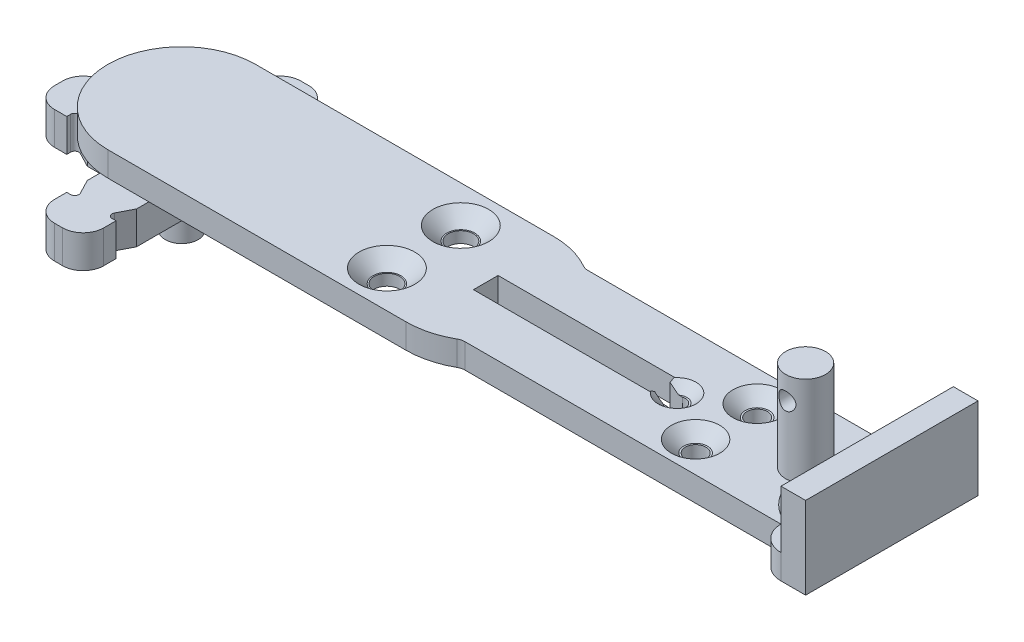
ISO-10303-21;
HEADER;
FILE_DESCRIPTION(('STEP AP214'),'2;1');
FILE_NAME('part.step','',(''),(''),'','','');
FILE_SCHEMA(('AUTOMOTIVE_DESIGN { 1 0 10303 214 1 1 1 1 }'));
ENDSEC;
DATA;
#1=APPLICATION_CONTEXT('core data for automotive mechanical design processes');
#2=APPLICATION_PROTOCOL_DEFINITION('international standard','automotive_design',2000,#1);
#3=PRODUCT_CONTEXT('',#1,'mechanical');
#4=PRODUCT('Part','Part','',(#3));
#5=PRODUCT_RELATED_PRODUCT_CATEGORY('part','',(#4));
#6=PRODUCT_DEFINITION_FORMATION('','',#4);
#7=PRODUCT_DEFINITION_CONTEXT('part definition',#1,'design');
#8=PRODUCT_DEFINITION('design','',#6,#7);
#9=PRODUCT_DEFINITION_SHAPE('','',#8);
#10=(LENGTH_UNIT() NAMED_UNIT(*) SI_UNIT(.MILLI.,.METRE.));
#11=(NAMED_UNIT(*) PLANE_ANGLE_UNIT() SI_UNIT($,.RADIAN.));
#12=(NAMED_UNIT(*) SI_UNIT($,.STERADIAN.) SOLID_ANGLE_UNIT());
#13=UNCERTAINTY_MEASURE_WITH_UNIT(LENGTH_MEASURE(1.E-05),#10,'distance_accuracy_value','');
#14=(GEOMETRIC_REPRESENTATION_CONTEXT(3) GLOBAL_UNCERTAINTY_ASSIGNED_CONTEXT((#13)) GLOBAL_UNIT_ASSIGNED_CONTEXT((#10,
#11,#12)) REPRESENTATION_CONTEXT('',''));
#15=CARTESIAN_POINT('',(0.,0.,0.));
#16=DIRECTION('',(0.,0.,1.));
#17=DIRECTION('',(1.,0.,0.));
#18=AXIS2_PLACEMENT_3D('',#15,#16,#17);
#19=CARTESIAN_POINT('',(0.,9.,0.));
#20=DIRECTION('',(0.,1.,0.));
#21=DIRECTION('',(0.,0.,1.));
#22=AXIS2_PLACEMENT_3D('',#19,#20,#21);
#23=PLANE('',#22);
#24=CARTESIAN_POINT('',(76.,9.,0.));
#25=DIRECTION('',(0.,1.,0.));
#26=DIRECTION('',(0.,0.,1.));
#27=AXIS2_PLACEMENT_3D('',#24,#25,#26);
#28=CIRCLE('',#27,2.425);
#29=CARTESIAN_POINT('',(76.,9.,2.425));
#30=VERTEX_POINT('',#29);
#31=EDGE_CURVE('E582',#30,#30,#28,.T.);
#32=ORIENTED_EDGE('',*,*,#31,.F.);
#33=EDGE_LOOP('',(#32));
#34=FACE_BOUND('',#33,.T.);
#35=CARTESIAN_POINT('',(60.35,9.,0.));
#36=DIRECTION('',(0.,1.,0.));
#37=DIRECTION('',(0.,0.,1.));
#38=AXIS2_PLACEMENT_3D('',#35,#36,#37);
#39=CIRCLE('',#38,2.3);
#40=CARTESIAN_POINT('',(58.5377501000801,9.,1.41624514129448));
#41=VERTEX_POINT('',#40);
#42=CARTESIAN_POINT('',(58.5377501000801,9.,-1.41624514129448));
#43=VERTEX_POINT('',#42);
#44=EDGE_CURVE('E611',#41,#43,#39,.T.);
#45=ORIENTED_EDGE('',*,*,#44,.F.);
#46=DIRECTION('',(0.,0.,1.));
#47=VECTOR('',#46,1.);
#48=CARTESIAN_POINT('',(58.5377501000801,9.,0.));
#49=LINE('',#48,#47);
#50=CARTESIAN_POINT('',(58.5377501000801,9.,1.5));
#51=VERTEX_POINT('',#50);
#52=EDGE_CURVE('E1062',#41,#51,#49,.T.);
#53=ORIENTED_EDGE('',*,*,#52,.T.);
#54=DIRECTION('',(1.,0.,0.));
#55=VECTOR('',#54,1.);
#56=CARTESIAN_POINT('',(0.,9.,1.5));
#57=LINE('',#56,#55);
#58=CARTESIAN_POINT('',(37.0377501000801,9.,1.5));
#59=VERTEX_POINT('',#58);
#60=EDGE_CURVE('E1078',#59,#51,#57,.T.);
#61=ORIENTED_EDGE('',*,*,#60,.F.);
#62=DIRECTION('',(0.,0.,1.));
#63=VECTOR('',#62,1.);
#64=CARTESIAN_POINT('',(37.0377501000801,9.,0.));
#65=LINE('',#64,#63);
#66=CARTESIAN_POINT('',(37.0377501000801,9.,-1.5));
#67=VERTEX_POINT('',#66);
#68=EDGE_CURVE('E1074',#67,#59,#65,.T.);
#69=ORIENTED_EDGE('',*,*,#68,.F.);
#70=DIRECTION('',(1.,0.,0.));
#71=VECTOR('',#70,1.);
#72=CARTESIAN_POINT('',(0.,9.,-1.5));
#73=LINE('',#72,#71);
#74=CARTESIAN_POINT('',(58.5377501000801,9.,-1.5));
#75=VERTEX_POINT('',#74);
#76=EDGE_CURVE('E1070',#67,#75,#73,.T.);
#77=ORIENTED_EDGE('',*,*,#76,.T.);
#78=DIRECTION('',(0.,0.,1.));
#79=VECTOR('',#78,1.);
#80=CARTESIAN_POINT('',(58.5377501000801,9.,0.));
#81=LINE('',#80,#79);
#82=EDGE_CURVE('E1066',#75,#43,#81,.T.);
#83=ORIENTED_EDGE('',*,*,#82,.T.);
#84=EDGE_LOOP('',(#45,#53,#61,#69,#77,#83));
#85=FACE_BOUND('',#84,.T.);
#86=CARTESIAN_POINT('',(66.35,9.,-3.75));
#87=DIRECTION('',(0.,1.,0.));
#88=DIRECTION('',(0.,0.,1.));
#89=AXIS2_PLACEMENT_3D('',#86,#87,#88);
#90=CIRCLE('',#89,2.94999999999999);
#91=CARTESIAN_POINT('',(66.35,9.,-0.800000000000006));
#92=VERTEX_POINT('',#91);
#93=EDGE_CURVE('E1760',#92,#92,#90,.T.);
#94=ORIENTED_EDGE('',*,*,#93,.F.);
#95=EDGE_LOOP('',(#94));
#96=FACE_BOUND('',#95,.T.);
#97=CARTESIAN_POINT('',(66.35,9.,3.75));
#98=DIRECTION('',(0.,1.,0.));
#99=DIRECTION('',(0.,0.,1.));
#100=AXIS2_PLACEMENT_3D('',#97,#98,#99);
#101=CIRCLE('',#100,2.94999999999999);
#102=CARTESIAN_POINT('',(66.35,9.,6.69999999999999));
#103=VERTEX_POINT('',#102);
#104=EDGE_CURVE('E1755',#103,#103,#101,.T.);
#105=ORIENTED_EDGE('',*,*,#104,.F.);
#106=EDGE_LOOP('',(#105));
#107=FACE_BOUND('',#106,.T.);
#108=CARTESIAN_POINT('',(29.5,9.,-4.5));
#109=DIRECTION('',(0.,1.,0.));
#110=DIRECTION('',(0.,0.,1.));
#111=AXIS2_PLACEMENT_3D('',#108,#109,#110);
#112=CIRCLE('',#111,3.4);
#113=CARTESIAN_POINT('',(29.5,9.,-1.1));
#114=VERTEX_POINT('',#113);
#115=EDGE_CURVE('E1115',#114,#114,#112,.T.);
#116=ORIENTED_EDGE('',*,*,#115,.F.);
#117=EDGE_LOOP('',(#116));
#118=FACE_BOUND('',#117,.T.);
#119=CARTESIAN_POINT('',(29.5,9.,4.5));
#120=DIRECTION('',(0.,1.,0.));
#121=DIRECTION('',(0.,0.,1.));
#122=AXIS2_PLACEMENT_3D('',#119,#120,#121);
#123=CIRCLE('',#122,3.4);
#124=CARTESIAN_POINT('',(29.5,9.,7.9));
#125=VERTEX_POINT('',#124);
#126=EDGE_CURVE('E1124',#125,#125,#123,.T.);
#127=ORIENTED_EDGE('',*,*,#126,.F.);
#128=EDGE_LOOP('',(#127));
#129=FACE_BOUND('',#128,.T.);
#130=DIRECTION('',(0.,0.,1.));
#131=VECTOR('',#130,1.);
#132=CARTESIAN_POINT('',(83.5,9.,-10.5));
#133=LINE('',#132,#131);
#134=CARTESIAN_POINT('',(83.5,9.,-10.5));
#135=VERTEX_POINT('',#134);
#136=CARTESIAN_POINT('',(83.5,9.,10.5));
#137=VERTEX_POINT('',#136);
#138=EDGE_CURVE('E566',#135,#137,#133,.T.);
#139=ORIENTED_EDGE('',*,*,#138,.F.);
#140=CARTESIAN_POINT('',(83.5,9.,-7.5));
#141=DIRECTION('',(0.,1.,0.));
#142=DIRECTION('',(0.,0.,1.));
#143=AXIS2_PLACEMENT_3D('',#140,#141,#142);
#144=CIRCLE('',#143,3.);
#145=CARTESIAN_POINT('',(80.5,9.,-7.5));
#146=VERTEX_POINT('',#145);
#147=EDGE_CURVE('E950',#135,#146,#144,.T.);
#148=ORIENTED_EDGE('',*,*,#147,.T.);
#149=DIRECTION('',(1.,0.,0.));
#150=VECTOR('',#149,1.);
#151=CARTESIAN_POINT('',(41.999,9.,-7.5));
#152=LINE('',#151,#150);
#153=CARTESIAN_POINT('',(41.999,9.,-7.5));
#154=VERTEX_POINT('',#153);
#155=EDGE_CURVE('E1022',#154,#146,#152,.T.);
#156=ORIENTED_EDGE('',*,*,#155,.F.);
#157=CARTESIAN_POINT('',(41.999,9.,-8.999));
#158=DIRECTION('',(0.,1.,0.));
#159=DIRECTION('',(0.,0.,1.));
#160=AXIS2_PLACEMENT_3D('',#157,#158,#159);
#161=CIRCLE('',#160,1.499);
#162=CARTESIAN_POINT('',(41.2587367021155,9.,-7.69553874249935));
#163=VERTEX_POINT('',#162);
#164=EDGE_CURVE('E1030',#163,#154,#161,.T.);
#165=ORIENTED_EDGE('',*,*,#164,.F.);
#166=CARTESIAN_POINT('',(36.3203557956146,9.,1.));
#167=DIRECTION('',(0.,1.,0.));
#168=DIRECTION('',(0.,0.,1.));
#169=AXIS2_PLACEMENT_3D('',#166,#167,#168);
#170=CIRCLE('',#169,10.);
#171=CARTESIAN_POINT('',(36.3203557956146,9.,-9.));
#172=VERTEX_POINT('',#171);
#173=EDGE_CURVE('E1734',#163,#172,#170,.T.);
#174=ORIENTED_EDGE('',*,*,#173,.T.);
#175=DIRECTION('',(1.,0.,0.));
#176=VECTOR('',#175,1.);
#177=CARTESIAN_POINT('',(0.,9.,-9.));
#178=LINE('',#177,#176);
#179=CARTESIAN_POINT('',(0.,9.,-9.));
#180=VERTEX_POINT('',#179);
#181=EDGE_CURVE('E1137',#180,#172,#178,.T.);
#182=ORIENTED_EDGE('',*,*,#181,.F.);
#183=CARTESIAN_POINT('',(0.,9.,0.));
#184=DIRECTION('',(0.,1.,0.));
#185=DIRECTION('',(0.,0.,1.));
#186=AXIS2_PLACEMENT_3D('',#183,#184,#185);
#187=CIRCLE('',#186,9.);
#188=CARTESIAN_POINT('',(0.,9.,9.));
#189=VERTEX_POINT('',#188);
#190=EDGE_CURVE('E1129',#180,#189,#187,.T.);
#191=ORIENTED_EDGE('',*,*,#190,.T.);
#192=DIRECTION('',(-1.,0.,0.));
#193=VECTOR('',#192,1.);
#194=CARTESIAN_POINT('',(0.,9.,9.));
#195=LINE('',#194,#193);
#196=CARTESIAN_POINT('',(36.3203557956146,9.,9.));
#197=VERTEX_POINT('',#196);
#198=EDGE_CURVE('E1133',#197,#189,#195,.T.);
#199=ORIENTED_EDGE('',*,*,#198,.F.);
#200=CARTESIAN_POINT('',(36.3203557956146,9.,-1.));
#201=DIRECTION('',(0.,1.,0.));
#202=DIRECTION('',(0.,0.,1.));
#203=AXIS2_PLACEMENT_3D('',#200,#201,#202);
#204=CIRCLE('',#203,10.);
#205=CARTESIAN_POINT('',(41.2587367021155,9.,7.69553874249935));
#206=VERTEX_POINT('',#205);
#207=EDGE_CURVE('E1731',#197,#206,#204,.T.);
#208=ORIENTED_EDGE('',*,*,#207,.T.);
#209=CARTESIAN_POINT('',(41.999,9.,8.999));
#210=DIRECTION('',(0.,1.,0.));
#211=DIRECTION('',(0.,0.,-1.));
#212=AXIS2_PLACEMENT_3D('',#209,#210,#211);
#213=CIRCLE('',#212,1.499);
#214=CARTESIAN_POINT('',(41.999,9.,7.5));
#215=VERTEX_POINT('',#214);
#216=EDGE_CURVE('E1043',#215,#206,#213,.T.);
#217=ORIENTED_EDGE('',*,*,#216,.F.);
#218=DIRECTION('',(-1.,0.,0.));
#219=VECTOR('',#218,1.);
#220=CARTESIAN_POINT('',(41.999,9.,7.5));
#221=LINE('',#220,#219);
#222=CARTESIAN_POINT('',(80.5,9.,7.5));
#223=VERTEX_POINT('',#222);
#224=EDGE_CURVE('E1036',#223,#215,#221,.T.);
#225=ORIENTED_EDGE('',*,*,#224,.F.);
#226=CARTESIAN_POINT('',(83.5,9.,7.5));
#227=DIRECTION('',(0.,1.,0.));
#228=DIRECTION('',(0.,0.,1.));
#229=AXIS2_PLACEMENT_3D('',#226,#227,#228);
#230=CIRCLE('',#229,3.);
#231=EDGE_CURVE('E1014',#223,#137,#230,.T.);
#232=ORIENTED_EDGE('',*,*,#231,.T.);
#233=EDGE_LOOP('',(#139,#148,#156,#165,#174,#182,#191,#199,#208,#217,#225,#232));
#234=FACE_BOUND('',#233,.T.);
#235=ADVANCED_FACE('F51',(#34,#85,#96,#107,#118,#129,#234),#23,.T.);
#236=CARTESIAN_POINT('',(0.,6.,0.));
#237=DIRECTION('',(0.,1.,0.));
#238=DIRECTION('',(0.,0.,1.));
#239=AXIS2_PLACEMENT_3D('',#236,#237,#238);
#240=PLANE('',#239);
#241=CARTESIAN_POINT('',(66.35,6.,3.75));
#242=DIRECTION('',(0.,1.,0.));
#243=DIRECTION('',(0.,0.,1.));
#244=AXIS2_PLACEMENT_3D('',#241,#242,#243);
#245=CIRCLE('',#244,1.24999999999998);
#246=CARTESIAN_POINT('',(66.35,6.,4.99999999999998));
#247=VERTEX_POINT('',#246);
#248=EDGE_CURVE('E1063',#247,#247,#245,.T.);
#249=ORIENTED_EDGE('',*,*,#248,.T.);
#250=EDGE_LOOP('',(#249));
#251=FACE_BOUND('',#250,.T.);
#252=CARTESIAN_POINT('',(66.35,6.,-3.75));
#253=DIRECTION('',(0.,1.,0.));
#254=DIRECTION('',(0.,0.,1.));
#255=AXIS2_PLACEMENT_3D('',#252,#253,#254);
#256=CIRCLE('',#255,1.24999999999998);
#257=CARTESIAN_POINT('',(66.35,6.,-2.50000000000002));
#258=VERTEX_POINT('',#257);
#259=EDGE_CURVE('E1057',#258,#258,#256,.T.);
#260=ORIENTED_EDGE('',*,*,#259,.T.);
#261=EDGE_LOOP('',(#260));
#262=FACE_BOUND('',#261,.T.);
#263=DIRECTION('',(1.,0.,0.));
#264=VECTOR('',#263,1.);
#265=CARTESIAN_POINT('',(0.,6.,-7.5));
#266=LINE('',#265,#264);
#267=CARTESIAN_POINT('',(41.999,6.,-7.5));
#268=VERTEX_POINT('',#267);
#269=CARTESIAN_POINT('',(80.5,6.,-7.5));
#270=VERTEX_POINT('',#269);
#271=EDGE_CURVE('E1054',#268,#270,#266,.T.);
#272=ORIENTED_EDGE('',*,*,#271,.T.);
#273=CARTESIAN_POINT('',(83.5,6.,-7.5));
#274=DIRECTION('',(0.,1.,0.));
#275=DIRECTION('',(0.,0.,1.));
#276=AXIS2_PLACEMENT_3D('',#273,#274,#275);
#277=CIRCLE('',#276,3.);
#278=CARTESIAN_POINT('',(83.5,6.,-10.5));
#279=VERTEX_POINT('',#278);
#280=EDGE_CURVE('E66',#270,#279,#277,.F.);
#281=ORIENTED_EDGE('',*,*,#280,.T.);
#282=DIRECTION('',(-1.,0.,0.));
#283=VECTOR('',#282,1.);
#284=CARTESIAN_POINT('',(80.5,6.,-10.5));
#285=LINE('',#284,#283);
#286=CARTESIAN_POINT('',(86.5,6.,-10.5));
#287=VERTEX_POINT('',#286);
#288=EDGE_CURVE('E595',#287,#279,#285,.T.);
#289=ORIENTED_EDGE('',*,*,#288,.F.);
#290=DIRECTION('',(0.,0.,-1.));
#291=VECTOR('',#290,1.);
#292=CARTESIAN_POINT('',(86.5,6.,-10.5));
#293=LINE('',#292,#291);
#294=CARTESIAN_POINT('',(86.5,6.,10.5));
#295=VERTEX_POINT('',#294);
#296=EDGE_CURVE('E544',#295,#287,#293,.T.);
#297=ORIENTED_EDGE('',*,*,#296,.F.);
#298=DIRECTION('',(1.,0.,0.));
#299=VECTOR('',#298,1.);
#300=CARTESIAN_POINT('',(86.5,6.,10.5));
#301=LINE('',#300,#299);
#302=CARTESIAN_POINT('',(83.5,6.,10.5));
#303=VERTEX_POINT('',#302);
#304=EDGE_CURVE('E587',#303,#295,#301,.T.);
#305=ORIENTED_EDGE('',*,*,#304,.F.);
#306=CARTESIAN_POINT('',(83.5,6.,7.5));
#307=DIRECTION('',(0.,1.,0.));
#308=DIRECTION('',(0.,0.,1.));
#309=AXIS2_PLACEMENT_3D('',#306,#307,#308);
#310=CIRCLE('',#309,3.);
#311=CARTESIAN_POINT('',(80.5,6.,7.5));
#312=VERTEX_POINT('',#311);
#313=EDGE_CURVE('E947',#303,#312,#310,.F.);
#314=ORIENTED_EDGE('',*,*,#313,.T.);
#315=DIRECTION('',(-1.,0.,0.));
#316=VECTOR('',#315,1.);
#317=CARTESIAN_POINT('',(0.,6.,7.5));
#318=LINE('',#317,#316);
#319=CARTESIAN_POINT('',(41.999,6.,7.5));
#320=VERTEX_POINT('',#319);
#321=EDGE_CURVE('E1034',#312,#320,#318,.T.);
#322=ORIENTED_EDGE('',*,*,#321,.T.);
#323=CARTESIAN_POINT('',(41.999,6.,8.999));
#324=DIRECTION('',(0.,1.,0.));
#325=DIRECTION('',(0.,0.,1.));
#326=AXIS2_PLACEMENT_3D('',#323,#324,#325);
#327=CIRCLE('',#326,1.499);
#328=CARTESIAN_POINT('',(41.2587367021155,6.,7.69553874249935));
#329=VERTEX_POINT('',#328);
#330=EDGE_CURVE('E1714',#320,#329,#327,.T.);
#331=ORIENTED_EDGE('',*,*,#330,.T.);
#332=CARTESIAN_POINT('',(36.3203557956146,6.,-1.));
#333=DIRECTION('',(0.,1.,0.));
#334=DIRECTION('',(0.,0.,1.));
#335=AXIS2_PLACEMENT_3D('',#332,#333,#334);
#336=CIRCLE('',#335,10.);
#337=CARTESIAN_POINT('',(36.3203557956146,6.,9.));
#338=VERTEX_POINT('',#337);
#339=EDGE_CURVE('E1740',#329,#338,#336,.F.);
#340=ORIENTED_EDGE('',*,*,#339,.T.);
#341=DIRECTION('',(-1.,0.,0.));
#342=VECTOR('',#341,1.);
#343=CARTESIAN_POINT('',(0.,6.,9.));
#344=LINE('',#343,#342);
#345=CARTESIAN_POINT('',(0.,6.,9.));
#346=VERTEX_POINT('',#345);
#347=EDGE_CURVE('E1146',#338,#346,#344,.T.);
#348=ORIENTED_EDGE('',*,*,#347,.T.);
#349=CARTESIAN_POINT('',(0.,6.,0.));
#350=DIRECTION('',(0.,1.,0.));
#351=DIRECTION('',(0.,0.,1.));
#352=AXIS2_PLACEMENT_3D('',#349,#350,#351);
#353=CIRCLE('',#352,9.);
#354=CARTESIAN_POINT('',(0.,6.,-9.));
#355=VERTEX_POINT('',#354);
#356=EDGE_CURVE('E1142',#355,#346,#353,.T.);
#357=ORIENTED_EDGE('',*,*,#356,.F.);
#358=DIRECTION('',(1.,0.,0.));
#359=VECTOR('',#358,1.);
#360=CARTESIAN_POINT('',(0.,6.,-9.));
#361=LINE('',#360,#359);
#362=CARTESIAN_POINT('',(36.3203557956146,6.,-9.));
#363=VERTEX_POINT('',#362);
#364=EDGE_CURVE('E1134',#355,#363,#361,.T.);
#365=ORIENTED_EDGE('',*,*,#364,.T.);
#366=CARTESIAN_POINT('',(36.3203557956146,6.,1.));
#367=DIRECTION('',(0.,1.,0.));
#368=DIRECTION('',(0.,0.,1.));
#369=AXIS2_PLACEMENT_3D('',#366,#367,#368);
#370=CIRCLE('',#369,10.);
#371=CARTESIAN_POINT('',(41.2587367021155,6.,-7.69553874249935));
#372=VERTEX_POINT('',#371);
#373=EDGE_CURVE('E1743',#363,#372,#370,.F.);
#374=ORIENTED_EDGE('',*,*,#373,.T.);
#375=CARTESIAN_POINT('',(41.999,6.,-8.999));
#376=DIRECTION('',(0.,1.,0.));
#377=DIRECTION('',(0.,0.,1.));
#378=AXIS2_PLACEMENT_3D('',#375,#376,#377);
#379=CIRCLE('',#378,1.499);
#380=EDGE_CURVE('E1718',#372,#268,#379,.T.);
#381=ORIENTED_EDGE('',*,*,#380,.T.);
#382=EDGE_LOOP('',(#272,#281,#289,#297,#305,#314,#322,#331,#340,#348,#357,#365,#374,#381));
#383=FACE_BOUND('',#382,.T.);
#384=CARTESIAN_POINT('',(0.,6.,0.));
#385=DIRECTION('',(0.,1.,0.));
#386=DIRECTION('',(0.,0.,1.));
#387=AXIS2_PLACEMENT_3D('',#384,#385,#386);
#388=CIRCLE('',#387,4.24264068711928);
#389=CARTESIAN_POINT('',(0.,6.,4.24264068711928));
#390=VERTEX_POINT('',#389);
#391=EDGE_CURVE('E1160',#390,#390,#388,.T.);
#392=ORIENTED_EDGE('',*,*,#391,.T.);
#393=EDGE_LOOP('',(#392));
#394=FACE_BOUND('',#393,.T.);
#395=CARTESIAN_POINT('',(29.5,6.,4.5));
#396=DIRECTION('',(0.,1.,0.));
#397=DIRECTION('',(0.,0.,1.));
#398=AXIS2_PLACEMENT_3D('',#395,#396,#397);
#399=CIRCLE('',#398,1.55);
#400=CARTESIAN_POINT('',(29.5,6.,6.05));
#401=VERTEX_POINT('',#400);
#402=EDGE_CURVE('E1670',#401,#401,#399,.T.);
#403=ORIENTED_EDGE('',*,*,#402,.T.);
#404=EDGE_LOOP('',(#403));
#405=FACE_BOUND('',#404,.T.);
#406=CARTESIAN_POINT('',(29.5,6.,-4.5));
#407=DIRECTION('',(0.,1.,0.));
#408=DIRECTION('',(0.,0.,1.));
#409=AXIS2_PLACEMENT_3D('',#406,#407,#408);
#410=CIRCLE('',#409,1.55);
#411=CARTESIAN_POINT('',(29.5,6.,-2.95));
#412=VERTEX_POINT('',#411);
#413=EDGE_CURVE('E1147',#412,#412,#410,.T.);
#414=ORIENTED_EDGE('',*,*,#413,.T.);
#415=EDGE_LOOP('',(#414));
#416=FACE_BOUND('',#415,.T.);
#417=DIRECTION('',(1.,0.,0.));
#418=VECTOR('',#417,1.);
#419=CARTESIAN_POINT('',(0.,6.,-0.95));
#420=LINE('',#419,#418);
#421=CARTESIAN_POINT('',(58.5377501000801,6.,-0.95));
#422=VERTEX_POINT('',#421);
#423=CARTESIAN_POINT('',(60.0377501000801,6.,-0.95));
#424=VERTEX_POINT('',#423);
#425=EDGE_CURVE('E1107',#422,#424,#420,.T.);
#426=ORIENTED_EDGE('',*,*,#425,.F.);
#427=DIRECTION('',(0.,0.,1.));
#428=VECTOR('',#427,1.);
#429=CARTESIAN_POINT('',(58.5377501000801,6.,0.));
#430=LINE('',#429,#428);
#431=CARTESIAN_POINT('',(58.5377501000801,6.,-1.5));
#432=VERTEX_POINT('',#431);
#433=EDGE_CURVE('E1707',#432,#422,#430,.T.);
#434=ORIENTED_EDGE('',*,*,#433,.F.);
#435=DIRECTION('',(1.,0.,0.));
#436=VECTOR('',#435,1.);
#437=CARTESIAN_POINT('',(0.,6.,-1.5));
#438=LINE('',#437,#436);
#439=CARTESIAN_POINT('',(37.0377501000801,6.,-1.5));
#440=VERTEX_POINT('',#439);
#441=EDGE_CURVE('E1704',#440,#432,#438,.T.);
#442=ORIENTED_EDGE('',*,*,#441,.F.);
#443=DIRECTION('',(0.,0.,1.));
#444=VECTOR('',#443,1.);
#445=CARTESIAN_POINT('',(37.0377501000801,6.,0.));
#446=LINE('',#445,#444);
#447=CARTESIAN_POINT('',(37.0377501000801,6.,1.5));
#448=VERTEX_POINT('',#447);
#449=EDGE_CURVE('E1700',#440,#448,#446,.T.);
#450=ORIENTED_EDGE('',*,*,#449,.T.);
#451=DIRECTION('',(1.,0.,0.));
#452=VECTOR('',#451,1.);
#453=CARTESIAN_POINT('',(0.,6.,1.5));
#454=LINE('',#453,#452);
#455=CARTESIAN_POINT('',(58.5377501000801,6.,1.5));
#456=VERTEX_POINT('',#455);
#457=EDGE_CURVE('E1696',#448,#456,#454,.T.);
#458=ORIENTED_EDGE('',*,*,#457,.T.);
#459=DIRECTION('',(0.,0.,1.));
#460=VECTOR('',#459,1.);
#461=CARTESIAN_POINT('',(58.5377501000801,6.,0.));
#462=LINE('',#461,#460);
#463=CARTESIAN_POINT('',(58.5377501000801,6.,0.95));
#464=VERTEX_POINT('',#463);
#465=EDGE_CURVE('E1693',#464,#456,#462,.T.);
#466=ORIENTED_EDGE('',*,*,#465,.F.);
#467=DIRECTION('',(1.,0.,0.));
#468=VECTOR('',#467,1.);
#469=CARTESIAN_POINT('',(0.,6.,0.95));
#470=LINE('',#469,#468);
#471=CARTESIAN_POINT('',(60.0377501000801,6.,0.95));
#472=VERTEX_POINT('',#471);
#473=EDGE_CURVE('E1087',#464,#472,#470,.T.);
#474=ORIENTED_EDGE('',*,*,#473,.T.);
#475=CARTESIAN_POINT('',(60.35,6.,0.));
#476=DIRECTION('',(0.,1.,0.));
#477=DIRECTION('',(0.,0.,1.));
#478=AXIS2_PLACEMENT_3D('',#475,#476,#477);
#479=CIRCLE('',#478,0.999999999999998);
#480=EDGE_CURVE('E1110',#472,#424,#479,.T.);
#481=ORIENTED_EDGE('',*,*,#480,.T.);
#482=EDGE_LOOP('',(#426,#434,#442,#450,#458,#466,#474,#481));
#483=FACE_BOUND('',#482,.T.);
#484=ADVANCED_FACE('F690',(#251,#262,#383,#394,#405,#416,#483),#240,.F.);
#485=CARTESIAN_POINT('',(60.35,-0.999999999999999,0.));
#486=DIRECTION('',(0.,1.,0.));
#487=DIRECTION('',(0.,0.,1.));
#488=AXIS2_PLACEMENT_3D('',#485,#486,#487);
#489=CYLINDRICAL_SURFACE('',#488,0.999999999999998);
#490=DIRECTION('',(0.,1.,0.));
#491=VECTOR('',#490,1.);
#492=CARTESIAN_POINT('',(60.0377501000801,-0.999999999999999,0.95));
#493=LINE('',#492,#491);
#494=CARTESIAN_POINT('',(60.0377501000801,7.93774234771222,0.95));
#495=VERTEX_POINT('',#494);
#496=EDGE_CURVE('E1669',#472,#495,#493,.T.);
#497=ORIENTED_EDGE('',*,*,#496,.T.);
#498=CARTESIAN_POINT('',(60.35,7.93774234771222,0.));
#499=DIRECTION('',(0.,-1.,0.));
#500=DIRECTION('',(0.,0.,-1.));
#501=AXIS2_PLACEMENT_3D('',#498,#499,#500);
#502=CIRCLE('',#501,0.999999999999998);
#503=CARTESIAN_POINT('',(60.0377501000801,7.93774234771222,-0.949999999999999));
#504=VERTEX_POINT('',#503);
#505=EDGE_CURVE('E664',#495,#504,#502,.F.);
#506=ORIENTED_EDGE('',*,*,#505,.T.);
#507=DIRECTION('',(0.,1.,0.));
#508=VECTOR('',#507,1.);
#509=CARTESIAN_POINT('',(60.0377501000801,-0.999999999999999,-0.95));
#510=LINE('',#509,#508);
#511=EDGE_CURVE('E1689',#424,#504,#510,.T.);
#512=ORIENTED_EDGE('',*,*,#511,.F.);
#513=ORIENTED_EDGE('',*,*,#480,.F.);
#514=EDGE_LOOP('',(#497,#506,#512,#513));
#515=FACE_BOUND('',#514,.T.);
#516=ADVANCED_FACE('F697',(#515),#489,.F.);
#517=CARTESIAN_POINT('',(0.,4.,0.));
#518=DIRECTION('',(0.,1.,0.));
#519=DIRECTION('',(0.,0.,1.));
#520=AXIS2_PLACEMENT_3D('',#517,#518,#519);
#521=PLANE('',#520);
#522=DIRECTION('',(1.,0.,0.));
#523=VECTOR('',#522,1.);
#524=CARTESIAN_POINT('',(0.,4.,3.));
#525=LINE('',#524,#523);
#526=CARTESIAN_POINT('',(-8.5,4.,3.));
#527=VERTEX_POINT('',#526);
#528=CARTESIAN_POINT('',(-3.,4.,3.));
#529=VERTEX_POINT('',#528);
#530=EDGE_CURVE('E1224',#527,#529,#525,.T.);
#531=ORIENTED_EDGE('',*,*,#530,.T.);
#532=CARTESIAN_POINT('',(0.,4.,0.));
#533=DIRECTION('',(0.,1.,0.));
#534=DIRECTION('',(0.,0.,1.));
#535=AXIS2_PLACEMENT_3D('',#532,#533,#534);
#536=CIRCLE('',#535,4.24264068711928);
#537=CARTESIAN_POINT('',(-3.,4.,-3.));
#538=VERTEX_POINT('',#537);
#539=EDGE_CURVE('E2669',#538,#529,#536,.T.);
#540=ORIENTED_EDGE('',*,*,#539,.F.);
#541=DIRECTION('',(-1.,0.,0.));
#542=VECTOR('',#541,1.);
#543=CARTESIAN_POINT('',(0.,4.,-3.));
#544=LINE('',#543,#542);
#545=CARTESIAN_POINT('',(-8.49999999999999,4.,-3.));
#546=VERTEX_POINT('',#545);
#547=EDGE_CURVE('E1200',#538,#546,#544,.T.);
#548=ORIENTED_EDGE('',*,*,#547,.T.);
#549=DIRECTION('',(0.887216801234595,0.,-0.461352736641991));
#550=VECTOR('',#549,1.);
#551=CARTESIAN_POINT('',(-3.03715365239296,4.,-5.84068010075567));
#552=LINE('',#551,#550);
#553=CARTESIAN_POINT('',(-10.269323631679,4.,-2.07995171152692));
#554=VERTEX_POINT('',#553);
#555=EDGE_CURVE('E1203',#554,#546,#552,.T.);
#556=ORIENTED_EDGE('',*,*,#555,.F.);
#557=CARTESIAN_POINT('',(-10.5,4.,-2.52356011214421));
#558=DIRECTION('',(0.,1.,0.));
#559=DIRECTION('',(0.,0.,1.));
#560=AXIS2_PLACEMENT_3D('',#557,#558,#559);
#561=CIRCLE('',#560,0.500000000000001);
#562=CARTESIAN_POINT('',(-11.,4.,-2.52356011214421));
#563=VERTEX_POINT('',#562);
#564=EDGE_CURVE('E1208',#563,#554,#561,.T.);
#565=ORIENTED_EDGE('',*,*,#564,.F.);
#566=DIRECTION('',(0.,0.,1.));
#567=VECTOR('',#566,1.);
#568=CARTESIAN_POINT('',(-11.,4.,0.));
#569=LINE('',#568,#567);
#570=CARTESIAN_POINT('',(-11.,4.,-3.));
#571=VERTEX_POINT('',#570);
#572=EDGE_CURVE('E1212',#571,#563,#569,.T.);
#573=ORIENTED_EDGE('',*,*,#572,.F.);
#574=CARTESIAN_POINT('',(-12.5,4.,-3.));
#575=VERTEX_POINT('',#574);
#576=EDGE_CURVE('E1204',#571,#575,#544,.T.);
#577=ORIENTED_EDGE('',*,*,#576,.T.);
#578=CARTESIAN_POINT('',(-12.5,4.,-0.5));
#579=DIRECTION('',(0.,1.,0.));
#580=DIRECTION('',(0.,0.,1.));
#581=AXIS2_PLACEMENT_3D('',#578,#579,#580);
#582=CIRCLE('',#581,2.5);
#583=CARTESIAN_POINT('',(-15.,4.,-0.5));
#584=VERTEX_POINT('',#583);
#585=EDGE_CURVE('E1606',#575,#584,#582,.T.);
#586=ORIENTED_EDGE('',*,*,#585,.T.);
#587=DIRECTION('',(0.,0.,1.));
#588=VECTOR('',#587,1.);
#589=CARTESIAN_POINT('',(-15.,4.,0.));
#590=LINE('',#589,#588);
#591=CARTESIAN_POINT('',(-15.,4.,0.5));
#592=VERTEX_POINT('',#591);
#593=EDGE_CURVE('E1216',#584,#592,#590,.T.);
#594=ORIENTED_EDGE('',*,*,#593,.T.);
#595=CARTESIAN_POINT('',(-12.5,4.,0.5));
#596=DIRECTION('',(0.,1.,0.));
#597=DIRECTION('',(0.,0.,1.));
#598=AXIS2_PLACEMENT_3D('',#595,#596,#597);
#599=CIRCLE('',#598,2.5);
#600=CARTESIAN_POINT('',(-12.5,4.,3.));
#601=VERTEX_POINT('',#600);
#602=EDGE_CURVE('E1609',#592,#601,#599,.T.);
#603=ORIENTED_EDGE('',*,*,#602,.T.);
#604=CARTESIAN_POINT('',(-11.,4.,3.));
#605=VERTEX_POINT('',#604);
#606=EDGE_CURVE('E1220',#601,#605,#525,.T.);
#607=ORIENTED_EDGE('',*,*,#606,.T.);
#608=DIRECTION('',(0.,0.,-1.));
#609=VECTOR('',#608,1.);
#610=CARTESIAN_POINT('',(-11.,4.,0.));
#611=LINE('',#610,#609);
#612=CARTESIAN_POINT('',(-11.,4.,2.52356011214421));
#613=VERTEX_POINT('',#612);
#614=EDGE_CURVE('E1223',#605,#613,#611,.T.);
#615=ORIENTED_EDGE('',*,*,#614,.T.);
#616=CARTESIAN_POINT('',(-10.5,4.,2.52356011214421));
#617=DIRECTION('',(0.,1.,0.));
#618=DIRECTION('',(0.,0.,1.));
#619=AXIS2_PLACEMENT_3D('',#616,#617,#618);
#620=CIRCLE('',#619,0.500000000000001);
#621=CARTESIAN_POINT('',(-10.269323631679,4.,2.07995171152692));
#622=VERTEX_POINT('',#621);
#623=EDGE_CURVE('E1227',#613,#622,#620,.F.);
#624=ORIENTED_EDGE('',*,*,#623,.T.);
#625=DIRECTION('',(0.887216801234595,0.,0.461352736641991));
#626=VECTOR('',#625,1.);
#627=CARTESIAN_POINT('',(-3.03715365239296,4.,5.84068010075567));
#628=LINE('',#627,#626);
#629=EDGE_CURVE('E1230',#622,#527,#628,.T.);
#630=ORIENTED_EDGE('',*,*,#629,.T.);
#631=EDGE_LOOP('',(#531,#540,#548,#556,#565,#573,#577,#586,#594,#603,#607,#615,#624,#630));
#632=FACE_BOUND('',#631,.T.);
#633=ADVANCED_FACE('F729',(#632),#521,.T.);
#634=DIRECTION('',(0.,0.,1.));
#635=VECTOR('',#634,1.);
#636=CARTESIAN_POINT('',(-3.,4.,0.));
#637=LINE('',#636,#635);
#638=CARTESIAN_POINT('',(-3.,4.,-8.5));
#639=VERTEX_POINT('',#638);
#640=EDGE_CURVE('E1191',#639,#538,#637,.T.);
#641=ORIENTED_EDGE('',*,*,#640,.T.);
#642=CARTESIAN_POINT('',(3.00000000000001,4.,-2.99999999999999));
#643=VERTEX_POINT('',#642);
#644=EDGE_CURVE('E1168',#643,#538,#536,.T.);
#645=ORIENTED_EDGE('',*,*,#644,.F.);
#646=DIRECTION('',(0.,0.,-1.));
#647=VECTOR('',#646,1.);
#648=CARTESIAN_POINT('',(3.00000000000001,4.,0.));
#649=LINE('',#648,#647);
#650=CARTESIAN_POINT('',(3.00000000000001,4.,-8.49999999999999));
#651=VERTEX_POINT('',#650);
#652=EDGE_CURVE('E1183',#643,#651,#649,.T.);
#653=ORIENTED_EDGE('',*,*,#652,.T.);
#654=DIRECTION('',(0.46135273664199,0.,0.887216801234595));
#655=VECTOR('',#654,1.);
#656=CARTESIAN_POINT('',(5.84068010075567,4.,-3.03715365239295));
#657=LINE('',#656,#655);
#658=CARTESIAN_POINT('',(2.07995171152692,4.,-10.269323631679));
#659=VERTEX_POINT('',#658);
#660=EDGE_CURVE('E1299',#659,#651,#657,.T.);
#661=ORIENTED_EDGE('',*,*,#660,.F.);
#662=CARTESIAN_POINT('',(2.52356011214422,4.,-10.5));
#663=DIRECTION('',(0.,1.,0.));
#664=DIRECTION('',(0.,0.,1.));
#665=AXIS2_PLACEMENT_3D('',#662,#663,#664);
#666=CIRCLE('',#665,0.500000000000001);
#667=CARTESIAN_POINT('',(2.52356011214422,4.,-11.));
#668=VERTEX_POINT('',#667);
#669=EDGE_CURVE('E1169',#668,#659,#666,.T.);
#670=ORIENTED_EDGE('',*,*,#669,.F.);
#671=DIRECTION('',(-1.,0.,0.));
#672=VECTOR('',#671,1.);
#673=CARTESIAN_POINT('',(0.,4.,-11.));
#674=LINE('',#673,#672);
#675=CARTESIAN_POINT('',(3.00000000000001,4.,-11.));
#676=VERTEX_POINT('',#675);
#677=EDGE_CURVE('E1173',#676,#668,#674,.T.);
#678=ORIENTED_EDGE('',*,*,#677,.F.);
#679=CARTESIAN_POINT('',(3.00000000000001,4.,-12.5));
#680=VERTEX_POINT('',#679);
#681=EDGE_CURVE('E1178',#676,#680,#649,.T.);
#682=ORIENTED_EDGE('',*,*,#681,.T.);
#683=CARTESIAN_POINT('',(0.500000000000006,4.,-12.5));
#684=DIRECTION('',(0.,1.,0.));
#685=DIRECTION('',(0.,0.,1.));
#686=AXIS2_PLACEMENT_3D('',#683,#684,#685);
#687=CIRCLE('',#686,2.5);
#688=CARTESIAN_POINT('',(0.500000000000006,4.,-15.));
#689=VERTEX_POINT('',#688);
#690=EDGE_CURVE('E1600',#680,#689,#687,.T.);
#691=ORIENTED_EDGE('',*,*,#690,.T.);
#692=DIRECTION('',(-1.,0.,0.));
#693=VECTOR('',#692,1.);
#694=CARTESIAN_POINT('',(0.,4.,-15.));
#695=LINE('',#694,#693);
#696=CARTESIAN_POINT('',(-0.499999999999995,4.,-15.));
#697=VERTEX_POINT('',#696);
#698=EDGE_CURVE('E1182',#689,#697,#695,.T.);
#699=ORIENTED_EDGE('',*,*,#698,.T.);
#700=CARTESIAN_POINT('',(-0.499999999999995,4.,-12.5));
#701=DIRECTION('',(0.,1.,0.));
#702=DIRECTION('',(0.,0.,1.));
#703=AXIS2_PLACEMENT_3D('',#700,#701,#702);
#704=CIRCLE('',#703,2.5);
#705=CARTESIAN_POINT('',(-2.99999999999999,4.,-12.5));
#706=VERTEX_POINT('',#705);
#707=EDGE_CURVE('E1603',#697,#706,#704,.T.);
#708=ORIENTED_EDGE('',*,*,#707,.T.);
#709=CARTESIAN_POINT('',(-3.,4.,-11.));
#710=VERTEX_POINT('',#709);
#711=EDGE_CURVE('E1187',#706,#710,#637,.T.);
#712=ORIENTED_EDGE('',*,*,#711,.T.);
#713=DIRECTION('',(1.,0.,0.));
#714=VECTOR('',#713,1.);
#715=CARTESIAN_POINT('',(0.,4.,-11.));
#716=LINE('',#715,#714);
#717=CARTESIAN_POINT('',(-2.52356011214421,4.,-11.));
#718=VERTEX_POINT('',#717);
#719=EDGE_CURVE('E1190',#710,#718,#716,.T.);
#720=ORIENTED_EDGE('',*,*,#719,.T.);
#721=CARTESIAN_POINT('',(-2.52356011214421,4.,-10.5));
#722=DIRECTION('',(0.,1.,0.));
#723=DIRECTION('',(0.,0.,1.));
#724=AXIS2_PLACEMENT_3D('',#721,#722,#723);
#725=CIRCLE('',#724,0.500000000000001);
#726=CARTESIAN_POINT('',(-2.07995171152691,4.,-10.269323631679));
#727=VERTEX_POINT('',#726);
#728=EDGE_CURVE('E1194',#718,#727,#725,.F.);
#729=ORIENTED_EDGE('',*,*,#728,.T.);
#730=DIRECTION('',(-0.461352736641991,0.,0.887216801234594));
#731=VECTOR('',#730,1.);
#732=CARTESIAN_POINT('',(-5.84068010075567,4.,-3.03715365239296));
#733=LINE('',#732,#731);
#734=EDGE_CURVE('E1197',#727,#639,#733,.T.);
#735=ORIENTED_EDGE('',*,*,#734,.T.);
#736=EDGE_LOOP('',(#641,#645,#653,#661,#670,#678,#682,#691,#699,#708,#712,#720,#729,#735));
#737=FACE_BOUND('',#736,.T.);
#738=ADVANCED_FACE('F2225',(#737),#521,.T.);
#739=DIRECTION('',(-1.,0.,0.));
#740=VECTOR('',#739,1.);
#741=CARTESIAN_POINT('',(0.,4.,-3.));
#742=LINE('',#741,#740);
#743=CARTESIAN_POINT('',(8.49999999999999,4.,-3.));
#744=VERTEX_POINT('',#743);
#745=EDGE_CURVE('E1290',#744,#643,#742,.T.);
#746=ORIENTED_EDGE('',*,*,#745,.T.);
#747=CARTESIAN_POINT('',(3.,4.,3.));
#748=VERTEX_POINT('',#747);
#749=EDGE_CURVE('E1165',#748,#643,#536,.T.);
#750=ORIENTED_EDGE('',*,*,#749,.F.);
#751=DIRECTION('',(1.,0.,0.));
#752=VECTOR('',#751,1.);
#753=CARTESIAN_POINT('',(0.,4.,3.));
#754=LINE('',#753,#752);
#755=CARTESIAN_POINT('',(8.5,4.,3.));
#756=VERTEX_POINT('',#755);
#757=EDGE_CURVE('E1266',#748,#756,#754,.T.);
#758=ORIENTED_EDGE('',*,*,#757,.T.);
#759=DIRECTION('',(-0.887216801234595,0.,0.461352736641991));
#760=VECTOR('',#759,1.);
#761=CARTESIAN_POINT('',(3.03715365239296,4.,5.84068010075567));
#762=LINE('',#761,#760);
#763=CARTESIAN_POINT('',(10.269323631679,4.,2.07995171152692));
#764=VERTEX_POINT('',#763);
#765=EDGE_CURVE('E1269',#764,#756,#762,.T.);
#766=ORIENTED_EDGE('',*,*,#765,.F.);
#767=CARTESIAN_POINT('',(10.5,4.,2.52356011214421));
#768=DIRECTION('',(0.,1.,0.));
#769=DIRECTION('',(0.,0.,1.));
#770=AXIS2_PLACEMENT_3D('',#767,#768,#769);
#771=CIRCLE('',#770,0.500000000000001);
#772=CARTESIAN_POINT('',(11.,4.,2.52356011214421));
#773=VERTEX_POINT('',#772);
#774=EDGE_CURVE('E1274',#773,#764,#771,.T.);
#775=ORIENTED_EDGE('',*,*,#774,.F.);
#776=DIRECTION('',(0.,0.,-1.));
#777=VECTOR('',#776,1.);
#778=CARTESIAN_POINT('',(11.,4.,0.));
#779=LINE('',#778,#777);
#780=CARTESIAN_POINT('',(11.,4.,3.));
#781=VERTEX_POINT('',#780);
#782=EDGE_CURVE('E1278',#781,#773,#779,.T.);
#783=ORIENTED_EDGE('',*,*,#782,.F.);
#784=CARTESIAN_POINT('',(12.5,4.,3.));
#785=VERTEX_POINT('',#784);
#786=EDGE_CURVE('E1270',#781,#785,#754,.T.);
#787=ORIENTED_EDGE('',*,*,#786,.T.);
#788=CARTESIAN_POINT('',(12.5,4.,0.499999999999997));
#789=DIRECTION('',(0.,1.,0.));
#790=DIRECTION('',(0.,0.,1.));
#791=AXIS2_PLACEMENT_3D('',#788,#789,#790);
#792=CIRCLE('',#791,2.5);
#793=CARTESIAN_POINT('',(15.,4.,0.499999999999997));
#794=VERTEX_POINT('',#793);
#795=EDGE_CURVE('E1618',#785,#794,#792,.T.);
#796=ORIENTED_EDGE('',*,*,#795,.T.);
#797=DIRECTION('',(0.,0.,-1.));
#798=VECTOR('',#797,1.);
#799=CARTESIAN_POINT('',(15.,4.,0.));
#800=LINE('',#799,#798);
#801=CARTESIAN_POINT('',(15.,4.,-0.500000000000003));
#802=VERTEX_POINT('',#801);
#803=EDGE_CURVE('E1282',#794,#802,#800,.T.);
#804=ORIENTED_EDGE('',*,*,#803,.T.);
#805=CARTESIAN_POINT('',(12.5,4.,-0.500000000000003));
#806=DIRECTION('',(0.,1.,0.));
#807=DIRECTION('',(0.,0.,1.));
#808=AXIS2_PLACEMENT_3D('',#805,#806,#807);
#809=CIRCLE('',#808,2.5);
#810=CARTESIAN_POINT('',(12.5,4.,-3.));
#811=VERTEX_POINT('',#810);
#812=EDGE_CURVE('E1621',#802,#811,#809,.T.);
#813=ORIENTED_EDGE('',*,*,#812,.T.);
#814=CARTESIAN_POINT('',(11.,4.,-3.));
#815=VERTEX_POINT('',#814);
#816=EDGE_CURVE('E1286',#811,#815,#742,.T.);
#817=ORIENTED_EDGE('',*,*,#816,.T.);
#818=DIRECTION('',(0.,0.,1.));
#819=VECTOR('',#818,1.);
#820=CARTESIAN_POINT('',(11.,4.,0.));
#821=LINE('',#820,#819);
#822=CARTESIAN_POINT('',(11.,4.,-2.52356011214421));
#823=VERTEX_POINT('',#822);
#824=EDGE_CURVE('E1289',#815,#823,#821,.T.);
#825=ORIENTED_EDGE('',*,*,#824,.T.);
#826=CARTESIAN_POINT('',(10.5,4.,-2.52356011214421));
#827=DIRECTION('',(0.,1.,0.));
#828=DIRECTION('',(0.,0.,1.));
#829=AXIS2_PLACEMENT_3D('',#826,#827,#828);
#830=CIRCLE('',#829,0.500000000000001);
#831=CARTESIAN_POINT('',(10.269323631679,4.,-2.07995171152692));
#832=VERTEX_POINT('',#831);
#833=EDGE_CURVE('E1293',#823,#832,#830,.F.);
#834=ORIENTED_EDGE('',*,*,#833,.T.);
#835=DIRECTION('',(-0.887216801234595,0.,-0.461352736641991));
#836=VECTOR('',#835,1.);
#837=CARTESIAN_POINT('',(3.03715365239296,4.,-5.84068010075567));
#838=LINE('',#837,#836);
#839=EDGE_CURVE('E1296',#832,#744,#838,.T.);
#840=ORIENTED_EDGE('',*,*,#839,.T.);
#841=EDGE_LOOP('',(#746,#750,#758,#766,#775,#783,#787,#796,#804,#813,#817,#825,#834,#840));
#842=FACE_BOUND('',#841,.T.);
#843=ADVANCED_FACE('F730',(#842),#521,.T.);
#844=CARTESIAN_POINT('',(2.52356011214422,4.,-10.5));
#845=DIRECTION('',(0.,-1.,0.));
#846=DIRECTION('',(0.,0.,-1.));
#847=AXIS2_PLACEMENT_3D('',#844,#845,#846);
#848=CYLINDRICAL_SURFACE('',#847,0.500000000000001);
#849=CARTESIAN_POINT('',(2.52356011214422,0.,-10.5));
#850=DIRECTION('',(0.,1.,0.));
#851=DIRECTION('',(0.,0.,1.));
#852=AXIS2_PLACEMENT_3D('',#849,#850,#851);
#853=CIRCLE('',#852,0.500000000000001);
#854=CARTESIAN_POINT('',(2.52356011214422,0.,-11.));
#855=VERTEX_POINT('',#854);
#856=CARTESIAN_POINT('',(2.07995171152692,0.,-10.269323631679));
#857=VERTEX_POINT('',#856);
#858=EDGE_CURVE('E1164',#855,#857,#853,.T.);
#859=ORIENTED_EDGE('',*,*,#858,.F.);
#860=DIRECTION('',(0.,-1.,0.));
#861=VECTOR('',#860,1.);
#862=CARTESIAN_POINT('',(2.52356011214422,4.,-11.));
#863=LINE('',#862,#861);
#864=EDGE_CURVE('E1562',#668,#855,#863,.T.);
#865=ORIENTED_EDGE('',*,*,#864,.F.);
#866=ORIENTED_EDGE('',*,*,#669,.T.);
#867=DIRECTION('',(0.,-1.,0.));
#868=VECTOR('',#867,1.);
#869=CARTESIAN_POINT('',(2.07995171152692,4.,-10.269323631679));
#870=LINE('',#869,#868);
#871=EDGE_CURVE('E1303',#659,#857,#870,.T.);
#872=ORIENTED_EDGE('',*,*,#871,.T.);
#873=EDGE_LOOP('',(#859,#865,#866,#872));
#874=FACE_BOUND('',#873,.T.);
#875=ADVANCED_FACE('F881',(#874),#848,.F.);
#876=CARTESIAN_POINT('',(0.,4.,-11.));
#877=DIRECTION('',(0.,0.,1.));
#878=DIRECTION('',(1.,0.,0.));
#879=AXIS2_PLACEMENT_3D('',#876,#877,#878);
#880=PLANE('',#879);
#881=DIRECTION('',(-1.,0.,0.));
#882=VECTOR('',#881,1.);
#883=CARTESIAN_POINT('',(0.,0.,-11.));
#884=LINE('',#883,#882);
#885=CARTESIAN_POINT('',(3.00000000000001,0.,-11.));
#886=VERTEX_POINT('',#885);
#887=EDGE_CURVE('E1307',#886,#855,#884,.T.);
#888=ORIENTED_EDGE('',*,*,#887,.F.);
#889=DIRECTION('',(0.,-1.,0.));
#890=VECTOR('',#889,1.);
#891=CARTESIAN_POINT('',(3.00000000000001,4.,-11.));
#892=LINE('',#891,#890);
#893=EDGE_CURVE('E1559',#676,#886,#892,.T.);
#894=ORIENTED_EDGE('',*,*,#893,.F.);
#895=ORIENTED_EDGE('',*,*,#677,.T.);
#896=ORIENTED_EDGE('',*,*,#864,.T.);
#897=EDGE_LOOP('',(#888,#894,#895,#896));
#898=FACE_BOUND('',#897,.T.);
#899=ADVANCED_FACE('F878',(#898),#880,.T.);
#900=CARTESIAN_POINT('',(3.00000000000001,4.,0.));
#901=DIRECTION('',(-1.,0.,0.));
#902=DIRECTION('',(0.,0.,1.));
#903=AXIS2_PLACEMENT_3D('',#900,#901,#902);
#904=PLANE('',#903);
#905=DIRECTION('',(0.,0.,-1.));
#906=VECTOR('',#905,1.);
#907=CARTESIAN_POINT('',(3.00000000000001,0.,0.));
#908=LINE('',#907,#906);
#909=CARTESIAN_POINT('',(3.00000000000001,0.,-12.5));
#910=VERTEX_POINT('',#909);
#911=EDGE_CURVE('E1311',#886,#910,#908,.T.);
#912=ORIENTED_EDGE('',*,*,#911,.T.);
#913=DIRECTION('',(0.,-1.,0.));
#914=VECTOR('',#913,1.);
#915=CARTESIAN_POINT('',(3.00000000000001,4.,-12.5));
#916=LINE('',#915,#914);
#917=EDGE_CURVE('E1666',#910,#680,#916,.F.);
#918=ORIENTED_EDGE('',*,*,#917,.T.);
#919=ORIENTED_EDGE('',*,*,#681,.F.);
#920=ORIENTED_EDGE('',*,*,#893,.T.);
#921=EDGE_LOOP('',(#912,#918,#919,#920));
#922=FACE_BOUND('',#921,.T.);
#923=ADVANCED_FACE('F743',(#922),#904,.F.);
#924=CARTESIAN_POINT('',(0.,4.,-15.));
#925=DIRECTION('',(0.,0.,1.));
#926=DIRECTION('',(1.,0.,0.));
#927=AXIS2_PLACEMENT_3D('',#924,#925,#926);
#928=PLANE('',#927);
#929=DIRECTION('',(-1.,0.,0.));
#930=VECTOR('',#929,1.);
#931=CARTESIAN_POINT('',(0.,0.,-15.));
#932=LINE('',#931,#930);
#933=CARTESIAN_POINT('',(0.500000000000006,0.,-15.));
#934=VERTEX_POINT('',#933);
#935=CARTESIAN_POINT('',(-0.499999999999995,0.,-15.));
#936=VERTEX_POINT('',#935);
#937=EDGE_CURVE('E1315',#934,#936,#932,.T.);
#938=ORIENTED_EDGE('',*,*,#937,.T.);
#939=DIRECTION('',(0.,-1.,0.));
#940=VECTOR('',#939,1.);
#941=CARTESIAN_POINT('',(-0.499999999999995,4.,-15.));
#942=LINE('',#941,#940);
#943=EDGE_CURVE('E1663',#936,#697,#942,.F.);
#944=ORIENTED_EDGE('',*,*,#943,.T.);
#945=ORIENTED_EDGE('',*,*,#698,.F.);
#946=DIRECTION('',(0.,-1.,0.));
#947=VECTOR('',#946,1.);
#948=CARTESIAN_POINT('',(0.500000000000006,4.,-15.));
#949=LINE('',#948,#947);
#950=EDGE_CURVE('E1659',#689,#934,#949,.T.);
#951=ORIENTED_EDGE('',*,*,#950,.T.);
#952=EDGE_LOOP('',(#938,#944,#945,#951));
#953=FACE_BOUND('',#952,.T.);
#954=ADVANCED_FACE('F874',(#953),#928,.F.);
#955=CARTESIAN_POINT('',(-3.,4.,0.));
#956=DIRECTION('',(1.,0.,0.));
#957=DIRECTION('',(0.,0.,-1.));
#958=AXIS2_PLACEMENT_3D('',#955,#956,#957);
#959=PLANE('',#958);
#960=ORIENTED_EDGE('',*,*,#711,.F.);
#961=DIRECTION('',(0.,-1.,0.));
#962=VECTOR('',#961,1.);
#963=CARTESIAN_POINT('',(-2.99999999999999,4.,-12.5));
#964=LINE('',#963,#962);
#965=CARTESIAN_POINT('',(-2.99999999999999,0.,-12.5));
#966=VERTEX_POINT('',#965);
#967=EDGE_CURVE('E1655',#706,#966,#964,.T.);
#968=ORIENTED_EDGE('',*,*,#967,.T.);
#969=DIRECTION('',(0.,0.,1.));
#970=VECTOR('',#969,1.);
#971=CARTESIAN_POINT('',(-3.,0.,0.));
#972=LINE('',#971,#970);
#973=CARTESIAN_POINT('',(-3.,0.,-11.));
#974=VERTEX_POINT('',#973);
#975=EDGE_CURVE('E1320',#966,#974,#972,.T.);
#976=ORIENTED_EDGE('',*,*,#975,.T.);
#977=DIRECTION('',(0.,-1.,0.));
#978=VECTOR('',#977,1.);
#979=CARTESIAN_POINT('',(-3.,4.,-11.));
#980=LINE('',#979,#978);
#981=EDGE_CURVE('E1555',#710,#974,#980,.T.);
#982=ORIENTED_EDGE('',*,*,#981,.F.);
#983=EDGE_LOOP('',(#960,#968,#976,#982));
#984=FACE_BOUND('',#983,.T.);
#985=ADVANCED_FACE('F862',(#984),#959,.F.);
#986=CARTESIAN_POINT('',(0.,4.,-11.));
#987=DIRECTION('',(0.,0.,-1.));
#988=DIRECTION('',(-1.,0.,0.));
#989=AXIS2_PLACEMENT_3D('',#986,#987,#988);
#990=PLANE('',#989);
#991=DIRECTION('',(1.,0.,0.));
#992=VECTOR('',#991,1.);
#993=CARTESIAN_POINT('',(0.,0.,-11.));
#994=LINE('',#993,#992);
#995=CARTESIAN_POINT('',(-2.52356011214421,0.,-11.));
#996=VERTEX_POINT('',#995);
#997=EDGE_CURVE('E1323',#974,#996,#994,.T.);
#998=ORIENTED_EDGE('',*,*,#997,.T.);
#999=DIRECTION('',(0.,-1.,0.));
#1000=VECTOR('',#999,1.);
#1001=CARTESIAN_POINT('',(-2.52356011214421,4.,-11.));
#1002=LINE('',#1001,#1000);
#1003=EDGE_CURVE('E1551',#718,#996,#1002,.T.);
#1004=ORIENTED_EDGE('',*,*,#1003,.F.);
#1005=ORIENTED_EDGE('',*,*,#719,.F.);
#1006=ORIENTED_EDGE('',*,*,#981,.T.);
#1007=EDGE_LOOP('',(#998,#1004,#1005,#1006));
#1008=FACE_BOUND('',#1007,.T.);
#1009=ADVANCED_FACE('F869',(#1008),#990,.F.);
#1010=CARTESIAN_POINT('',(-2.52356011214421,4.,-10.5));
#1011=DIRECTION('',(0.,-1.,0.));
#1012=DIRECTION('',(0.,0.,-1.));
#1013=AXIS2_PLACEMENT_3D('',#1010,#1011,#1012);
#1014=CYLINDRICAL_SURFACE('',#1013,0.500000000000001);
#1015=CARTESIAN_POINT('',(-2.52356011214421,0.,-10.5));
#1016=DIRECTION('',(0.,1.,0.));
#1017=DIRECTION('',(0.,0.,1.));
#1018=AXIS2_PLACEMENT_3D('',#1015,#1016,#1017);
#1019=CIRCLE('',#1018,0.500000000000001);
#1020=CARTESIAN_POINT('',(-2.07995171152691,0.,-10.269323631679));
#1021=VERTEX_POINT('',#1020);
#1022=EDGE_CURVE('E1327',#996,#1021,#1019,.F.);
#1023=ORIENTED_EDGE('',*,*,#1022,.T.);
#1024=DIRECTION('',(0.,-1.,0.));
#1025=VECTOR('',#1024,1.);
#1026=CARTESIAN_POINT('',(-2.07995171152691,4.,-10.269323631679));
#1027=LINE('',#1026,#1025);
#1028=EDGE_CURVE('E1547',#727,#1021,#1027,.T.);
#1029=ORIENTED_EDGE('',*,*,#1028,.F.);
#1030=ORIENTED_EDGE('',*,*,#728,.F.);
#1031=ORIENTED_EDGE('',*,*,#1003,.T.);
#1032=EDGE_LOOP('',(#1023,#1029,#1030,#1031));
#1033=FACE_BOUND('',#1032,.T.);
#1034=ADVANCED_FACE('F865',(#1033),#1014,.F.);
#1035=CARTESIAN_POINT('',(-5.84068010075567,4.,-3.03715365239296));
#1036=DIRECTION('',(0.887216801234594,0.,0.461352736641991));
#1037=DIRECTION('',(0.461352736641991,0.,-0.887216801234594));
#1038=AXIS2_PLACEMENT_3D('',#1035,#1036,#1037);
#1039=PLANE('',#1038);
#1040=DIRECTION('',(-0.461352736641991,0.,0.887216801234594));
#1041=VECTOR('',#1040,1.);
#1042=CARTESIAN_POINT('',(-5.84068010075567,0.,-3.03715365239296));
#1043=LINE('',#1042,#1041);
#1044=CARTESIAN_POINT('',(-3.,0.,-8.5));
#1045=VERTEX_POINT('',#1044);
#1046=EDGE_CURVE('E1330',#1021,#1045,#1043,.T.);
#1047=ORIENTED_EDGE('',*,*,#1046,.T.);
#1048=DIRECTION('',(0.,-1.,0.));
#1049=VECTOR('',#1048,1.);
#1050=CARTESIAN_POINT('',(-3.,4.,-8.5));
#1051=LINE('',#1050,#1049);
#1052=EDGE_CURVE('E1543',#639,#1045,#1051,.T.);
#1053=ORIENTED_EDGE('',*,*,#1052,.F.);
#1054=ORIENTED_EDGE('',*,*,#734,.F.);
#1055=ORIENTED_EDGE('',*,*,#1028,.T.);
#1056=EDGE_LOOP('',(#1047,#1053,#1054,#1055));
#1057=FACE_BOUND('',#1056,.T.);
#1058=ADVANCED_FACE('F860',(#1057),#1039,.F.);
#1059=CARTESIAN_POINT('',(-3.,0.,-3.));
#1060=VERTEX_POINT('',#1059);
#1061=EDGE_CURVE('E1324',#1045,#1060,#972,.T.);
#1062=ORIENTED_EDGE('',*,*,#1061,.T.);
#1063=DIRECTION('',(0.,-1.,0.));
#1064=VECTOR('',#1063,1.);
#1065=CARTESIAN_POINT('',(-3.,4.,-3.));
#1066=LINE('',#1065,#1064);
#1067=EDGE_CURVE('E1539',#538,#1060,#1066,.T.);
#1068=ORIENTED_EDGE('',*,*,#1067,.F.);
#1069=ORIENTED_EDGE('',*,*,#640,.F.);
#1070=ORIENTED_EDGE('',*,*,#1052,.T.);
#1071=EDGE_LOOP('',(#1062,#1068,#1069,#1070));
#1072=FACE_BOUND('',#1071,.T.);
#1073=ADVANCED_FACE('F857',(#1072),#959,.F.);
#1074=CARTESIAN_POINT('',(0.,4.,-3.));
#1075=DIRECTION('',(0.,0.,1.));
#1076=DIRECTION('',(1.,0.,0.));
#1077=AXIS2_PLACEMENT_3D('',#1074,#1075,#1076);
#1078=PLANE('',#1077);
#1079=DIRECTION('',(-1.,0.,0.));
#1080=VECTOR('',#1079,1.);
#1081=CARTESIAN_POINT('',(0.,0.,-3.));
#1082=LINE('',#1081,#1080);
#1083=CARTESIAN_POINT('',(-8.49999999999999,0.,-3.));
#1084=VERTEX_POINT('',#1083);
#1085=EDGE_CURVE('E1333',#1060,#1084,#1082,.T.);
#1086=ORIENTED_EDGE('',*,*,#1085,.T.);
#1087=DIRECTION('',(0.,-1.,0.));
#1088=VECTOR('',#1087,1.);
#1089=CARTESIAN_POINT('',(-8.49999999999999,4.,-3.));
#1090=LINE('',#1089,#1088);
#1091=EDGE_CURVE('E1536',#546,#1084,#1090,.T.);
#1092=ORIENTED_EDGE('',*,*,#1091,.F.);
#1093=ORIENTED_EDGE('',*,*,#547,.F.);
#1094=ORIENTED_EDGE('',*,*,#1067,.T.);
#1095=EDGE_LOOP('',(#1086,#1092,#1093,#1094));
#1096=FACE_BOUND('',#1095,.T.);
#1097=ADVANCED_FACE('F845',(#1096),#1078,.F.);
#1098=CARTESIAN_POINT('',(-3.03715365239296,4.,-5.84068010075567));
#1099=DIRECTION('',(-0.461352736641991,0.,-0.887216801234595));
#1100=DIRECTION('',(-0.887216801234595,0.,0.461352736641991));
#1101=AXIS2_PLACEMENT_3D('',#1098,#1099,#1100);
#1102=PLANE('',#1101);
#1103=DIRECTION('',(0.887216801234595,0.,-0.461352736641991));
#1104=VECTOR('',#1103,1.);
#1105=CARTESIAN_POINT('',(-3.03715365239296,0.,-5.84068010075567));
#1106=LINE('',#1105,#1104);
#1107=CARTESIAN_POINT('',(-10.269323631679,0.,-2.07995171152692));
#1108=VERTEX_POINT('',#1107);
#1109=EDGE_CURVE('E1337',#1108,#1084,#1106,.T.);
#1110=ORIENTED_EDGE('',*,*,#1109,.F.);
#1111=DIRECTION('',(0.,-1.,0.));
#1112=VECTOR('',#1111,1.);
#1113=CARTESIAN_POINT('',(-10.269323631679,4.,-2.07995171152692));
#1114=LINE('',#1113,#1112);
#1115=EDGE_CURVE('E1533',#554,#1108,#1114,.T.);
#1116=ORIENTED_EDGE('',*,*,#1115,.F.);
#1117=ORIENTED_EDGE('',*,*,#555,.T.);
#1118=ORIENTED_EDGE('',*,*,#1091,.T.);
#1119=EDGE_LOOP('',(#1110,#1116,#1117,#1118));
#1120=FACE_BOUND('',#1119,.T.);
#1121=ADVANCED_FACE('F852',(#1120),#1102,.T.);
#1122=CARTESIAN_POINT('',(-10.5,4.,-2.52356011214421));
#1123=DIRECTION('',(0.,-1.,0.));
#1124=DIRECTION('',(0.,0.,-1.));
#1125=AXIS2_PLACEMENT_3D('',#1122,#1123,#1124);
#1126=CYLINDRICAL_SURFACE('',#1125,0.500000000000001);
#1127=CARTESIAN_POINT('',(-10.5,0.,-2.52356011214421));
#1128=DIRECTION('',(0.,1.,0.));
#1129=DIRECTION('',(0.,0.,1.));
#1130=AXIS2_PLACEMENT_3D('',#1127,#1128,#1129);
#1131=CIRCLE('',#1130,0.500000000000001);
#1132=CARTESIAN_POINT('',(-11.,0.,-2.52356011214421));
#1133=VERTEX_POINT('',#1132);
#1134=EDGE_CURVE('E1342',#1133,#1108,#1131,.T.);
#1135=ORIENTED_EDGE('',*,*,#1134,.F.);
#1136=DIRECTION('',(0.,-1.,0.));
#1137=VECTOR('',#1136,1.);
#1138=CARTESIAN_POINT('',(-11.,4.,-2.52356011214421));
#1139=LINE('',#1138,#1137);
#1140=EDGE_CURVE('E1530',#563,#1133,#1139,.T.);
#1141=ORIENTED_EDGE('',*,*,#1140,.F.);
#1142=ORIENTED_EDGE('',*,*,#564,.T.);
#1143=ORIENTED_EDGE('',*,*,#1115,.T.);
#1144=EDGE_LOOP('',(#1135,#1141,#1142,#1143));
#1145=FACE_BOUND('',#1144,.T.);
#1146=ADVANCED_FACE('F848',(#1145),#1126,.F.);
#1147=CARTESIAN_POINT('',(-11.,4.,0.));
#1148=DIRECTION('',(1.,0.,0.));
#1149=DIRECTION('',(0.,0.,-1.));
#1150=AXIS2_PLACEMENT_3D('',#1147,#1148,#1149);
#1151=PLANE('',#1150);
#1152=DIRECTION('',(0.,0.,1.));
#1153=VECTOR('',#1152,1.);
#1154=CARTESIAN_POINT('',(-11.,0.,0.));
#1155=LINE('',#1154,#1153);
#1156=CARTESIAN_POINT('',(-11.,0.,-3.));
#1157=VERTEX_POINT('',#1156);
#1158=EDGE_CURVE('E1346',#1157,#1133,#1155,.T.);
#1159=ORIENTED_EDGE('',*,*,#1158,.F.);
#1160=DIRECTION('',(0.,-1.,0.));
#1161=VECTOR('',#1160,1.);
#1162=CARTESIAN_POINT('',(-11.,4.,-3.));
#1163=LINE('',#1162,#1161);
#1164=EDGE_CURVE('E1527',#571,#1157,#1163,.T.);
#1165=ORIENTED_EDGE('',*,*,#1164,.F.);
#1166=ORIENTED_EDGE('',*,*,#572,.T.);
#1167=ORIENTED_EDGE('',*,*,#1140,.T.);
#1168=EDGE_LOOP('',(#1159,#1165,#1166,#1167));
#1169=FACE_BOUND('',#1168,.T.);
#1170=ADVANCED_FACE('F843',(#1169),#1151,.T.);
#1171=CARTESIAN_POINT('',(-12.5,0.,-3.));
#1172=VERTEX_POINT('',#1171);
#1173=EDGE_CURVE('E1338',#1157,#1172,#1082,.T.);
#1174=ORIENTED_EDGE('',*,*,#1173,.T.);
#1175=DIRECTION('',(0.,-1.,0.));
#1176=VECTOR('',#1175,1.);
#1177=CARTESIAN_POINT('',(-12.5,4.,-3.));
#1178=LINE('',#1177,#1176);
#1179=EDGE_CURVE('E1652',#1172,#575,#1178,.F.);
#1180=ORIENTED_EDGE('',*,*,#1179,.T.);
#1181=ORIENTED_EDGE('',*,*,#576,.F.);
#1182=ORIENTED_EDGE('',*,*,#1164,.T.);
#1183=EDGE_LOOP('',(#1174,#1180,#1181,#1182));
#1184=FACE_BOUND('',#1183,.T.);
#1185=ADVANCED_FACE('F839',(#1184),#1078,.F.);
#1186=CARTESIAN_POINT('',(-15.,4.,0.));
#1187=DIRECTION('',(1.,0.,0.));
#1188=DIRECTION('',(0.,0.,-1.));
#1189=AXIS2_PLACEMENT_3D('',#1186,#1187,#1188);
#1190=PLANE('',#1189);
#1191=DIRECTION('',(0.,0.,1.));
#1192=VECTOR('',#1191,1.);
#1193=CARTESIAN_POINT('',(-15.,0.,0.));
#1194=LINE('',#1193,#1192);
#1195=CARTESIAN_POINT('',(-15.,0.,-0.5));
#1196=VERTEX_POINT('',#1195);
#1197=CARTESIAN_POINT('',(-15.,0.,0.5));
#1198=VERTEX_POINT('',#1197);
#1199=EDGE_CURVE('E1350',#1196,#1198,#1194,.T.);
#1200=ORIENTED_EDGE('',*,*,#1199,.T.);
#1201=DIRECTION('',(0.,-1.,0.));
#1202=VECTOR('',#1201,1.);
#1203=CARTESIAN_POINT('',(-15.,4.,0.5));
#1204=LINE('',#1203,#1202);
#1205=EDGE_CURVE('E1649',#1198,#592,#1204,.F.);
#1206=ORIENTED_EDGE('',*,*,#1205,.T.);
#1207=ORIENTED_EDGE('',*,*,#593,.F.);
#1208=DIRECTION('',(0.,-1.,0.));
#1209=VECTOR('',#1208,1.);
#1210=CARTESIAN_POINT('',(-15.,4.,-0.5));
#1211=LINE('',#1210,#1209);
#1212=EDGE_CURVE('E1645',#584,#1196,#1211,.T.);
#1213=ORIENTED_EDGE('',*,*,#1212,.T.);
#1214=EDGE_LOOP('',(#1200,#1206,#1207,#1213));
#1215=FACE_BOUND('',#1214,.T.);
#1216=ADVANCED_FACE('F836',(#1215),#1190,.F.);
#1217=CARTESIAN_POINT('',(0.,4.,3.));
#1218=DIRECTION('',(0.,0.,-1.));
#1219=DIRECTION('',(-1.,0.,0.));
#1220=AXIS2_PLACEMENT_3D('',#1217,#1218,#1219);
#1221=PLANE('',#1220);
#1222=ORIENTED_EDGE('',*,*,#606,.F.);
#1223=DIRECTION('',(0.,-1.,0.));
#1224=VECTOR('',#1223,1.);
#1225=CARTESIAN_POINT('',(-12.5,4.,3.));
#1226=LINE('',#1225,#1224);
#1227=CARTESIAN_POINT('',(-12.5,0.,3.));
#1228=VERTEX_POINT('',#1227);
#1229=EDGE_CURVE('E1641',#601,#1228,#1226,.T.);
#1230=ORIENTED_EDGE('',*,*,#1229,.T.);
#1231=DIRECTION('',(1.,0.,0.));
#1232=VECTOR('',#1231,1.);
#1233=CARTESIAN_POINT('',(0.,0.,3.));
#1234=LINE('',#1233,#1232);
#1235=CARTESIAN_POINT('',(-11.,0.,3.));
#1236=VERTEX_POINT('',#1235);
#1237=EDGE_CURVE('E1354',#1228,#1236,#1234,.T.);
#1238=ORIENTED_EDGE('',*,*,#1237,.T.);
#1239=DIRECTION('',(0.,-1.,0.));
#1240=VECTOR('',#1239,1.);
#1241=CARTESIAN_POINT('',(-11.,4.,3.));
#1242=LINE('',#1241,#1240);
#1243=EDGE_CURVE('E1523',#605,#1236,#1242,.T.);
#1244=ORIENTED_EDGE('',*,*,#1243,.F.);
#1245=EDGE_LOOP('',(#1222,#1230,#1238,#1244));
#1246=FACE_BOUND('',#1245,.T.);
#1247=ADVANCED_FACE('F824',(#1246),#1221,.F.);
#1248=CARTESIAN_POINT('',(-11.,4.,0.));
#1249=DIRECTION('',(-1.,0.,0.));
#1250=DIRECTION('',(0.,0.,1.));
#1251=AXIS2_PLACEMENT_3D('',#1248,#1249,#1250);
#1252=PLANE('',#1251);
#1253=DIRECTION('',(0.,0.,-1.));
#1254=VECTOR('',#1253,1.);
#1255=CARTESIAN_POINT('',(-11.,0.,0.));
#1256=LINE('',#1255,#1254);
#1257=CARTESIAN_POINT('',(-11.,0.,2.52356011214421));
#1258=VERTEX_POINT('',#1257);
#1259=EDGE_CURVE('E1357',#1236,#1258,#1256,.T.);
#1260=ORIENTED_EDGE('',*,*,#1259,.T.);
#1261=DIRECTION('',(0.,-1.,0.));
#1262=VECTOR('',#1261,1.);
#1263=CARTESIAN_POINT('',(-11.,4.,2.52356011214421));
#1264=LINE('',#1263,#1262);
#1265=EDGE_CURVE('E1519',#613,#1258,#1264,.T.);
#1266=ORIENTED_EDGE('',*,*,#1265,.F.);
#1267=ORIENTED_EDGE('',*,*,#614,.F.);
#1268=ORIENTED_EDGE('',*,*,#1243,.T.);
#1269=EDGE_LOOP('',(#1260,#1266,#1267,#1268));
#1270=FACE_BOUND('',#1269,.T.);
#1271=ADVANCED_FACE('F831',(#1270),#1252,.F.);
#1272=CARTESIAN_POINT('',(-10.5,4.,2.52356011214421));
#1273=DIRECTION('',(0.,-1.,0.));
#1274=DIRECTION('',(0.,0.,-1.));
#1275=AXIS2_PLACEMENT_3D('',#1272,#1273,#1274);
#1276=CYLINDRICAL_SURFACE('',#1275,0.500000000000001);
#1277=CARTESIAN_POINT('',(-10.5,0.,2.52356011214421));
#1278=DIRECTION('',(0.,1.,0.));
#1279=DIRECTION('',(0.,0.,1.));
#1280=AXIS2_PLACEMENT_3D('',#1277,#1278,#1279);
#1281=CIRCLE('',#1280,0.500000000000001);
#1282=CARTESIAN_POINT('',(-10.269323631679,0.,2.07995171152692));
#1283=VERTEX_POINT('',#1282);
#1284=EDGE_CURVE('E1361',#1258,#1283,#1281,.F.);
#1285=ORIENTED_EDGE('',*,*,#1284,.T.);
#1286=DIRECTION('',(0.,-1.,0.));
#1287=VECTOR('',#1286,1.);
#1288=CARTESIAN_POINT('',(-10.269323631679,4.,2.07995171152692));
#1289=LINE('',#1288,#1287);
#1290=EDGE_CURVE('E1515',#622,#1283,#1289,.T.);
#1291=ORIENTED_EDGE('',*,*,#1290,.F.);
#1292=ORIENTED_EDGE('',*,*,#623,.F.);
#1293=ORIENTED_EDGE('',*,*,#1265,.T.);
#1294=EDGE_LOOP('',(#1285,#1291,#1292,#1293));
#1295=FACE_BOUND('',#1294,.T.);
#1296=ADVANCED_FACE('F827',(#1295),#1276,.F.);
#1297=CARTESIAN_POINT('',(-3.03715365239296,4.,5.84068010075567));
#1298=DIRECTION('',(0.461352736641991,0.,-0.887216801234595));
#1299=DIRECTION('',(-0.887216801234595,0.,-0.461352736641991));
#1300=AXIS2_PLACEMENT_3D('',#1297,#1298,#1299);
#1301=PLANE('',#1300);
#1302=DIRECTION('',(0.887216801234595,0.,0.461352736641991));
#1303=VECTOR('',#1302,1.);
#1304=CARTESIAN_POINT('',(-3.03715365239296,0.,5.84068010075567));
#1305=LINE('',#1304,#1303);
#1306=CARTESIAN_POINT('',(-8.5,0.,3.));
#1307=VERTEX_POINT('',#1306);
#1308=EDGE_CURVE('E1364',#1283,#1307,#1305,.T.);
#1309=ORIENTED_EDGE('',*,*,#1308,.T.);
#1310=DIRECTION('',(0.,-1.,0.));
#1311=VECTOR('',#1310,1.);
#1312=CARTESIAN_POINT('',(-8.5,4.,3.));
#1313=LINE('',#1312,#1311);
#1314=EDGE_CURVE('E1511',#527,#1307,#1313,.T.);
#1315=ORIENTED_EDGE('',*,*,#1314,.F.);
#1316=ORIENTED_EDGE('',*,*,#629,.F.);
#1317=ORIENTED_EDGE('',*,*,#1290,.T.);
#1318=EDGE_LOOP('',(#1309,#1315,#1316,#1317));
#1319=FACE_BOUND('',#1318,.T.);
#1320=ADVANCED_FACE('F822',(#1319),#1301,.F.);
#1321=CARTESIAN_POINT('',(-3.,0.,3.));
#1322=VERTEX_POINT('',#1321);
#1323=EDGE_CURVE('E1358',#1307,#1322,#1234,.T.);
#1324=ORIENTED_EDGE('',*,*,#1323,.T.);
#1325=DIRECTION('',(0.,-1.,0.));
#1326=VECTOR('',#1325,1.);
#1327=CARTESIAN_POINT('',(-3.,4.,3.));
#1328=LINE('',#1327,#1326);
#1329=EDGE_CURVE('E1507',#529,#1322,#1328,.T.);
#1330=ORIENTED_EDGE('',*,*,#1329,.F.);
#1331=ORIENTED_EDGE('',*,*,#530,.F.);
#1332=ORIENTED_EDGE('',*,*,#1314,.T.);
#1333=EDGE_LOOP('',(#1324,#1330,#1331,#1332));
#1334=FACE_BOUND('',#1333,.T.);
#1335=ADVANCED_FACE('F819',(#1334),#1221,.F.);
#1336=CARTESIAN_POINT('',(-3.,4.,0.));
#1337=DIRECTION('',(1.,0.,0.));
#1338=DIRECTION('',(0.,0.,-1.));
#1339=AXIS2_PLACEMENT_3D('',#1336,#1337,#1338);
#1340=PLANE('',#1339);
#1341=DIRECTION('',(0.,0.,1.));
#1342=VECTOR('',#1341,1.);
#1343=CARTESIAN_POINT('',(-3.,0.,0.));
#1344=LINE('',#1343,#1342);
#1345=CARTESIAN_POINT('',(-3.,0.,8.5));
#1346=VERTEX_POINT('',#1345);
#1347=EDGE_CURVE('E1367',#1322,#1346,#1344,.T.);
#1348=ORIENTED_EDGE('',*,*,#1347,.T.);
#1349=DIRECTION('',(0.,-1.,0.));
#1350=VECTOR('',#1349,1.);
#1351=CARTESIAN_POINT('',(-3.,4.,8.5));
#1352=LINE('',#1351,#1350);
#1353=CARTESIAN_POINT('',(-3.,4.,8.5));
#1354=VERTEX_POINT('',#1353);
#1355=EDGE_CURVE('E1504',#1354,#1346,#1352,.T.);
#1356=ORIENTED_EDGE('',*,*,#1355,.F.);
#1357=DIRECTION('',(0.,0.,1.));
#1358=VECTOR('',#1357,1.);
#1359=CARTESIAN_POINT('',(-3.,4.,0.));
#1360=LINE('',#1359,#1358);
#1361=EDGE_CURVE('E1233',#529,#1354,#1360,.T.);
#1362=ORIENTED_EDGE('',*,*,#1361,.F.);
#1363=ORIENTED_EDGE('',*,*,#1329,.T.);
#1364=EDGE_LOOP('',(#1348,#1356,#1362,#1363));
#1365=FACE_BOUND('',#1364,.T.);
#1366=ADVANCED_FACE('F807',(#1365),#1340,.F.);
#1367=CARTESIAN_POINT('',(-5.84068010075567,4.,3.03715365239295));
#1368=DIRECTION('',(-0.887216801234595,0.,0.46135273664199));
#1369=DIRECTION('',(0.46135273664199,0.,0.887216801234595));
#1370=AXIS2_PLACEMENT_3D('',#1367,#1368,#1369);
#1371=PLANE('',#1370);
#1372=DIRECTION('',(-0.46135273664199,0.,-0.887216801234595));
#1373=VECTOR('',#1372,1.);
#1374=CARTESIAN_POINT('',(-5.84068010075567,0.,3.03715365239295));
#1375=LINE('',#1374,#1373);
#1376=CARTESIAN_POINT('',(-2.07995171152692,0.,10.269323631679));
#1377=VERTEX_POINT('',#1376);
#1378=EDGE_CURVE('E1371',#1377,#1346,#1375,.T.);
#1379=ORIENTED_EDGE('',*,*,#1378,.F.);
#1380=DIRECTION('',(0.,-1.,0.));
#1381=VECTOR('',#1380,1.);
#1382=CARTESIAN_POINT('',(-2.07995171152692,4.,10.269323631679));
#1383=LINE('',#1382,#1381);
#1384=CARTESIAN_POINT('',(-2.07995171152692,4.,10.269323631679));
#1385=VERTEX_POINT('',#1384);
#1386=EDGE_CURVE('E1501',#1385,#1377,#1383,.T.);
#1387=ORIENTED_EDGE('',*,*,#1386,.F.);
#1388=DIRECTION('',(-0.46135273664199,0.,-0.887216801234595));
#1389=VECTOR('',#1388,1.);
#1390=CARTESIAN_POINT('',(-5.84068010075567,4.,3.03715365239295));
#1391=LINE('',#1390,#1389);
#1392=EDGE_CURVE('E1236',#1385,#1354,#1391,.T.);
#1393=ORIENTED_EDGE('',*,*,#1392,.T.);
#1394=ORIENTED_EDGE('',*,*,#1355,.T.);
#1395=EDGE_LOOP('',(#1379,#1387,#1393,#1394));
#1396=FACE_BOUND('',#1395,.T.);
#1397=ADVANCED_FACE('F814',(#1396),#1371,.T.);
#1398=CARTESIAN_POINT('',(-2.52356011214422,4.,10.5));
#1399=DIRECTION('',(0.,-1.,0.));
#1400=DIRECTION('',(0.,0.,-1.));
#1401=AXIS2_PLACEMENT_3D('',#1398,#1399,#1400);
#1402=CYLINDRICAL_SURFACE('',#1401,0.500000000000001);
#1403=CARTESIAN_POINT('',(-2.52356011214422,0.,10.5));
#1404=DIRECTION('',(0.,1.,0.));
#1405=DIRECTION('',(0.,0.,1.));
#1406=AXIS2_PLACEMENT_3D('',#1403,#1404,#1405);
#1407=CIRCLE('',#1406,0.500000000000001);
#1408=CARTESIAN_POINT('',(-2.52356011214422,0.,11.));
#1409=VERTEX_POINT('',#1408);
#1410=EDGE_CURVE('E1376',#1409,#1377,#1407,.T.);
#1411=ORIENTED_EDGE('',*,*,#1410,.F.);
#1412=DIRECTION('',(0.,-1.,0.));
#1413=VECTOR('',#1412,1.);
#1414=CARTESIAN_POINT('',(-2.52356011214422,4.,11.));
#1415=LINE('',#1414,#1413);
#1416=CARTESIAN_POINT('',(-2.52356011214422,4.,11.));
#1417=VERTEX_POINT('',#1416);
#1418=EDGE_CURVE('E1498',#1417,#1409,#1415,.T.);
#1419=ORIENTED_EDGE('',*,*,#1418,.F.);
#1420=CARTESIAN_POINT('',(-2.52356011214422,4.,10.5));
#1421=DIRECTION('',(0.,1.,0.));
#1422=DIRECTION('',(0.,0.,1.));
#1423=AXIS2_PLACEMENT_3D('',#1420,#1421,#1422);
#1424=CIRCLE('',#1423,0.500000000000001);
#1425=EDGE_CURVE('E1241',#1417,#1385,#1424,.T.);
#1426=ORIENTED_EDGE('',*,*,#1425,.T.);
#1427=ORIENTED_EDGE('',*,*,#1386,.T.);
#1428=EDGE_LOOP('',(#1411,#1419,#1426,#1427));
#1429=FACE_BOUND('',#1428,.T.);
#1430=ADVANCED_FACE('F810',(#1429),#1402,.F.);
#1431=CARTESIAN_POINT('',(0.,4.,11.));
#1432=DIRECTION('',(0.,0.,-1.));
#1433=DIRECTION('',(-1.,0.,0.));
#1434=AXIS2_PLACEMENT_3D('',#1431,#1432,#1433);
#1435=PLANE('',#1434);
#1436=DIRECTION('',(1.,0.,0.));
#1437=VECTOR('',#1436,1.);
#1438=CARTESIAN_POINT('',(0.,0.,11.));
#1439=LINE('',#1438,#1437);
#1440=CARTESIAN_POINT('',(-2.99999999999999,0.,11.));
#1441=VERTEX_POINT('',#1440);
#1442=EDGE_CURVE('E1380',#1441,#1409,#1439,.T.);
#1443=ORIENTED_EDGE('',*,*,#1442,.F.);
#1444=DIRECTION('',(0.,-1.,0.));
#1445=VECTOR('',#1444,1.);
#1446=CARTESIAN_POINT('',(-2.99999999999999,4.,11.));
#1447=LINE('',#1446,#1445);
#1448=CARTESIAN_POINT('',(-2.99999999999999,4.,11.));
#1449=VERTEX_POINT('',#1448);
#1450=EDGE_CURVE('E1495',#1449,#1441,#1447,.T.);
#1451=ORIENTED_EDGE('',*,*,#1450,.F.);
#1452=DIRECTION('',(1.,0.,0.));
#1453=VECTOR('',#1452,1.);
#1454=CARTESIAN_POINT('',(0.,4.,11.));
#1455=LINE('',#1454,#1453);
#1456=EDGE_CURVE('E1245',#1449,#1417,#1455,.T.);
#1457=ORIENTED_EDGE('',*,*,#1456,.T.);
#1458=ORIENTED_EDGE('',*,*,#1418,.T.);
#1459=EDGE_LOOP('',(#1443,#1451,#1457,#1458));
#1460=FACE_BOUND('',#1459,.T.);
#1461=ADVANCED_FACE('F805',(#1460),#1435,.T.);
#1462=CARTESIAN_POINT('',(-2.99999999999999,0.,12.5));
#1463=VERTEX_POINT('',#1462);
#1464=EDGE_CURVE('E1372',#1441,#1463,#1344,.T.);
#1465=ORIENTED_EDGE('',*,*,#1464,.T.);
#1466=DIRECTION('',(0.,-1.,0.));
#1467=VECTOR('',#1466,1.);
#1468=CARTESIAN_POINT('',(-2.99999999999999,4.,12.5));
#1469=LINE('',#1468,#1467);
#1470=CARTESIAN_POINT('',(-2.99999999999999,4.,12.5));
#1471=VERTEX_POINT('',#1470);
#1472=EDGE_CURVE('E1638',#1463,#1471,#1469,.F.);
#1473=ORIENTED_EDGE('',*,*,#1472,.T.);
#1474=EDGE_CURVE('E1237',#1449,#1471,#1360,.T.);
#1475=ORIENTED_EDGE('',*,*,#1474,.F.);
#1476=ORIENTED_EDGE('',*,*,#1450,.T.);
#1477=EDGE_LOOP('',(#1465,#1473,#1475,#1476));
#1478=FACE_BOUND('',#1477,.T.);
#1479=ADVANCED_FACE('F801',(#1478),#1340,.F.);
#1480=CARTESIAN_POINT('',(0.,4.,15.));
#1481=DIRECTION('',(0.,0.,-1.));
#1482=DIRECTION('',(-1.,0.,0.));
#1483=AXIS2_PLACEMENT_3D('',#1480,#1481,#1482);
#1484=PLANE('',#1483);
#1485=DIRECTION('',(1.,0.,0.));
#1486=VECTOR('',#1485,1.);
#1487=CARTESIAN_POINT('',(0.,0.,15.));
#1488=LINE('',#1487,#1486);
#1489=CARTESIAN_POINT('',(-0.499999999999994,0.,15.));
#1490=VERTEX_POINT('',#1489);
#1491=CARTESIAN_POINT('',(0.500000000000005,0.,15.));
#1492=VERTEX_POINT('',#1491);
#1493=EDGE_CURVE('E1384',#1490,#1492,#1488,.T.);
#1494=ORIENTED_EDGE('',*,*,#1493,.T.);
#1495=DIRECTION('',(0.,-1.,0.));
#1496=VECTOR('',#1495,1.);
#1497=CARTESIAN_POINT('',(0.500000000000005,4.,15.));
#1498=LINE('',#1497,#1496);
#1499=CARTESIAN_POINT('',(0.500000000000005,4.,15.));
#1500=VERTEX_POINT('',#1499);
#1501=EDGE_CURVE('E1635',#1492,#1500,#1498,.F.);
#1502=ORIENTED_EDGE('',*,*,#1501,.T.);
#1503=DIRECTION('',(1.,0.,0.));
#1504=VECTOR('',#1503,1.);
#1505=CARTESIAN_POINT('',(0.,4.,15.));
#1506=LINE('',#1505,#1504);
#1507=CARTESIAN_POINT('',(-0.499999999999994,4.,15.));
#1508=VERTEX_POINT('',#1507);
#1509=EDGE_CURVE('E1249',#1508,#1500,#1506,.T.);
#1510=ORIENTED_EDGE('',*,*,#1509,.F.);
#1511=DIRECTION('',(0.,-1.,0.));
#1512=VECTOR('',#1511,1.);
#1513=CARTESIAN_POINT('',(-0.499999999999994,4.,15.));
#1514=LINE('',#1513,#1512);
#1515=EDGE_CURVE('E1631',#1508,#1490,#1514,.T.);
#1516=ORIENTED_EDGE('',*,*,#1515,.T.);
#1517=EDGE_LOOP('',(#1494,#1502,#1510,#1516));
#1518=FACE_BOUND('',#1517,.T.);
#1519=ADVANCED_FACE('F798',(#1518),#1484,.F.);
#1520=CARTESIAN_POINT('',(3.,4.,0.));
#1521=DIRECTION('',(-1.,0.,0.));
#1522=DIRECTION('',(0.,0.,1.));
#1523=AXIS2_PLACEMENT_3D('',#1520,#1521,#1522);
#1524=PLANE('',#1523);
#1525=DIRECTION('',(0.,0.,-1.));
#1526=VECTOR('',#1525,1.);
#1527=CARTESIAN_POINT('',(3.,4.,0.));
#1528=LINE('',#1527,#1526);
#1529=CARTESIAN_POINT('',(3.00000000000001,4.,12.5));
#1530=VERTEX_POINT('',#1529);
#1531=CARTESIAN_POINT('',(3.,4.,11.));
#1532=VERTEX_POINT('',#1531);
#1533=EDGE_CURVE('E1253',#1530,#1532,#1528,.T.);
#1534=ORIENTED_EDGE('',*,*,#1533,.F.);
#1535=DIRECTION('',(0.,-1.,0.));
#1536=VECTOR('',#1535,1.);
#1537=CARTESIAN_POINT('',(3.00000000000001,4.,12.5));
#1538=LINE('',#1537,#1536);
#1539=CARTESIAN_POINT('',(3.00000000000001,0.,12.5));
#1540=VERTEX_POINT('',#1539);
#1541=EDGE_CURVE('E1627',#1530,#1540,#1538,.T.);
#1542=ORIENTED_EDGE('',*,*,#1541,.T.);
#1543=DIRECTION('',(0.,0.,-1.));
#1544=VECTOR('',#1543,1.);
#1545=CARTESIAN_POINT('',(3.,0.,0.));
#1546=LINE('',#1545,#1544);
#1547=CARTESIAN_POINT('',(3.,0.,11.));
#1548=VERTEX_POINT('',#1547);
#1549=EDGE_CURVE('E1388',#1540,#1548,#1546,.T.);
#1550=ORIENTED_EDGE('',*,*,#1549,.T.);
#1551=DIRECTION('',(0.,-1.,0.));
#1552=VECTOR('',#1551,1.);
#1553=CARTESIAN_POINT('',(3.,4.,11.));
#1554=LINE('',#1553,#1552);
#1555=EDGE_CURVE('E1491',#1532,#1548,#1554,.T.);
#1556=ORIENTED_EDGE('',*,*,#1555,.F.);
#1557=EDGE_LOOP('',(#1534,#1542,#1550,#1556));
#1558=FACE_BOUND('',#1557,.T.);
#1559=ADVANCED_FACE('F786',(#1558),#1524,.F.);
#1560=CARTESIAN_POINT('',(0.,4.,11.));
#1561=DIRECTION('',(0.,0.,1.));
#1562=DIRECTION('',(1.,0.,0.));
#1563=AXIS2_PLACEMENT_3D('',#1560,#1561,#1562);
#1564=PLANE('',#1563);
#1565=DIRECTION('',(-1.,0.,0.));
#1566=VECTOR('',#1565,1.);
#1567=CARTESIAN_POINT('',(0.,0.,11.));
#1568=LINE('',#1567,#1566);
#1569=CARTESIAN_POINT('',(2.52356011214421,0.,11.));
#1570=VERTEX_POINT('',#1569);
#1571=EDGE_CURVE('E1391',#1548,#1570,#1568,.T.);
#1572=ORIENTED_EDGE('',*,*,#1571,.T.);
#1573=DIRECTION('',(0.,-1.,0.));
#1574=VECTOR('',#1573,1.);
#1575=CARTESIAN_POINT('',(2.52356011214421,4.,11.));
#1576=LINE('',#1575,#1574);
#1577=CARTESIAN_POINT('',(2.52356011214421,4.,11.));
#1578=VERTEX_POINT('',#1577);
#1579=EDGE_CURVE('E1487',#1578,#1570,#1576,.T.);
#1580=ORIENTED_EDGE('',*,*,#1579,.F.);
#1581=DIRECTION('',(-1.,0.,0.));
#1582=VECTOR('',#1581,1.);
#1583=CARTESIAN_POINT('',(0.,4.,11.));
#1584=LINE('',#1583,#1582);
#1585=EDGE_CURVE('E1256',#1532,#1578,#1584,.T.);
#1586=ORIENTED_EDGE('',*,*,#1585,.F.);
#1587=ORIENTED_EDGE('',*,*,#1555,.T.);
#1588=EDGE_LOOP('',(#1572,#1580,#1586,#1587));
#1589=FACE_BOUND('',#1588,.T.);
#1590=ADVANCED_FACE('F793',(#1589),#1564,.F.);
#1591=CARTESIAN_POINT('',(2.52356011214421,4.,10.5));
#1592=DIRECTION('',(0.,-1.,0.));
#1593=DIRECTION('',(0.,0.,-1.));
#1594=AXIS2_PLACEMENT_3D('',#1591,#1592,#1593);
#1595=CYLINDRICAL_SURFACE('',#1594,0.500000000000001);
#1596=CARTESIAN_POINT('',(2.52356011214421,0.,10.5));
#1597=DIRECTION('',(0.,1.,0.));
#1598=DIRECTION('',(0.,0.,1.));
#1599=AXIS2_PLACEMENT_3D('',#1596,#1597,#1598);
#1600=CIRCLE('',#1599,0.500000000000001);
#1601=CARTESIAN_POINT('',(2.07995171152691,0.,10.269323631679));
#1602=VERTEX_POINT('',#1601);
#1603=EDGE_CURVE('E1395',#1570,#1602,#1600,.F.);
#1604=ORIENTED_EDGE('',*,*,#1603,.T.);
#1605=DIRECTION('',(0.,-1.,0.));
#1606=VECTOR('',#1605,1.);
#1607=CARTESIAN_POINT('',(2.07995171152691,4.,10.269323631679));
#1608=LINE('',#1607,#1606);
#1609=CARTESIAN_POINT('',(2.07995171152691,4.,10.269323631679));
#1610=VERTEX_POINT('',#1609);
#1611=EDGE_CURVE('E1483',#1610,#1602,#1608,.T.);
#1612=ORIENTED_EDGE('',*,*,#1611,.F.);
#1613=CARTESIAN_POINT('',(2.52356011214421,4.,10.5));
#1614=DIRECTION('',(0.,1.,0.));
#1615=DIRECTION('',(0.,0.,1.));
#1616=AXIS2_PLACEMENT_3D('',#1613,#1614,#1615);
#1617=CIRCLE('',#1616,0.500000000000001);
#1618=EDGE_CURVE('E1260',#1578,#1610,#1617,.F.);
#1619=ORIENTED_EDGE('',*,*,#1618,.F.);
#1620=ORIENTED_EDGE('',*,*,#1579,.T.);
#1621=EDGE_LOOP('',(#1604,#1612,#1619,#1620));
#1622=FACE_BOUND('',#1621,.T.);
#1623=ADVANCED_FACE('F789',(#1622),#1595,.F.);
#1624=CARTESIAN_POINT('',(5.84068010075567,4.,3.03715365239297));
#1625=DIRECTION('',(-0.887216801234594,0.,-0.461352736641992));
#1626=DIRECTION('',(-0.461352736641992,0.,0.887216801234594));
#1627=AXIS2_PLACEMENT_3D('',#1624,#1625,#1626);
#1628=PLANE('',#1627);
#1629=DIRECTION('',(0.461352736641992,0.,-0.887216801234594));
#1630=VECTOR('',#1629,1.);
#1631=CARTESIAN_POINT('',(5.84068010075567,0.,3.03715365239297));
#1632=LINE('',#1631,#1630);
#1633=CARTESIAN_POINT('',(3.,0.,8.49999999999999));
#1634=VERTEX_POINT('',#1633);
#1635=EDGE_CURVE('E1398',#1602,#1634,#1632,.T.);
#1636=ORIENTED_EDGE('',*,*,#1635,.T.);
#1637=DIRECTION('',(0.,-1.,0.));
#1638=VECTOR('',#1637,1.);
#1639=CARTESIAN_POINT('',(3.,4.,8.49999999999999));
#1640=LINE('',#1639,#1638);
#1641=CARTESIAN_POINT('',(3.,4.,8.49999999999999));
#1642=VERTEX_POINT('',#1641);
#1643=EDGE_CURVE('E1479',#1642,#1634,#1640,.T.);
#1644=ORIENTED_EDGE('',*,*,#1643,.F.);
#1645=DIRECTION('',(0.461352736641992,0.,-0.887216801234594));
#1646=VECTOR('',#1645,1.);
#1647=CARTESIAN_POINT('',(5.84068010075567,4.,3.03715365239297));
#1648=LINE('',#1647,#1646);
#1649=EDGE_CURVE('E1263',#1610,#1642,#1648,.T.);
#1650=ORIENTED_EDGE('',*,*,#1649,.F.);
#1651=ORIENTED_EDGE('',*,*,#1611,.T.);
#1652=EDGE_LOOP('',(#1636,#1644,#1650,#1651));
#1653=FACE_BOUND('',#1652,.T.);
#1654=ADVANCED_FACE('F784',(#1653),#1628,.F.);
#1655=CARTESIAN_POINT('',(3.,0.,3.));
#1656=VERTEX_POINT('',#1655);
#1657=EDGE_CURVE('E1392',#1634,#1656,#1546,.T.);
#1658=ORIENTED_EDGE('',*,*,#1657,.T.);
#1659=DIRECTION('',(0.,-1.,0.));
#1660=VECTOR('',#1659,1.);
#1661=CARTESIAN_POINT('',(3.,4.,3.));
#1662=LINE('',#1661,#1660);
#1663=EDGE_CURVE('E1475',#748,#1656,#1662,.T.);
#1664=ORIENTED_EDGE('',*,*,#1663,.F.);
#1665=EDGE_CURVE('E1257',#1642,#748,#1528,.T.);
#1666=ORIENTED_EDGE('',*,*,#1665,.F.);
#1667=ORIENTED_EDGE('',*,*,#1643,.T.);
#1668=EDGE_LOOP('',(#1658,#1664,#1666,#1667));
#1669=FACE_BOUND('',#1668,.T.);
#1670=ADVANCED_FACE('F781',(#1669),#1524,.F.);
#1671=CARTESIAN_POINT('',(0.,4.,3.));
#1672=DIRECTION('',(0.,0.,-1.));
#1673=DIRECTION('',(-1.,0.,0.));
#1674=AXIS2_PLACEMENT_3D('',#1671,#1672,#1673);
#1675=PLANE('',#1674);
#1676=DIRECTION('',(1.,0.,0.));
#1677=VECTOR('',#1676,1.);
#1678=CARTESIAN_POINT('',(0.,0.,3.));
#1679=LINE('',#1678,#1677);
#1680=CARTESIAN_POINT('',(8.5,0.,3.));
#1681=VERTEX_POINT('',#1680);
#1682=EDGE_CURVE('E1401',#1656,#1681,#1679,.T.);
#1683=ORIENTED_EDGE('',*,*,#1682,.T.);
#1684=DIRECTION('',(0.,-1.,0.));
#1685=VECTOR('',#1684,1.);
#1686=CARTESIAN_POINT('',(8.5,4.,3.));
#1687=LINE('',#1686,#1685);
#1688=EDGE_CURVE('E1472',#756,#1681,#1687,.T.);
#1689=ORIENTED_EDGE('',*,*,#1688,.F.);
#1690=ORIENTED_EDGE('',*,*,#757,.F.);
#1691=ORIENTED_EDGE('',*,*,#1663,.T.);
#1692=EDGE_LOOP('',(#1683,#1689,#1690,#1691));
#1693=FACE_BOUND('',#1692,.T.);
#1694=ADVANCED_FACE('F769',(#1693),#1675,.F.);
#1695=CARTESIAN_POINT('',(3.03715365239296,4.,5.84068010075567));
#1696=DIRECTION('',(0.461352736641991,0.,0.887216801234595));
#1697=DIRECTION('',(0.887216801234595,0.,-0.461352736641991));
#1698=AXIS2_PLACEMENT_3D('',#1695,#1696,#1697);
#1699=PLANE('',#1698);
#1700=DIRECTION('',(-0.887216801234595,0.,0.461352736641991));
#1701=VECTOR('',#1700,1.);
#1702=CARTESIAN_POINT('',(3.03715365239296,0.,5.84068010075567));
#1703=LINE('',#1702,#1701);
#1704=CARTESIAN_POINT('',(10.269323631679,0.,2.07995171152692));
#1705=VERTEX_POINT('',#1704);
#1706=EDGE_CURVE('E1405',#1705,#1681,#1703,.T.);
#1707=ORIENTED_EDGE('',*,*,#1706,.F.);
#1708=DIRECTION('',(0.,-1.,0.));
#1709=VECTOR('',#1708,1.);
#1710=CARTESIAN_POINT('',(10.269323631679,4.,2.07995171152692));
#1711=LINE('',#1710,#1709);
#1712=EDGE_CURVE('E1469',#764,#1705,#1711,.T.);
#1713=ORIENTED_EDGE('',*,*,#1712,.F.);
#1714=ORIENTED_EDGE('',*,*,#765,.T.);
#1715=ORIENTED_EDGE('',*,*,#1688,.T.);
#1716=EDGE_LOOP('',(#1707,#1713,#1714,#1715));
#1717=FACE_BOUND('',#1716,.T.);
#1718=ADVANCED_FACE('F776',(#1717),#1699,.T.);
#1719=CARTESIAN_POINT('',(10.5,4.,2.52356011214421));
#1720=DIRECTION('',(0.,-1.,0.));
#1721=DIRECTION('',(0.,0.,-1.));
#1722=AXIS2_PLACEMENT_3D('',#1719,#1720,#1721);
#1723=CYLINDRICAL_SURFACE('',#1722,0.500000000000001);
#1724=CARTESIAN_POINT('',(10.5,0.,2.52356011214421));
#1725=DIRECTION('',(0.,1.,0.));
#1726=DIRECTION('',(0.,0.,1.));
#1727=AXIS2_PLACEMENT_3D('',#1724,#1725,#1726);
#1728=CIRCLE('',#1727,0.500000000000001);
#1729=CARTESIAN_POINT('',(11.,0.,2.52356011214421));
#1730=VERTEX_POINT('',#1729);
#1731=EDGE_CURVE('E1410',#1730,#1705,#1728,.T.);
#1732=ORIENTED_EDGE('',*,*,#1731,.F.);
#1733=DIRECTION('',(0.,-1.,0.));
#1734=VECTOR('',#1733,1.);
#1735=CARTESIAN_POINT('',(11.,4.,2.52356011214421));
#1736=LINE('',#1735,#1734);
#1737=EDGE_CURVE('E1466',#773,#1730,#1736,.T.);
#1738=ORIENTED_EDGE('',*,*,#1737,.F.);
#1739=ORIENTED_EDGE('',*,*,#774,.T.);
#1740=ORIENTED_EDGE('',*,*,#1712,.T.);
#1741=EDGE_LOOP('',(#1732,#1738,#1739,#1740));
#1742=FACE_BOUND('',#1741,.T.);
#1743=ADVANCED_FACE('F772',(#1742),#1723,.F.);
#1744=CARTESIAN_POINT('',(11.,4.,0.));
#1745=DIRECTION('',(-1.,0.,0.));
#1746=DIRECTION('',(0.,0.,1.));
#1747=AXIS2_PLACEMENT_3D('',#1744,#1745,#1746);
#1748=PLANE('',#1747);
#1749=DIRECTION('',(0.,0.,-1.));
#1750=VECTOR('',#1749,1.);
#1751=CARTESIAN_POINT('',(11.,0.,0.));
#1752=LINE('',#1751,#1750);
#1753=CARTESIAN_POINT('',(11.,0.,3.));
#1754=VERTEX_POINT('',#1753);
#1755=EDGE_CURVE('E1414',#1754,#1730,#1752,.T.);
#1756=ORIENTED_EDGE('',*,*,#1755,.F.);
#1757=DIRECTION('',(0.,-1.,0.));
#1758=VECTOR('',#1757,1.);
#1759=CARTESIAN_POINT('',(11.,4.,3.));
#1760=LINE('',#1759,#1758);
#1761=EDGE_CURVE('E1463',#781,#1754,#1760,.T.);
#1762=ORIENTED_EDGE('',*,*,#1761,.F.);
#1763=ORIENTED_EDGE('',*,*,#782,.T.);
#1764=ORIENTED_EDGE('',*,*,#1737,.T.);
#1765=EDGE_LOOP('',(#1756,#1762,#1763,#1764));
#1766=FACE_BOUND('',#1765,.T.);
#1767=ADVANCED_FACE('F767',(#1766),#1748,.T.);
#1768=CARTESIAN_POINT('',(12.5,0.,3.));
#1769=VERTEX_POINT('',#1768);
#1770=EDGE_CURVE('E1406',#1754,#1769,#1679,.T.);
#1771=ORIENTED_EDGE('',*,*,#1770,.T.);
#1772=DIRECTION('',(0.,-1.,0.));
#1773=VECTOR('',#1772,1.);
#1774=CARTESIAN_POINT('',(12.5,4.,3.));
#1775=LINE('',#1774,#1773);
#1776=EDGE_CURVE('E1624',#1769,#785,#1775,.F.);
#1777=ORIENTED_EDGE('',*,*,#1776,.T.);
#1778=ORIENTED_EDGE('',*,*,#786,.F.);
#1779=ORIENTED_EDGE('',*,*,#1761,.T.);
#1780=EDGE_LOOP('',(#1771,#1777,#1778,#1779));
#1781=FACE_BOUND('',#1780,.T.);
#1782=ADVANCED_FACE('F763',(#1781),#1675,.F.);
#1783=CARTESIAN_POINT('',(15.,4.,0.));
#1784=DIRECTION('',(-1.,0.,0.));
#1785=DIRECTION('',(0.,0.,1.));
#1786=AXIS2_PLACEMENT_3D('',#1783,#1784,#1785);
#1787=PLANE('',#1786);
#1788=DIRECTION('',(0.,0.,-1.));
#1789=VECTOR('',#1788,1.);
#1790=CARTESIAN_POINT('',(15.,0.,0.));
#1791=LINE('',#1790,#1789);
#1792=CARTESIAN_POINT('',(15.,0.,0.499999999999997));
#1793=VERTEX_POINT('',#1792);
#1794=CARTESIAN_POINT('',(15.,0.,-0.500000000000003));
#1795=VERTEX_POINT('',#1794);
#1796=EDGE_CURVE('E1418',#1793,#1795,#1791,.T.);
#1797=ORIENTED_EDGE('',*,*,#1796,.T.);
#1798=DIRECTION('',(0.,-1.,0.));
#1799=VECTOR('',#1798,1.);
#1800=CARTESIAN_POINT('',(15.,4.,-0.500000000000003));
#1801=LINE('',#1800,#1799);
#1802=EDGE_CURVE('E1597',#1795,#802,#1801,.F.);
#1803=ORIENTED_EDGE('',*,*,#1802,.T.);
#1804=ORIENTED_EDGE('',*,*,#803,.F.);
#1805=DIRECTION('',(0.,-1.,0.));
#1806=VECTOR('',#1805,1.);
#1807=CARTESIAN_POINT('',(15.,4.,0.499999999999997));
#1808=LINE('',#1807,#1806);
#1809=EDGE_CURVE('E1593',#794,#1793,#1808,.T.);
#1810=ORIENTED_EDGE('',*,*,#1809,.T.);
#1811=EDGE_LOOP('',(#1797,#1803,#1804,#1810));
#1812=FACE_BOUND('',#1811,.T.);
#1813=ADVANCED_FACE('F760',(#1812),#1787,.F.);
#1814=CARTESIAN_POINT('',(0.,4.,-3.));
#1815=DIRECTION('',(0.,0.,1.));
#1816=DIRECTION('',(1.,0.,0.));
#1817=AXIS2_PLACEMENT_3D('',#1814,#1815,#1816);
#1818=PLANE('',#1817);
#1819=ORIENTED_EDGE('',*,*,#816,.F.);
#1820=DIRECTION('',(0.,-1.,0.));
#1821=VECTOR('',#1820,1.);
#1822=CARTESIAN_POINT('',(12.5,4.,-3.));
#1823=LINE('',#1822,#1821);
#1824=CARTESIAN_POINT('',(12.5,0.,-3.));
#1825=VERTEX_POINT('',#1824);
#1826=EDGE_CURVE('E1565',#811,#1825,#1823,.T.);
#1827=ORIENTED_EDGE('',*,*,#1826,.T.);
#1828=DIRECTION('',(-1.,0.,0.));
#1829=VECTOR('',#1828,1.);
#1830=CARTESIAN_POINT('',(0.,0.,-3.));
#1831=LINE('',#1830,#1829);
#1832=CARTESIAN_POINT('',(11.,0.,-3.));
#1833=VERTEX_POINT('',#1832);
#1834=EDGE_CURVE('E1422',#1825,#1833,#1831,.T.);
#1835=ORIENTED_EDGE('',*,*,#1834,.T.);
#1836=DIRECTION('',(0.,-1.,0.));
#1837=VECTOR('',#1836,1.);
#1838=CARTESIAN_POINT('',(11.,4.,-3.));
#1839=LINE('',#1838,#1837);
#1840=EDGE_CURVE('E1459',#815,#1833,#1839,.T.);
#1841=ORIENTED_EDGE('',*,*,#1840,.F.);
#1842=EDGE_LOOP('',(#1819,#1827,#1835,#1841));
#1843=FACE_BOUND('',#1842,.T.);
#1844=ADVANCED_FACE('F748',(#1843),#1818,.F.);
#1845=CARTESIAN_POINT('',(11.,4.,0.));
#1846=DIRECTION('',(1.,0.,0.));
#1847=DIRECTION('',(0.,0.,-1.));
#1848=AXIS2_PLACEMENT_3D('',#1845,#1846,#1847);
#1849=PLANE('',#1848);
#1850=DIRECTION('',(0.,0.,1.));
#1851=VECTOR('',#1850,1.);
#1852=CARTESIAN_POINT('',(11.,0.,0.));
#1853=LINE('',#1852,#1851);
#1854=CARTESIAN_POINT('',(11.,0.,-2.52356011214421));
#1855=VERTEX_POINT('',#1854);
#1856=EDGE_CURVE('E1425',#1833,#1855,#1853,.T.);
#1857=ORIENTED_EDGE('',*,*,#1856,.T.);
#1858=DIRECTION('',(0.,-1.,0.));
#1859=VECTOR('',#1858,1.);
#1860=CARTESIAN_POINT('',(11.,4.,-2.52356011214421));
#1861=LINE('',#1860,#1859);
#1862=EDGE_CURVE('E1455',#823,#1855,#1861,.T.);
#1863=ORIENTED_EDGE('',*,*,#1862,.F.);
#1864=ORIENTED_EDGE('',*,*,#824,.F.);
#1865=ORIENTED_EDGE('',*,*,#1840,.T.);
#1866=EDGE_LOOP('',(#1857,#1863,#1864,#1865));
#1867=FACE_BOUND('',#1866,.T.);
#1868=ADVANCED_FACE('F755',(#1867),#1849,.F.);
#1869=CARTESIAN_POINT('',(10.5,4.,-2.52356011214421));
#1870=DIRECTION('',(0.,-1.,0.));
#1871=DIRECTION('',(0.,0.,-1.));
#1872=AXIS2_PLACEMENT_3D('',#1869,#1870,#1871);
#1873=CYLINDRICAL_SURFACE('',#1872,0.500000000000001);
#1874=CARTESIAN_POINT('',(10.5,0.,-2.52356011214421));
#1875=DIRECTION('',(0.,1.,0.));
#1876=DIRECTION('',(0.,0.,1.));
#1877=AXIS2_PLACEMENT_3D('',#1874,#1875,#1876);
#1878=CIRCLE('',#1877,0.500000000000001);
#1879=CARTESIAN_POINT('',(10.269323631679,0.,-2.07995171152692));
#1880=VERTEX_POINT('',#1879);
#1881=EDGE_CURVE('E1429',#1855,#1880,#1878,.F.);
#1882=ORIENTED_EDGE('',*,*,#1881,.T.);
#1883=DIRECTION('',(0.,-1.,0.));
#1884=VECTOR('',#1883,1.);
#1885=CARTESIAN_POINT('',(10.269323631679,4.,-2.07995171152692));
#1886=LINE('',#1885,#1884);
#1887=EDGE_CURVE('E1451',#832,#1880,#1886,.T.);
#1888=ORIENTED_EDGE('',*,*,#1887,.F.);
#1889=ORIENTED_EDGE('',*,*,#833,.F.);
#1890=ORIENTED_EDGE('',*,*,#1862,.T.);
#1891=EDGE_LOOP('',(#1882,#1888,#1889,#1890));
#1892=FACE_BOUND('',#1891,.T.);
#1893=ADVANCED_FACE('F751',(#1892),#1873,.F.);
#1894=CARTESIAN_POINT('',(3.03715365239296,4.,-5.84068010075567));
#1895=DIRECTION('',(-0.461352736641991,0.,0.887216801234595));
#1896=DIRECTION('',(0.887216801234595,0.,0.461352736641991));
#1897=AXIS2_PLACEMENT_3D('',#1894,#1895,#1896);
#1898=PLANE('',#1897);
#1899=DIRECTION('',(-0.887216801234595,0.,-0.461352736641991));
#1900=VECTOR('',#1899,1.);
#1901=CARTESIAN_POINT('',(3.03715365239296,0.,-5.84068010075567));
#1902=LINE('',#1901,#1900);
#1903=CARTESIAN_POINT('',(8.49999999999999,0.,-3.));
#1904=VERTEX_POINT('',#1903);
#1905=EDGE_CURVE('E1432',#1880,#1904,#1902,.T.);
#1906=ORIENTED_EDGE('',*,*,#1905,.T.);
#1907=DIRECTION('',(0.,-1.,0.));
#1908=VECTOR('',#1907,1.);
#1909=CARTESIAN_POINT('',(8.49999999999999,4.,-3.));
#1910=LINE('',#1909,#1908);
#1911=EDGE_CURVE('E1447',#744,#1904,#1910,.T.);
#1912=ORIENTED_EDGE('',*,*,#1911,.F.);
#1913=ORIENTED_EDGE('',*,*,#839,.F.);
#1914=ORIENTED_EDGE('',*,*,#1887,.T.);
#1915=EDGE_LOOP('',(#1906,#1912,#1913,#1914));
#1916=FACE_BOUND('',#1915,.T.);
#1917=ADVANCED_FACE('F746',(#1916),#1898,.F.);
#1918=CARTESIAN_POINT('',(3.00000000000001,0.,-3.));
#1919=VERTEX_POINT('',#1918);
#1920=EDGE_CURVE('E1426',#1904,#1919,#1831,.T.);
#1921=ORIENTED_EDGE('',*,*,#1920,.T.);
#1922=DIRECTION('',(0.,-1.,0.));
#1923=VECTOR('',#1922,1.);
#1924=CARTESIAN_POINT('',(3.00000000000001,4.,-3.));
#1925=LINE('',#1924,#1923);
#1926=EDGE_CURVE('E1443',#643,#1919,#1925,.T.);
#1927=ORIENTED_EDGE('',*,*,#1926,.F.);
#1928=ORIENTED_EDGE('',*,*,#745,.F.);
#1929=ORIENTED_EDGE('',*,*,#1911,.T.);
#1930=EDGE_LOOP('',(#1921,#1927,#1928,#1929));
#1931=FACE_BOUND('',#1930,.T.);
#1932=ADVANCED_FACE('F741',(#1931),#1818,.F.);
#1933=CARTESIAN_POINT('',(3.00000000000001,0.,-8.49999999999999));
#1934=VERTEX_POINT('',#1933);
#1935=EDGE_CURVE('E1316',#1919,#1934,#908,.T.);
#1936=ORIENTED_EDGE('',*,*,#1935,.T.);
#1937=DIRECTION('',(0.,-1.,0.));
#1938=VECTOR('',#1937,1.);
#1939=CARTESIAN_POINT('',(3.00000000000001,4.,-8.49999999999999));
#1940=LINE('',#1939,#1938);
#1941=EDGE_CURVE('E1440',#651,#1934,#1940,.T.);
#1942=ORIENTED_EDGE('',*,*,#1941,.F.);
#1943=ORIENTED_EDGE('',*,*,#652,.F.);
#1944=ORIENTED_EDGE('',*,*,#1926,.T.);
#1945=EDGE_LOOP('',(#1936,#1942,#1943,#1944));
#1946=FACE_BOUND('',#1945,.T.);
#1947=ADVANCED_FACE('F737',(#1946),#904,.F.);
#1948=CARTESIAN_POINT('',(5.84068010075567,4.,-3.03715365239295));
#1949=DIRECTION('',(0.887216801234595,0.,-0.46135273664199));
#1950=DIRECTION('',(-0.46135273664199,0.,-0.887216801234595));
#1951=AXIS2_PLACEMENT_3D('',#1948,#1949,#1950);
#1952=PLANE('',#1951);
#1953=DIRECTION('',(0.46135273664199,0.,0.887216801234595));
#1954=VECTOR('',#1953,1.);
#1955=CARTESIAN_POINT('',(5.84068010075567,0.,-3.03715365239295));
#1956=LINE('',#1955,#1954);
#1957=EDGE_CURVE('E1174',#857,#1934,#1956,.T.);
#1958=ORIENTED_EDGE('',*,*,#1957,.F.);
#1959=ORIENTED_EDGE('',*,*,#871,.F.);
#1960=ORIENTED_EDGE('',*,*,#660,.T.);
#1961=ORIENTED_EDGE('',*,*,#1941,.T.);
#1962=EDGE_LOOP('',(#1958,#1959,#1960,#1961));
#1963=FACE_BOUND('',#1962,.T.);
#1964=ADVANCED_FACE('F727',(#1963),#1952,.T.);
#1965=ORIENTED_EDGE('',*,*,#1665,.T.);
#1966=EDGE_CURVE('E1159',#529,#748,#536,.T.);
#1967=ORIENTED_EDGE('',*,*,#1966,.F.);
#1968=ORIENTED_EDGE('',*,*,#1361,.T.);
#1969=ORIENTED_EDGE('',*,*,#1392,.F.);
#1970=ORIENTED_EDGE('',*,*,#1425,.F.);
#1971=ORIENTED_EDGE('',*,*,#1456,.F.);
#1972=ORIENTED_EDGE('',*,*,#1474,.T.);
#1973=CARTESIAN_POINT('',(-0.499999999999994,4.,12.5));
#1974=DIRECTION('',(0.,1.,0.));
#1975=DIRECTION('',(0.,0.,1.));
#1976=AXIS2_PLACEMENT_3D('',#1973,#1974,#1975);
#1977=CIRCLE('',#1976,2.5);
#1978=EDGE_CURVE('E1612',#1471,#1508,#1977,.T.);
#1979=ORIENTED_EDGE('',*,*,#1978,.T.);
#1980=ORIENTED_EDGE('',*,*,#1509,.T.);
#1981=CARTESIAN_POINT('',(0.500000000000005,4.,12.5));
#1982=DIRECTION('',(0.,1.,0.));
#1983=DIRECTION('',(0.,0.,1.));
#1984=AXIS2_PLACEMENT_3D('',#1981,#1982,#1983);
#1985=CIRCLE('',#1984,2.5);
#1986=EDGE_CURVE('E1615',#1500,#1530,#1985,.T.);
#1987=ORIENTED_EDGE('',*,*,#1986,.T.);
#1988=ORIENTED_EDGE('',*,*,#1533,.T.);
#1989=ORIENTED_EDGE('',*,*,#1585,.T.);
#1990=ORIENTED_EDGE('',*,*,#1618,.T.);
#1991=ORIENTED_EDGE('',*,*,#1649,.T.);
#1992=EDGE_LOOP('',(#1965,#1967,#1968,#1969,#1970,#1971,#1972,#1979,#1980,#1987,#1988,#1989,
#1990,#1991));
#1993=FACE_BOUND('',#1992,.T.);
#1994=ADVANCED_FACE('F723',(#1993),#521,.T.);
#1995=CARTESIAN_POINT('',(0.,0.,0.));
#1996=DIRECTION('',(0.,1.,0.));
#1997=DIRECTION('',(0.,0.,1.));
#1998=AXIS2_PLACEMENT_3D('',#1995,#1996,#1997);
#1999=PLANE('',#1998);
#2000=CARTESIAN_POINT('',(0.,0.,0.));
#2001=DIRECTION('',(0.,1.,0.));
#2002=DIRECTION('',(0.,0.,1.));
#2003=AXIS2_PLACEMENT_3D('',#2000,#2001,#2002);
#2004=CIRCLE('',#2003,2.);
#2005=CARTESIAN_POINT('',(0.,0.,2.));
#2006=VERTEX_POINT('',#2005);
#2007=EDGE_CURVE('E1710',#2006,#2006,#2004,.F.);
#2008=ORIENTED_EDGE('',*,*,#2007,.F.);
#2009=EDGE_LOOP('',(#2008));
#2010=FACE_BOUND('',#2009,.T.);
#2011=ORIENTED_EDGE('',*,*,#1834,.F.);
#2012=CARTESIAN_POINT('',(12.5,0.,-0.500000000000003));
#2013=DIRECTION('',(0.,1.,0.));
#2014=DIRECTION('',(0.,0.,1.));
#2015=AXIS2_PLACEMENT_3D('',#2012,#2013,#2014);
#2016=CIRCLE('',#2015,2.5);
#2017=EDGE_CURVE('E1590',#1825,#1795,#2016,.F.);
#2018=ORIENTED_EDGE('',*,*,#2017,.T.);
#2019=ORIENTED_EDGE('',*,*,#1796,.F.);
#2020=CARTESIAN_POINT('',(12.5,0.,0.499999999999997));
#2021=DIRECTION('',(0.,1.,0.));
#2022=DIRECTION('',(0.,0.,1.));
#2023=AXIS2_PLACEMENT_3D('',#2020,#2021,#2022);
#2024=CIRCLE('',#2023,2.5);
#2025=EDGE_CURVE('E1587',#1793,#1769,#2024,.F.);
#2026=ORIENTED_EDGE('',*,*,#2025,.T.);
#2027=ORIENTED_EDGE('',*,*,#1770,.F.);
#2028=ORIENTED_EDGE('',*,*,#1755,.T.);
#2029=ORIENTED_EDGE('',*,*,#1731,.T.);
#2030=ORIENTED_EDGE('',*,*,#1706,.T.);
#2031=ORIENTED_EDGE('',*,*,#1682,.F.);
#2032=ORIENTED_EDGE('',*,*,#1657,.F.);
#2033=ORIENTED_EDGE('',*,*,#1635,.F.);
#2034=ORIENTED_EDGE('',*,*,#1603,.F.);
#2035=ORIENTED_EDGE('',*,*,#1571,.F.);
#2036=ORIENTED_EDGE('',*,*,#1549,.F.);
#2037=CARTESIAN_POINT('',(0.500000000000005,0.,12.5));
#2038=DIRECTION('',(0.,1.,0.));
#2039=DIRECTION('',(0.,0.,1.));
#2040=AXIS2_PLACEMENT_3D('',#2037,#2038,#2039);
#2041=CIRCLE('',#2040,2.5);
#2042=EDGE_CURVE('E1584',#1540,#1492,#2041,.F.);
#2043=ORIENTED_EDGE('',*,*,#2042,.T.);
#2044=ORIENTED_EDGE('',*,*,#1493,.F.);
#2045=CARTESIAN_POINT('',(-0.499999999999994,0.,12.5));
#2046=DIRECTION('',(0.,1.,0.));
#2047=DIRECTION('',(0.,0.,1.));
#2048=AXIS2_PLACEMENT_3D('',#2045,#2046,#2047);
#2049=CIRCLE('',#2048,2.5);
#2050=EDGE_CURVE('E1581',#1490,#1463,#2049,.F.);
#2051=ORIENTED_EDGE('',*,*,#2050,.T.);
#2052=ORIENTED_EDGE('',*,*,#1464,.F.);
#2053=ORIENTED_EDGE('',*,*,#1442,.T.);
#2054=ORIENTED_EDGE('',*,*,#1410,.T.);
#2055=ORIENTED_EDGE('',*,*,#1378,.T.);
#2056=ORIENTED_EDGE('',*,*,#1347,.F.);
#2057=ORIENTED_EDGE('',*,*,#1323,.F.);
#2058=ORIENTED_EDGE('',*,*,#1308,.F.);
#2059=ORIENTED_EDGE('',*,*,#1284,.F.);
#2060=ORIENTED_EDGE('',*,*,#1259,.F.);
#2061=ORIENTED_EDGE('',*,*,#1237,.F.);
#2062=CARTESIAN_POINT('',(-12.5,0.,0.5));
#2063=DIRECTION('',(0.,1.,0.));
#2064=DIRECTION('',(0.,0.,1.));
#2065=AXIS2_PLACEMENT_3D('',#2062,#2063,#2064);
#2066=CIRCLE('',#2065,2.5);
#2067=EDGE_CURVE('E1578',#1228,#1198,#2066,.F.);
#2068=ORIENTED_EDGE('',*,*,#2067,.T.);
#2069=ORIENTED_EDGE('',*,*,#1199,.F.);
#2070=CARTESIAN_POINT('',(-12.5,0.,-0.5));
#2071=DIRECTION('',(0.,1.,0.));
#2072=DIRECTION('',(0.,0.,1.));
#2073=AXIS2_PLACEMENT_3D('',#2070,#2071,#2072);
#2074=CIRCLE('',#2073,2.5);
#2075=EDGE_CURVE('E1575',#1196,#1172,#2074,.F.);
#2076=ORIENTED_EDGE('',*,*,#2075,.T.);
#2077=ORIENTED_EDGE('',*,*,#1173,.F.);
#2078=ORIENTED_EDGE('',*,*,#1158,.T.);
#2079=ORIENTED_EDGE('',*,*,#1134,.T.);
#2080=ORIENTED_EDGE('',*,*,#1109,.T.);
#2081=ORIENTED_EDGE('',*,*,#1085,.F.);
#2082=ORIENTED_EDGE('',*,*,#1061,.F.);
#2083=ORIENTED_EDGE('',*,*,#1046,.F.);
#2084=ORIENTED_EDGE('',*,*,#1022,.F.);
#2085=ORIENTED_EDGE('',*,*,#997,.F.);
#2086=ORIENTED_EDGE('',*,*,#975,.F.);
#2087=CARTESIAN_POINT('',(-0.499999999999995,0.,-12.5));
#2088=DIRECTION('',(0.,1.,0.));
#2089=DIRECTION('',(0.,0.,1.));
#2090=AXIS2_PLACEMENT_3D('',#2087,#2088,#2089);
#2091=CIRCLE('',#2090,2.5);
#2092=EDGE_CURVE('E1572',#966,#936,#2091,.F.);
#2093=ORIENTED_EDGE('',*,*,#2092,.T.);
#2094=ORIENTED_EDGE('',*,*,#937,.F.);
#2095=CARTESIAN_POINT('',(0.500000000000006,0.,-12.5));
#2096=DIRECTION('',(0.,1.,0.));
#2097=DIRECTION('',(0.,0.,1.));
#2098=AXIS2_PLACEMENT_3D('',#2095,#2096,#2097);
#2099=CIRCLE('',#2098,2.5);
#2100=EDGE_CURVE('E1569',#934,#910,#2099,.F.);
#2101=ORIENTED_EDGE('',*,*,#2100,.T.);
#2102=ORIENTED_EDGE('',*,*,#911,.F.);
#2103=ORIENTED_EDGE('',*,*,#887,.T.);
#2104=ORIENTED_EDGE('',*,*,#858,.T.);
#2105=ORIENTED_EDGE('',*,*,#1957,.T.);
#2106=ORIENTED_EDGE('',*,*,#1935,.F.);
#2107=ORIENTED_EDGE('',*,*,#1920,.F.);
#2108=ORIENTED_EDGE('',*,*,#1905,.F.);
#2109=ORIENTED_EDGE('',*,*,#1881,.F.);
#2110=ORIENTED_EDGE('',*,*,#1856,.F.);
#2111=EDGE_LOOP('',(#2011,#2018,#2019,#2026,#2027,#2028,#2029,#2030,#2031,#2032,#2033,#2034,
#2035,#2036,#2043,#2044,#2051,#2052,#2053,#2054,#2055,#2056,#2057,#2058,#2059,#2060,#2061,#2068,
#2069,#2076,#2077,#2078,#2079,#2080,#2081,#2082,#2083,#2084,#2085,#2086,#2093,#2094,#2101,#2102,
#2103,#2104,#2105,#2106,#2107,#2108,#2109,#2110));
#2112=FACE_BOUND('',#2111,.T.);
#2113=ADVANCED_FACE('F726',(#2010,#2112),#1999,.F.);
#2114=CARTESIAN_POINT('',(12.5,4.,-0.500000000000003));
#2115=DIRECTION('',(0.,-1.,0.));
#2116=DIRECTION('',(0.,0.,-1.));
#2117=AXIS2_PLACEMENT_3D('',#2114,#2115,#2116);
#2118=CYLINDRICAL_SURFACE('',#2117,2.5);
#2119=ORIENTED_EDGE('',*,*,#812,.F.);
#2120=ORIENTED_EDGE('',*,*,#1802,.F.);
#2121=ORIENTED_EDGE('',*,*,#2017,.F.);
#2122=ORIENTED_EDGE('',*,*,#1826,.F.);
#2123=EDGE_LOOP('',(#2119,#2120,#2121,#2122));
#2124=FACE_BOUND('',#2123,.T.);
#2125=ADVANCED_FACE('F733',(#2124),#2118,.T.);
#2126=CARTESIAN_POINT('',(12.5,4.,0.499999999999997));
#2127=DIRECTION('',(0.,-1.,0.));
#2128=DIRECTION('',(0.,0.,-1.));
#2129=AXIS2_PLACEMENT_3D('',#2126,#2127,#2128);
#2130=CYLINDRICAL_SURFACE('',#2129,2.5);
#2131=ORIENTED_EDGE('',*,*,#795,.F.);
#2132=ORIENTED_EDGE('',*,*,#1776,.F.);
#2133=ORIENTED_EDGE('',*,*,#2025,.F.);
#2134=ORIENTED_EDGE('',*,*,#1809,.F.);
#2135=EDGE_LOOP('',(#2131,#2132,#2133,#2134));
#2136=FACE_BOUND('',#2135,.T.);
#2137=ADVANCED_FACE('F888',(#2136),#2130,.T.);
#2138=CARTESIAN_POINT('',(0.500000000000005,4.,12.5));
#2139=DIRECTION('',(0.,-1.,0.));
#2140=DIRECTION('',(0.,0.,-1.));
#2141=AXIS2_PLACEMENT_3D('',#2138,#2139,#2140);
#2142=CYLINDRICAL_SURFACE('',#2141,2.5);
#2143=ORIENTED_EDGE('',*,*,#1986,.F.);
#2144=ORIENTED_EDGE('',*,*,#1501,.F.);
#2145=ORIENTED_EDGE('',*,*,#2042,.F.);
#2146=ORIENTED_EDGE('',*,*,#1541,.F.);
#2147=EDGE_LOOP('',(#2143,#2144,#2145,#2146));
#2148=FACE_BOUND('',#2147,.T.);
#2149=ADVANCED_FACE('F892',(#2148),#2142,.T.);
#2150=CARTESIAN_POINT('',(-0.499999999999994,4.,12.5));
#2151=DIRECTION('',(0.,-1.,0.));
#2152=DIRECTION('',(0.,0.,-1.));
#2153=AXIS2_PLACEMENT_3D('',#2150,#2151,#2152);
#2154=CYLINDRICAL_SURFACE('',#2153,2.5);
#2155=ORIENTED_EDGE('',*,*,#1978,.F.);
#2156=ORIENTED_EDGE('',*,*,#1472,.F.);
#2157=ORIENTED_EDGE('',*,*,#2050,.F.);
#2158=ORIENTED_EDGE('',*,*,#1515,.F.);
#2159=EDGE_LOOP('',(#2155,#2156,#2157,#2158));
#2160=FACE_BOUND('',#2159,.T.);
#2161=ADVANCED_FACE('F896',(#2160),#2154,.T.);
#2162=CARTESIAN_POINT('',(-12.5,4.,0.5));
#2163=DIRECTION('',(0.,-1.,0.));
#2164=DIRECTION('',(0.,0.,-1.));
#2165=AXIS2_PLACEMENT_3D('',#2162,#2163,#2164);
#2166=CYLINDRICAL_SURFACE('',#2165,2.5);
#2167=ORIENTED_EDGE('',*,*,#602,.F.);
#2168=ORIENTED_EDGE('',*,*,#1205,.F.);
#2169=ORIENTED_EDGE('',*,*,#2067,.F.);
#2170=ORIENTED_EDGE('',*,*,#1229,.F.);
#2171=EDGE_LOOP('',(#2167,#2168,#2169,#2170));
#2172=FACE_BOUND('',#2171,.T.);
#2173=ADVANCED_FACE('F900',(#2172),#2166,.T.);
#2174=CARTESIAN_POINT('',(-12.5,4.,-0.5));
#2175=DIRECTION('',(0.,-1.,0.));
#2176=DIRECTION('',(0.,0.,-1.));
#2177=AXIS2_PLACEMENT_3D('',#2174,#2175,#2176);
#2178=CYLINDRICAL_SURFACE('',#2177,2.5);
#2179=ORIENTED_EDGE('',*,*,#585,.F.);
#2180=ORIENTED_EDGE('',*,*,#1179,.F.);
#2181=ORIENTED_EDGE('',*,*,#2075,.F.);
#2182=ORIENTED_EDGE('',*,*,#1212,.F.);
#2183=EDGE_LOOP('',(#2179,#2180,#2181,#2182));
#2184=FACE_BOUND('',#2183,.T.);
#2185=ADVANCED_FACE('F904',(#2184),#2178,.T.);
#2186=CARTESIAN_POINT('',(-0.499999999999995,4.,-12.5));
#2187=DIRECTION('',(0.,-1.,0.));
#2188=DIRECTION('',(0.,0.,-1.));
#2189=AXIS2_PLACEMENT_3D('',#2186,#2187,#2188);
#2190=CYLINDRICAL_SURFACE('',#2189,2.5);
#2191=ORIENTED_EDGE('',*,*,#707,.F.);
#2192=ORIENTED_EDGE('',*,*,#943,.F.);
#2193=ORIENTED_EDGE('',*,*,#2092,.F.);
#2194=ORIENTED_EDGE('',*,*,#967,.F.);
#2195=EDGE_LOOP('',(#2191,#2192,#2193,#2194));
#2196=FACE_BOUND('',#2195,.T.);
#2197=ADVANCED_FACE('F908',(#2196),#2190,.T.);
#2198=CARTESIAN_POINT('',(0.500000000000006,4.,-12.5));
#2199=DIRECTION('',(0.,-1.,0.));
#2200=DIRECTION('',(0.,0.,-1.));
#2201=AXIS2_PLACEMENT_3D('',#2198,#2199,#2200);
#2202=CYLINDRICAL_SURFACE('',#2201,2.5);
#2203=ORIENTED_EDGE('',*,*,#690,.F.);
#2204=ORIENTED_EDGE('',*,*,#917,.F.);
#2205=ORIENTED_EDGE('',*,*,#2100,.F.);
#2206=ORIENTED_EDGE('',*,*,#950,.F.);
#2207=EDGE_LOOP('',(#2203,#2204,#2205,#2206));
#2208=FACE_BOUND('',#2207,.T.);
#2209=ADVANCED_FACE('F721',(#2208),#2202,.T.);
#2210=CARTESIAN_POINT('',(0.,6.,0.));
#2211=DIRECTION('',(0.,-1.,0.));
#2212=DIRECTION('',(0.,0.,-1.));
#2213=AXIS2_PLACEMENT_3D('',#2210,#2211,#2212);
#2214=CYLINDRICAL_SURFACE('',#2213,4.24264068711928);
#2215=ORIENTED_EDGE('',*,*,#391,.F.);
#2216=EDGE_LOOP('',(#2215));
#2217=FACE_BOUND('',#2216,.T.);
#2218=ORIENTED_EDGE('',*,*,#749,.T.);
#2219=ORIENTED_EDGE('',*,*,#644,.T.);
#2220=ORIENTED_EDGE('',*,*,#539,.T.);
#2221=ORIENTED_EDGE('',*,*,#1966,.T.);
#2222=EDGE_LOOP('',(#2218,#2219,#2220,#2221));
#2223=FACE_BOUND('',#2222,.T.);
#2224=ADVANCED_FACE('F717',(#2217,#2223),#2214,.T.);
#2225=CARTESIAN_POINT('',(0.,9.,0.));
#2226=DIRECTION('',(0.,-1.,0.));
#2227=DIRECTION('',(0.,0.,-1.));
#2228=AXIS2_PLACEMENT_3D('',#2225,#2226,#2227);
#2229=CYLINDRICAL_SURFACE('',#2228,9.);
#2230=ORIENTED_EDGE('',*,*,#356,.T.);
#2231=DIRECTION('',(0.,-1.,0.));
#2232=VECTOR('',#2231,1.);
#2233=CARTESIAN_POINT('',(0.,9.,9.));
#2234=LINE('',#2233,#2232);
#2235=EDGE_CURVE('E1155',#189,#346,#2234,.T.);
#2236=ORIENTED_EDGE('',*,*,#2235,.F.);
#2237=ORIENTED_EDGE('',*,*,#190,.F.);
#2238=DIRECTION('',(0.,-1.,0.));
#2239=VECTOR('',#2238,1.);
#2240=CARTESIAN_POINT('',(0.,9.,-9.));
#2241=LINE('',#2240,#2239);
#2242=EDGE_CURVE('E1141',#180,#355,#2241,.T.);
#2243=ORIENTED_EDGE('',*,*,#2242,.T.);
#2244=EDGE_LOOP('',(#2230,#2236,#2237,#2243));
#2245=FACE_BOUND('',#2244,.T.);
#2246=ADVANCED_FACE('F713',(#2245),#2229,.T.);
#2247=CARTESIAN_POINT('',(0.,9.,9.));
#2248=DIRECTION('',(0.,0.,1.));
#2249=DIRECTION('',(1.,0.,0.));
#2250=AXIS2_PLACEMENT_3D('',#2247,#2248,#2249);
#2251=PLANE('',#2250);
#2252=ORIENTED_EDGE('',*,*,#347,.F.);
#2253=DIRECTION('',(0.,-1.,0.));
#2254=VECTOR('',#2253,1.);
#2255=CARTESIAN_POINT('',(36.3203557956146,9.,9.));
#2256=LINE('',#2255,#2254);
#2257=EDGE_CURVE('E1750',#338,#197,#2256,.F.);
#2258=ORIENTED_EDGE('',*,*,#2257,.T.);
#2259=ORIENTED_EDGE('',*,*,#198,.T.);
#2260=ORIENTED_EDGE('',*,*,#2235,.T.);
#2261=EDGE_LOOP('',(#2252,#2258,#2259,#2260));
#2262=FACE_BOUND('',#2261,.T.);
#2263=ADVANCED_FACE('F709',(#2262),#2251,.T.);
#2264=CARTESIAN_POINT('',(0.,9.,-9.));
#2265=DIRECTION('',(0.,0.,-1.));
#2266=DIRECTION('',(-1.,0.,0.));
#2267=AXIS2_PLACEMENT_3D('',#2264,#2265,#2266);
#2268=PLANE('',#2267);
#2269=ORIENTED_EDGE('',*,*,#181,.T.);
#2270=DIRECTION('',(0.,-1.,0.));
#2271=VECTOR('',#2270,1.);
#2272=CARTESIAN_POINT('',(36.3203557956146,6.,-9.));
#2273=LINE('',#2272,#2271);
#2274=EDGE_CURVE('E1737',#172,#363,#2273,.T.);
#2275=ORIENTED_EDGE('',*,*,#2274,.T.);
#2276=ORIENTED_EDGE('',*,*,#364,.F.);
#2277=ORIENTED_EDGE('',*,*,#2242,.F.);
#2278=EDGE_LOOP('',(#2269,#2275,#2276,#2277));
#2279=FACE_BOUND('',#2278,.T.);
#2280=ADVANCED_FACE('F706',(#2279),#2268,.T.);
#2281=CARTESIAN_POINT('',(29.5,-11.,4.5));
#2282=DIRECTION('',(0.,1.,0.));
#2283=DIRECTION('',(0.,0.,1.));
#2284=AXIS2_PLACEMENT_3D('',#2281,#2282,#2283);
#2285=CYLINDRICAL_SURFACE('',#2284,1.55);
#2286=CARTESIAN_POINT('',(29.5,7.35832908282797,4.5));
#2287=DIRECTION('',(0.,-1.,0.));
#2288=DIRECTION('',(0.,0.,-1.));
#2289=AXIS2_PLACEMENT_3D('',#2286,#2287,#2288);
#2290=CIRCLE('',#2289,1.55);
#2291=CARTESIAN_POINT('',(29.5,7.35832908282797,2.95));
#2292=VERTEX_POINT('',#2291);
#2293=EDGE_CURVE('E1128',#2292,#2292,#2290,.F.);
#2294=ORIENTED_EDGE('',*,*,#2293,.T.);
#2295=EDGE_LOOP('',(#2294));
#2296=FACE_BOUND('',#2295,.T.);
#2297=ORIENTED_EDGE('',*,*,#402,.F.);
#2298=EDGE_LOOP('',(#2297));
#2299=FACE_BOUND('',#2298,.T.);
#2300=ADVANCED_FACE('F703',(#2296,#2299),#2285,.F.);
#2301=CARTESIAN_POINT('',(29.5,-11.,-4.5));
#2302=DIRECTION('',(0.,1.,0.));
#2303=DIRECTION('',(0.,0.,1.));
#2304=AXIS2_PLACEMENT_3D('',#2301,#2302,#2303);
#2305=CYLINDRICAL_SURFACE('',#2304,1.55);
#2306=CARTESIAN_POINT('',(29.5,7.35832908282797,-4.5));
#2307=DIRECTION('',(0.,-1.,0.));
#2308=DIRECTION('',(0.,0.,-1.));
#2309=AXIS2_PLACEMENT_3D('',#2306,#2307,#2308);
#2310=CIRCLE('',#2309,1.55);
#2311=CARTESIAN_POINT('',(29.5,7.35832908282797,-6.05));
#2312=VERTEX_POINT('',#2311);
#2313=EDGE_CURVE('E1119',#2312,#2312,#2310,.F.);
#2314=ORIENTED_EDGE('',*,*,#2313,.T.);
#2315=EDGE_LOOP('',(#2314));
#2316=FACE_BOUND('',#2315,.T.);
#2317=ORIENTED_EDGE('',*,*,#413,.F.);
#2318=EDGE_LOOP('',(#2317));
#2319=FACE_BOUND('',#2318,.T.);
#2320=ADVANCED_FACE('F1798',(#2316,#2319),#2305,.F.);
#2321=CARTESIAN_POINT('',(31.2,7.35832908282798,4.5));
#2322=DIRECTION('',(0.,-1.,0.));
#2323=DIRECTION('',(0.,0.,-1.));
#2324=AXIS2_PLACEMENT_3D('',#2321,#2322,#2323);
#2325=PLANE('',#2324);
#2326=CARTESIAN_POINT('',(29.5,7.35832908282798,4.5));
#2327=DIRECTION('',(0.,1.,0.));
#2328=DIRECTION('',(0.,0.,1.));
#2329=AXIS2_PLACEMENT_3D('',#2326,#2327,#2328);
#2330=CIRCLE('',#2329,1.7);
#2331=CARTESIAN_POINT('',(29.5,7.35832908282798,6.2));
#2332=VERTEX_POINT('',#2331);
#2333=EDGE_CURVE('E1120',#2332,#2332,#2330,.T.);
#2334=ORIENTED_EDGE('',*,*,#2333,.T.);
#2335=EDGE_LOOP('',(#2334));
#2336=FACE_BOUND('',#2335,.T.);
#2337=ORIENTED_EDGE('',*,*,#2293,.F.);
#2338=EDGE_LOOP('',(#2337));
#2339=FACE_BOUND('',#2338,.T.);
#2340=ADVANCED_FACE('F1788',(#2336,#2339),#2325,.F.);
#2341=CARTESIAN_POINT('',(29.5,9.,4.5));
#2342=DIRECTION('',(0.,1.,0.));
#2343=DIRECTION('',(0.,0.,1.));
#2344=AXIS2_PLACEMENT_3D('',#2341,#2342,#2343);
#2345=CONICAL_SURFACE('',#2344,3.4,0.802851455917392);
#2346=ORIENTED_EDGE('',*,*,#2333,.F.);
#2347=EDGE_LOOP('',(#2346));
#2348=FACE_BOUND('',#2347,.T.);
#2349=ORIENTED_EDGE('',*,*,#126,.T.);
#2350=EDGE_LOOP('',(#2349));
#2351=FACE_BOUND('',#2350,.T.);
#2352=ADVANCED_FACE('F1785',(#2348,#2351),#2345,.F.);
#2353=CARTESIAN_POINT('',(31.2,7.35832908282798,-4.5));
#2354=DIRECTION('',(0.,-1.,0.));
#2355=DIRECTION('',(0.,0.,-1.));
#2356=AXIS2_PLACEMENT_3D('',#2353,#2354,#2355);
#2357=PLANE('',#2356);
#2358=CARTESIAN_POINT('',(29.5,7.35832908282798,-4.5));
#2359=DIRECTION('',(0.,1.,0.));
#2360=DIRECTION('',(0.,0.,1.));
#2361=AXIS2_PLACEMENT_3D('',#2358,#2359,#2360);
#2362=CIRCLE('',#2361,1.7);
#2363=CARTESIAN_POINT('',(29.5,7.35832908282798,-2.8));
#2364=VERTEX_POINT('',#2363);
#2365=EDGE_CURVE('E1111',#2364,#2364,#2362,.T.);
#2366=ORIENTED_EDGE('',*,*,#2365,.T.);
#2367=EDGE_LOOP('',(#2366));
#2368=FACE_BOUND('',#2367,.T.);
#2369=ORIENTED_EDGE('',*,*,#2313,.F.);
#2370=EDGE_LOOP('',(#2369));
#2371=FACE_BOUND('',#2370,.T.);
#2372=ADVANCED_FACE('F1787',(#2368,#2371),#2357,.F.);
#2373=CARTESIAN_POINT('',(29.5,9.,-4.5));
#2374=DIRECTION('',(0.,1.,0.));
#2375=DIRECTION('',(0.,0.,1.));
#2376=AXIS2_PLACEMENT_3D('',#2373,#2374,#2375);
#2377=CONICAL_SURFACE('',#2376,3.4,0.802851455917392);
#2378=ORIENTED_EDGE('',*,*,#2365,.F.);
#2379=EDGE_LOOP('',(#2378));
#2380=FACE_BOUND('',#2379,.T.);
#2381=ORIENTED_EDGE('',*,*,#115,.T.);
#2382=EDGE_LOOP('',(#2381));
#2383=FACE_BOUND('',#2382,.T.);
#2384=ADVANCED_FACE('F1795',(#2380,#2383),#2377,.F.);
#2385=CARTESIAN_POINT('',(58.5377501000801,-21.,0.));
#2386=DIRECTION('',(-1.,0.,0.));
#2387=DIRECTION('',(0.,0.,1.));
#2388=AXIS2_PLACEMENT_3D('',#2385,#2386,#2387);
#2389=PLANE('',#2388);
#2390=CARTESIAN_POINT('',(58.5377501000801,8.55105131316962,0.288690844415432));
#2391=CARTESIAN_POINT('',(58.5377501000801,8.56197146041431,0.360788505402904));
#2392=CARTESIAN_POINT('',(58.5377501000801,8.57685215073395,0.432161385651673));
#2393=CARTESIAN_POINT('',(58.5377501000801,8.61321023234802,0.57295884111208));
#2394=CARTESIAN_POINT('',(58.5377501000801,8.63466433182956,0.642389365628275));
#2395=CARTESIAN_POINT('',(58.5377501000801,8.68267807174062,0.778571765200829));
#2396=CARTESIAN_POINT('',(58.5377501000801,8.70918000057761,0.845344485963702));
#2397=CARTESIAN_POINT('',(58.5377501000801,8.76635149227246,0.977130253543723));
#2398=CARTESIAN_POINT('',(58.5377501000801,8.797024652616,1.04214172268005));
#2399=CARTESIAN_POINT('',(58.5377501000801,8.87352527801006,1.19418859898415));
#2400=CARTESIAN_POINT('',(58.5377501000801,8.92077023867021,1.28050591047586));
#2401=CARTESIAN_POINT('',(58.5377501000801,9.01963245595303,1.45061722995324));
#2402=CARTESIAN_POINT('',(58.5377501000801,9.0712518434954,1.53440998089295));
#2403=CARTESIAN_POINT('',(58.5377501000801,9.17779372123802,1.70011279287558));
#2404=CARTESIAN_POINT('',(58.5377501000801,9.23272315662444,1.78201835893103));
#2405=CARTESIAN_POINT('',(58.5377501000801,9.34497418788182,1.94417604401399));
#2406=CARTESIAN_POINT('',(58.5377501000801,9.40229602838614,2.02442799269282));
#2407=CARTESIAN_POINT('',(58.5377501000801,9.52073496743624,2.18629797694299));
#2408=CARTESIAN_POINT('',(58.5377501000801,9.58191484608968,2.26786990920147));
#2409=CARTESIAN_POINT('',(58.5377501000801,9.70577819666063,2.42987134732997));
#2410=CARTESIAN_POINT('',(58.5377501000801,9.76846179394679,2.51030075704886));
#2411=CARTESIAN_POINT('',(58.5377501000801,9.89458672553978,2.66970111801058));
#2412=CARTESIAN_POINT('',(58.5377501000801,9.9580203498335,2.7486781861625));
#2413=CARTESIAN_POINT('',(58.5377501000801,10.0858136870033,2.90585362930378));
#2414=CARTESIAN_POINT('',(58.5377501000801,10.1501732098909,2.98405215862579));
#2415=CARTESIAN_POINT('',(58.5377501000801,10.2148921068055,3.06194778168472));
#2416=B_SPLINE_CURVE_WITH_KNOTS('',3,(#2390,#2391,#2392,#2393,#2394,#2395,#2396,#2397,#2398,
#2399,#2400,#2401,#2402,#2403,#2404,#2405,#2406,#2407,#2408,#2409,#2410,#2411,#2412,#2413,#2414,
#2415),.UNSPECIFIED.,.F.,.F.,(4,2,2,2,2,2,2,2,2,2,2,2,4),(0.,0.218471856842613,
0.436178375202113,0.651530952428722,0.867070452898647,1.16208504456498,1.45724418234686,
1.75304578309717,2.04887770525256,2.35475191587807,2.66065171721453,2.96453674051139,
3.26836027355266),.UNSPECIFIED.);
#2417=CARTESIAN_POINT('',(58.5377501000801,8.75486459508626,0.95));
#2418=VERTEX_POINT('',#2417);
#2419=EDGE_CURVE('E614',#2418,#41,#2416,.T.);
#2420=ORIENTED_EDGE('',*,*,#2419,.F.);
#2421=DIRECTION('',(0.,1.,0.));
#2422=VECTOR('',#2421,1.);
#2423=CARTESIAN_POINT('',(58.5377501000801,-21.,0.95));
#2424=LINE('',#2423,#2422);
#2425=EDGE_CURVE('E1082',#464,#2418,#2424,.T.);
#2426=ORIENTED_EDGE('',*,*,#2425,.F.);
#2427=ORIENTED_EDGE('',*,*,#465,.T.);
#2428=DIRECTION('',(0.,1.,0.));
#2429=VECTOR('',#2428,1.);
#2430=CARTESIAN_POINT('',(58.5377501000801,-21.,1.5));
#2431=LINE('',#2430,#2429);
#2432=EDGE_CURVE('E1083',#456,#51,#2431,.T.);
#2433=ORIENTED_EDGE('',*,*,#2432,.T.);
#2434=ORIENTED_EDGE('',*,*,#52,.F.);
#2435=EDGE_LOOP('',(#2420,#2426,#2427,#2433,#2434));
#2436=FACE_BOUND('',#2435,.T.);
#2437=ADVANCED_FACE('F630',(#2436),#2389,.T.);
#2438=CARTESIAN_POINT('',(0.,-21.,1.5));
#2439=DIRECTION('',(0.,0.,1.));
#2440=DIRECTION('',(1.,0.,0.));
#2441=AXIS2_PLACEMENT_3D('',#2438,#2439,#2440);
#2442=PLANE('',#2441);
#2443=DIRECTION('',(0.,1.,0.));
#2444=VECTOR('',#2443,1.);
#2445=CARTESIAN_POINT('',(37.0377501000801,-21.,1.5));
#2446=LINE('',#2445,#2444);
#2447=EDGE_CURVE('E1088',#448,#59,#2446,.T.);
#2448=ORIENTED_EDGE('',*,*,#2447,.T.);
#2449=ORIENTED_EDGE('',*,*,#60,.T.);
#2450=ORIENTED_EDGE('',*,*,#2432,.F.);
#2451=ORIENTED_EDGE('',*,*,#457,.F.);
#2452=EDGE_LOOP('',(#2448,#2449,#2450,#2451));
#2453=FACE_BOUND('',#2452,.T.);
#2454=ADVANCED_FACE('F1858',(#2453),#2442,.F.);
#2455=CARTESIAN_POINT('',(37.0377501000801,-21.,0.));
#2456=DIRECTION('',(-1.,0.,0.));
#2457=DIRECTION('',(0.,0.,1.));
#2458=AXIS2_PLACEMENT_3D('',#2455,#2456,#2457);
#2459=PLANE('',#2458);
#2460=DIRECTION('',(0.,1.,0.));
#2461=VECTOR('',#2460,1.);
#2462=CARTESIAN_POINT('',(37.0377501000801,-21.,-1.5));
#2463=LINE('',#2462,#2461);
#2464=EDGE_CURVE('E1091',#440,#67,#2463,.T.);
#2465=ORIENTED_EDGE('',*,*,#2464,.T.);
#2466=ORIENTED_EDGE('',*,*,#68,.T.);
#2467=ORIENTED_EDGE('',*,*,#2447,.F.);
#2468=ORIENTED_EDGE('',*,*,#449,.F.);
#2469=EDGE_LOOP('',(#2465,#2466,#2467,#2468));
#2470=FACE_BOUND('',#2469,.T.);
#2471=ADVANCED_FACE('F1856',(#2470),#2459,.F.);
#2472=CARTESIAN_POINT('',(0.,-21.,-1.5));
#2473=DIRECTION('',(0.,0.,1.));
#2474=DIRECTION('',(1.,0.,0.));
#2475=AXIS2_PLACEMENT_3D('',#2472,#2473,#2474);
#2476=PLANE('',#2475);
#2477=ORIENTED_EDGE('',*,*,#441,.T.);
#2478=DIRECTION('',(0.,1.,0.));
#2479=VECTOR('',#2478,1.);
#2480=CARTESIAN_POINT('',(58.5377501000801,-21.,-1.5));
#2481=LINE('',#2480,#2479);
#2482=EDGE_CURVE('E1094',#432,#75,#2481,.T.);
#2483=ORIENTED_EDGE('',*,*,#2482,.T.);
#2484=ORIENTED_EDGE('',*,*,#76,.F.);
#2485=ORIENTED_EDGE('',*,*,#2464,.F.);
#2486=EDGE_LOOP('',(#2477,#2483,#2484,#2485));
#2487=FACE_BOUND('',#2486,.T.);
#2488=ADVANCED_FACE('F671',(#2487),#2476,.T.);
#2489=CARTESIAN_POINT('',(58.5377501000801,-21.,0.));
#2490=DIRECTION('',(-1.,0.,0.));
#2491=DIRECTION('',(0.,0.,1.));
#2492=AXIS2_PLACEMENT_3D('',#2489,#2490,#2491);
#2493=PLANE('',#2492);
#2494=CARTESIAN_POINT('',(58.5377501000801,10.3620542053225,-3.23777358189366));
#2495=CARTESIAN_POINT('',(58.5377501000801,10.2973268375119,-3.16094728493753));
#2496=CARTESIAN_POINT('',(58.5377501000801,10.232906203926,-3.08385961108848));
#2497=CARTESIAN_POINT('',(58.5377501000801,10.1048428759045,-2.92902445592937));
#2498=CARTESIAN_POINT('',(58.5377501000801,10.0412002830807,-2.85127689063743));
#2499=CARTESIAN_POINT('',(58.5377501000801,9.91463243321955,-2.69470545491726));
#2500=CARTESIAN_POINT('',(58.5377501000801,9.85171085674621,-2.61587860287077));
#2501=CARTESIAN_POINT('',(58.5377501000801,9.72708490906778,-2.45727282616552));
#2502=CARTESIAN_POINT('',(58.5377501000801,9.66538047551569,-2.377493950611));
#2503=CARTESIAN_POINT('',(58.5377501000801,9.54490195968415,-2.21858457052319));
#2504=CARTESIAN_POINT('',(58.5377501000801,9.48609315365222,-2.1394804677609));
#2505=CARTESIAN_POINT('',(58.5377501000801,9.37038707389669,-1.97988794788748));
#2506=CARTESIAN_POINT('',(58.5377501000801,9.31348968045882,-1.89939961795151));
#2507=CARTESIAN_POINT('',(58.5377501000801,9.20227112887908,-1.73678516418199));
#2508=CARTESIAN_POINT('',(58.5377501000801,9.14794717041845,-1.65466096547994));
#2509=CARTESIAN_POINT('',(58.5377501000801,9.04268433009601,-1.4882824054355));
#2510=CARTESIAN_POINT('',(58.5377501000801,8.99174448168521,-1.40402866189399));
#2511=CARTESIAN_POINT('',(58.5377501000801,8.90441824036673,-1.25031125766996));
#2512=CARTESIAN_POINT('',(58.5377501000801,8.86718192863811,-1.18133380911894));
#2513=CARTESIAN_POINT('',(58.5377501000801,8.79657924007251,-1.04148595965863));
#2514=CARTESIAN_POINT('',(58.5377501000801,8.76320948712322,-0.970617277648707));
#2515=CARTESIAN_POINT('',(58.5377501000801,8.70120341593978,-0.826081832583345));
#2516=CARTESIAN_POINT('',(58.5377501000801,8.67260921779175,-0.752396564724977));
#2517=CARTESIAN_POINT('',(58.5377501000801,8.62194445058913,-0.602574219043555));
#2518=CARTESIAN_POINT('',(58.5377501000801,8.59989516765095,-0.5264300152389));
#2519=CARTESIAN_POINT('',(58.5377501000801,8.58194105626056,-0.449182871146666));
#2520=B_SPLINE_CURVE_WITH_KNOTS('',3,(#2494,#2495,#2496,#2497,#2498,#2499,#2500,#2501,#2502,
#2503,#2504,#2505,#2506,#2507,#2508,#2509,#2510,#2511,#2512,#2513,#2514,#2515,#2516,#2517,#2518,
#2519),.UNSPECIFIED.,.F.,.F.,(4,2,2,2,2,2,2,2,2,2,2,2,4),(0.,0.301378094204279,
0.602795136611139,0.905366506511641,1.20792233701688,1.50360907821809,1.79927726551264,
2.09461595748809,2.38986993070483,2.62493606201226,2.85979537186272,3.09662770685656,
3.33422206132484),.UNSPECIFIED.);
#2521=CARTESIAN_POINT('',(58.5377501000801,8.75486459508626,-0.95));
#2522=VERTEX_POINT('',#2521);
#2523=EDGE_CURVE('E656',#43,#2522,#2520,.T.);
#2524=ORIENTED_EDGE('',*,*,#2523,.F.);
#2525=ORIENTED_EDGE('',*,*,#82,.F.);
#2526=ORIENTED_EDGE('',*,*,#2482,.F.);
#2527=ORIENTED_EDGE('',*,*,#433,.T.);
#2528=DIRECTION('',(0.,1.,0.));
#2529=VECTOR('',#2528,1.);
#2530=CARTESIAN_POINT('',(58.5377501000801,-21.,-0.95));
#2531=LINE('',#2530,#2529);
#2532=EDGE_CURVE('E1097',#422,#2522,#2531,.T.);
#2533=ORIENTED_EDGE('',*,*,#2532,.T.);
#2534=EDGE_LOOP('',(#2524,#2525,#2526,#2527,#2533));
#2535=FACE_BOUND('',#2534,.T.);
#2536=ADVANCED_FACE('F666',(#2535),#2493,.T.);
#2537=CARTESIAN_POINT('',(0.,-21.,-0.95));
#2538=DIRECTION('',(0.,0.,1.));
#2539=DIRECTION('',(1.,0.,0.));
#2540=AXIS2_PLACEMENT_3D('',#2537,#2538,#2539);
#2541=PLANE('',#2540);
#2542=DIRECTION('',(1.,0.,0.));
#2543=VECTOR('',#2542,1.);
#2544=CARTESIAN_POINT('',(0.,7.93774234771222,-0.95));
#2545=LINE('',#2544,#2543);
#2546=CARTESIAN_POINT('',(59.6168560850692,7.93774234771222,-0.95));
#2547=VERTEX_POINT('',#2546);
#2548=EDGE_CURVE('E1830',#2547,#504,#2545,.T.);
#2549=ORIENTED_EDGE('',*,*,#2548,.F.);
#2550=CARTESIAN_POINT('',(57.4347260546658,9.73986975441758,-0.95));
#2551=CARTESIAN_POINT('',(57.5176968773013,9.66370126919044,-0.95));
#2552=CARTESIAN_POINT('',(57.6008116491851,9.58768850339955,-0.95));
#2553=CARTESIAN_POINT('',(57.7674490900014,9.43609886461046,-0.95));
#2554=CARTESIAN_POINT('',(57.8509717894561,9.36052202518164,-0.95));
#2555=CARTESIAN_POINT('',(58.0183259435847,9.21012594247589,-0.95));
#2556=CARTESIAN_POINT('',(58.1021561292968,9.13530529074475,-0.95));
#2557=CARTESIAN_POINT('',(58.2705059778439,8.98645090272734,-0.95));
#2558=CARTESIAN_POINT('',(58.355025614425,8.91241713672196,-0.95));
#2559=CARTESIAN_POINT('',(58.5540840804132,8.74028285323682,-0.95));
#2560=CARTESIAN_POINT('',(58.6690002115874,8.64261414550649,-0.95));
#2561=CARTESIAN_POINT('',(58.843596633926,8.49850758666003,-0.95));
#2562=CARTESIAN_POINT('',(58.9022389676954,8.4508145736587,-0.95));
#2563=CARTESIAN_POINT('',(59.0204453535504,8.35659672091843,-0.95));
#2564=CARTESIAN_POINT('',(59.0800092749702,8.31007171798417,-0.95));
#2565=CARTESIAN_POINT('',(59.1976776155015,8.22070116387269,-0.95));
#2566=CARTESIAN_POINT('',(59.2557274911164,8.177784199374,-0.95));
#2567=CARTESIAN_POINT('',(59.373343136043,8.09408794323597,-0.95));
#2568=CARTESIAN_POINT('',(59.4329085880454,8.05330820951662,-0.95));
#2569=CARTESIAN_POINT('',(59.5540712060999,7.97495807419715,-0.95));
#2570=CARTESIAN_POINT('',(59.6156665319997,7.93738487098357,-0.95));
#2571=CARTESIAN_POINT('',(59.7415717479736,7.8672061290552,-0.95));
#2572=CARTESIAN_POINT('',(59.8058777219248,7.83459371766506,-0.95));
#2573=CARTESIAN_POINT('',(59.9334711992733,7.77923219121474,-0.95));
#2574=CARTESIAN_POINT('',(59.9965161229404,7.75595326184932,-0.95));
#2575=CARTESIAN_POINT('',(60.0930524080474,7.72882336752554,-0.95));
#2576=CARTESIAN_POINT('',(60.1254502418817,7.72109086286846,-0.95));
#2577=CARTESIAN_POINT('',(60.1908056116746,7.70859826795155,-0.95));
#2578=CARTESIAN_POINT('',(60.2237627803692,7.70383629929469,-0.95));
#2579=CARTESIAN_POINT('',(60.2903272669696,7.69756638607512,-0.95));
#2580=CARTESIAN_POINT('',(60.3239377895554,7.69609176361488,-0.95));
#2581=CARTESIAN_POINT('',(60.3911323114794,7.69660625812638,-0.95));
#2582=CARTESIAN_POINT('',(60.4247163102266,7.69859545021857,-0.95));
#2583=CARTESIAN_POINT('',(60.4918999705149,7.70593069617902,-0.95));
#2584=CARTESIAN_POINT('',(60.5254953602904,7.71131513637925,-0.95));
#2585=CARTESIAN_POINT('',(60.5920496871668,7.72510854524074,-0.95));
#2586=CARTESIAN_POINT('',(60.6250085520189,7.73351785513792,-0.95));
#2587=CARTESIAN_POINT('',(60.7009469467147,7.75610510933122,-0.95));
#2588=CARTESIAN_POINT('',(60.7436300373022,7.7712711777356,-0.95));
#2589=CARTESIAN_POINT('',(60.8276281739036,7.80507889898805,-0.95));
#2590=CARTESIAN_POINT('',(60.8689413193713,7.82372516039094,-0.95));
#2591=CARTESIAN_POINT('',(60.9493153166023,7.86311569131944,-0.95));
#2592=CARTESIAN_POINT('',(60.9884063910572,7.8837992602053,-0.95));
#2593=CARTESIAN_POINT('',(61.0653982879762,7.92696316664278,-0.95));
#2594=CARTESIAN_POINT('',(61.103302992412,7.94943654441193,-0.95));
#2595=CARTESIAN_POINT('',(61.1407741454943,7.97255704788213,-0.95));
#2596=B_SPLINE_CURVE_WITH_KNOTS('',3,(#2550,#2551,#2552,#2553,#2554,#2555,#2556,#2557,#2558,
#2559,#2560,#2561,#2562,#2563,#2564,#2565,#2566,#2567,#2568,#2569,#2570,#2571,#2572,#2573,#2574,
#2575,#2576,#2577,#2578,#2579,#2580,#2581,#2582,#2583,#2584,#2585,#2586,#2587,#2588,#2589,#2590,
#2591,#2592,#2593,#2594,#2595),.UNSPECIFIED.,.F.,.F.,(4,2,2,2,2,2,2,2,2,2,2,2,2,2,2,2,2,2,2,2,2,
2,4),(0.,0.337894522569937,0.675814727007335,1.012901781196,1.34997605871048,1.80237226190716,
2.02912622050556,2.25584831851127,2.4723909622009,2.6888886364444,2.90519517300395,
3.12119925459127,3.32211627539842,3.42192438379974,3.52166931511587,3.62242079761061,
3.72317446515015,3.82508818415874,3.92701340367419,4.06269549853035,4.19855855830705,
4.331178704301,4.46330621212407),.UNSPECIFIED.);
#2597=EDGE_CURVE('E623',#2522,#2547,#2596,.T.);
#2598=ORIENTED_EDGE('',*,*,#2597,.F.);
#2599=ORIENTED_EDGE('',*,*,#2532,.F.);
#2600=ORIENTED_EDGE('',*,*,#425,.T.);
#2601=ORIENTED_EDGE('',*,*,#511,.T.);
#2602=EDGE_LOOP('',(#2549,#2598,#2599,#2600,#2601));
#2603=FACE_BOUND('',#2602,.T.);
#2604=ADVANCED_FACE('F670',(#2603),#2541,.T.);
#2605=CARTESIAN_POINT('',(0.,-21.,0.95));
#2606=DIRECTION('',(0.,0.,1.));
#2607=DIRECTION('',(1.,0.,0.));
#2608=AXIS2_PLACEMENT_3D('',#2605,#2606,#2607);
#2609=PLANE('',#2608);
#2610=CARTESIAN_POINT('',(57.4347260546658,9.73986975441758,0.95));
#2611=CARTESIAN_POINT('',(57.5176968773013,9.66370126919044,0.95));
#2612=CARTESIAN_POINT('',(57.6008116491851,9.58768850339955,0.95));
#2613=CARTESIAN_POINT('',(57.7674490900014,9.43609886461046,0.95));
#2614=CARTESIAN_POINT('',(57.8509717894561,9.36052202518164,0.95));
#2615=CARTESIAN_POINT('',(58.0183259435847,9.21012594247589,0.95));
#2616=CARTESIAN_POINT('',(58.1021561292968,9.13530529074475,0.95));
#2617=CARTESIAN_POINT('',(58.2705059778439,8.98645090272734,0.95));
#2618=CARTESIAN_POINT('',(58.355025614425,8.91241713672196,0.95));
#2619=CARTESIAN_POINT('',(58.5540840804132,8.74028285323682,0.95));
#2620=CARTESIAN_POINT('',(58.6690002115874,8.64261414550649,0.95));
#2621=CARTESIAN_POINT('',(58.843596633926,8.49850758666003,0.95));
#2622=CARTESIAN_POINT('',(58.9022389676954,8.4508145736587,0.95));
#2623=CARTESIAN_POINT('',(59.0204453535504,8.35659672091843,0.95));
#2624=CARTESIAN_POINT('',(59.0800092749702,8.31007171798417,0.95));
#2625=CARTESIAN_POINT('',(59.1976776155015,8.22070116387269,0.95));
#2626=CARTESIAN_POINT('',(59.2557274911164,8.177784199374,0.95));
#2627=CARTESIAN_POINT('',(59.373343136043,8.09408794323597,0.95));
#2628=CARTESIAN_POINT('',(59.4329085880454,8.05330820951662,0.95));
#2629=CARTESIAN_POINT('',(59.5540712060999,7.97495807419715,0.95));
#2630=CARTESIAN_POINT('',(59.6156665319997,7.93738487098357,0.95));
#2631=CARTESIAN_POINT('',(59.7415717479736,7.8672061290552,0.95));
#2632=CARTESIAN_POINT('',(59.8058777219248,7.83459371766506,0.95));
#2633=CARTESIAN_POINT('',(59.9334711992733,7.77923219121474,0.95));
#2634=CARTESIAN_POINT('',(59.9965161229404,7.75595326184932,0.95));
#2635=CARTESIAN_POINT('',(60.0930524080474,7.72882336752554,0.95));
#2636=CARTESIAN_POINT('',(60.1254502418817,7.72109086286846,0.95));
#2637=CARTESIAN_POINT('',(60.1908056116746,7.70859826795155,0.95));
#2638=CARTESIAN_POINT('',(60.2237627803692,7.70383629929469,0.95));
#2639=CARTESIAN_POINT('',(60.2903272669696,7.69756638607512,0.95));
#2640=CARTESIAN_POINT('',(60.3239377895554,7.69609176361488,0.95));
#2641=CARTESIAN_POINT('',(60.3911323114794,7.69660625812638,0.95));
#2642=CARTESIAN_POINT('',(60.4247163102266,7.69859545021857,0.95));
#2643=CARTESIAN_POINT('',(60.4918999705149,7.70593069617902,0.95));
#2644=CARTESIAN_POINT('',(60.5254953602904,7.71131513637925,0.95));
#2645=CARTESIAN_POINT('',(60.5920496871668,7.72510854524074,0.95));
#2646=CARTESIAN_POINT('',(60.6250085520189,7.73351785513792,0.95));
#2647=CARTESIAN_POINT('',(60.7009469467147,7.75610510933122,0.95));
#2648=CARTESIAN_POINT('',(60.7436300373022,7.7712711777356,0.95));
#2649=CARTESIAN_POINT('',(60.8276281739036,7.80507889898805,0.95));
#2650=CARTESIAN_POINT('',(60.8689413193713,7.82372516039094,0.95));
#2651=CARTESIAN_POINT('',(60.9493153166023,7.86311569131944,0.95));
#2652=CARTESIAN_POINT('',(60.9884063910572,7.8837992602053,0.95));
#2653=CARTESIAN_POINT('',(61.0653982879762,7.92696316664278,0.95));
#2654=CARTESIAN_POINT('',(61.103302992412,7.94943654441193,0.95));
#2655=CARTESIAN_POINT('',(61.1407741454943,7.97255704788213,0.95));
#2656=B_SPLINE_CURVE_WITH_KNOTS('',3,(#2610,#2611,#2612,#2613,#2614,#2615,#2616,#2617,#2618,
#2619,#2620,#2621,#2622,#2623,#2624,#2625,#2626,#2627,#2628,#2629,#2630,#2631,#2632,#2633,#2634,
#2635,#2636,#2637,#2638,#2639,#2640,#2641,#2642,#2643,#2644,#2645,#2646,#2647,#2648,#2649,#2650,
#2651,#2652,#2653,#2654,#2655),.UNSPECIFIED.,.F.,.F.,(4,2,2,2,2,2,2,2,2,2,2,2,2,2,2,2,2,2,2,2,2,
2,4),(0.,0.337894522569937,0.675814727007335,1.012901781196,1.34997605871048,1.80237226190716,
2.02912622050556,2.25584831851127,2.4723909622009,2.6888886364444,2.90519517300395,
3.12119925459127,3.32211627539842,3.42192438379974,3.52166931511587,3.62242079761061,
3.72317446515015,3.82508818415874,3.92701340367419,4.06269549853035,4.19855855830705,
4.331178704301,4.46330621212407),.UNSPECIFIED.);
#2657=CARTESIAN_POINT('',(59.6168560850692,7.93774234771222,0.95));
#2658=VERTEX_POINT('',#2657);
#2659=EDGE_CURVE('E648',#2418,#2658,#2656,.T.);
#2660=ORIENTED_EDGE('',*,*,#2659,.T.);
#2661=DIRECTION('',(1.,0.,0.));
#2662=VECTOR('',#2661,1.);
#2663=CARTESIAN_POINT('',(0.,7.93774234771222,0.95));
#2664=LINE('',#2663,#2662);
#2665=EDGE_CURVE('E1831',#2658,#495,#2664,.T.);
#2666=ORIENTED_EDGE('',*,*,#2665,.T.);
#2667=ORIENTED_EDGE('',*,*,#496,.F.);
#2668=ORIENTED_EDGE('',*,*,#473,.F.);
#2669=ORIENTED_EDGE('',*,*,#2425,.T.);
#2670=EDGE_LOOP('',(#2660,#2666,#2667,#2668,#2669));
#2671=FACE_BOUND('',#2670,.T.);
#2672=ADVANCED_FACE('F676',(#2671),#2609,.F.);
#2673=CARTESIAN_POINT('',(0.,-4.,0.));
#2674=DIRECTION('',(0.,1.,0.));
#2675=DIRECTION('',(0.,0.,1.));
#2676=AXIS2_PLACEMENT_3D('',#2673,#2674,#2675);
#2677=CYLINDRICAL_SURFACE('',#2676,2.);
#2678=CARTESIAN_POINT('',(0.,-4.,0.));
#2679=DIRECTION('',(0.,-1.,0.));
#2680=DIRECTION('',(0.,0.,-1.));
#2681=AXIS2_PLACEMENT_3D('',#2678,#2679,#2680);
#2682=CIRCLE('',#2681,2.);
#2683=CARTESIAN_POINT('',(0.,-4.,-2.));
#2684=VERTEX_POINT('',#2683);
#2685=EDGE_CURVE('E1058',#2684,#2684,#2682,.T.);
#2686=ORIENTED_EDGE('',*,*,#2685,.F.);
#2687=EDGE_LOOP('',(#2686));
#2688=FACE_BOUND('',#2687,.T.);
#2689=ORIENTED_EDGE('',*,*,#2007,.T.);
#2690=EDGE_LOOP('',(#2689));
#2691=FACE_BOUND('',#2690,.T.);
#2692=ADVANCED_FACE('F680',(#2688,#2691),#2677,.T.);
#2693=CARTESIAN_POINT('',(0.,-4.,0.));
#2694=DIRECTION('',(0.,-1.,0.));
#2695=DIRECTION('',(0.,0.,-1.));
#2696=AXIS2_PLACEMENT_3D('',#2693,#2694,#2695);
#2697=PLANE('',#2696);
#2698=ORIENTED_EDGE('',*,*,#2685,.T.);
#2699=EDGE_LOOP('',(#2698));
#2700=FACE_BOUND('',#2699,.T.);
#2701=ADVANCED_FACE('F685',(#2700),#2697,.T.);
#2702=CARTESIAN_POINT('',(41.999,2.,-8.999));
#2703=DIRECTION('',(0.,1.,0.));
#2704=DIRECTION('',(0.,0.,1.));
#2705=AXIS2_PLACEMENT_3D('',#2702,#2703,#2704);
#2706=CYLINDRICAL_SURFACE('',#2705,1.499);
#2707=ORIENTED_EDGE('',*,*,#380,.F.);
#2708=DIRECTION('',(0.,1.,0.));
#2709=VECTOR('',#2708,1.);
#2710=CARTESIAN_POINT('',(41.2587367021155,2.,-7.69553874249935));
#2711=LINE('',#2710,#2709);
#2712=EDGE_CURVE('E1727',#372,#163,#2711,.T.);
#2713=ORIENTED_EDGE('',*,*,#2712,.T.);
#2714=ORIENTED_EDGE('',*,*,#164,.T.);
#2715=DIRECTION('',(0.,1.,0.));
#2716=VECTOR('',#2715,1.);
#2717=CARTESIAN_POINT('',(41.999,2.,-7.5));
#2718=LINE('',#2717,#2716);
#2719=EDGE_CURVE('E1028',#268,#154,#2718,.T.);
#2720=ORIENTED_EDGE('',*,*,#2719,.F.);
#2721=EDGE_LOOP('',(#2707,#2713,#2714,#2720));
#2722=FACE_BOUND('',#2721,.T.);
#2723=ADVANCED_FACE('F1869',(#2722),#2706,.F.);
#2724=CARTESIAN_POINT('',(41.999,2.,-7.5));
#2725=DIRECTION('',(0.,0.,1.));
#2726=DIRECTION('',(1.,0.,0.));
#2727=AXIS2_PLACEMENT_3D('',#2724,#2725,#2726);
#2728=PLANE('',#2727);
#2729=ORIENTED_EDGE('',*,*,#2719,.T.);
#2730=ORIENTED_EDGE('',*,*,#155,.T.);
#2731=DIRECTION('',(0.,1.,0.));
#2732=VECTOR('',#2731,1.);
#2733=CARTESIAN_POINT('',(80.5,6.,-7.5));
#2734=LINE('',#2733,#2732);
#2735=EDGE_CURVE('E547',#270,#146,#2734,.T.);
#2736=ORIENTED_EDGE('',*,*,#2735,.F.);
#2737=ORIENTED_EDGE('',*,*,#271,.F.);
#2738=EDGE_LOOP('',(#2729,#2730,#2736,#2737));
#2739=FACE_BOUND('',#2738,.T.);
#2740=ADVANCED_FACE('F1025',(#2739),#2728,.F.);
#2741=CARTESIAN_POINT('',(41.999,2.,8.999));
#2742=DIRECTION('',(0.,1.,0.));
#2743=DIRECTION('',(0.,0.,1.));
#2744=AXIS2_PLACEMENT_3D('',#2741,#2742,#2743);
#2745=CYLINDRICAL_SURFACE('',#2744,1.499);
#2746=ORIENTED_EDGE('',*,*,#216,.T.);
#2747=DIRECTION('',(0.,1.,0.));
#2748=VECTOR('',#2747,1.);
#2749=CARTESIAN_POINT('',(41.2587367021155,2.,7.69553874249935));
#2750=LINE('',#2749,#2748);
#2751=EDGE_CURVE('E1746',#206,#329,#2750,.F.);
#2752=ORIENTED_EDGE('',*,*,#2751,.T.);
#2753=ORIENTED_EDGE('',*,*,#330,.F.);
#2754=DIRECTION('',(0.,1.,0.));
#2755=VECTOR('',#2754,1.);
#2756=CARTESIAN_POINT('',(41.999,2.,7.5));
#2757=LINE('',#2756,#2755);
#2758=EDGE_CURVE('E1040',#320,#215,#2757,.T.);
#2759=ORIENTED_EDGE('',*,*,#2758,.T.);
#2760=EDGE_LOOP('',(#2746,#2752,#2753,#2759));
#2761=FACE_BOUND('',#2760,.T.);
#2762=ADVANCED_FACE('F1875',(#2761),#2745,.F.);
#2763=CARTESIAN_POINT('',(41.999,2.,7.5));
#2764=DIRECTION('',(0.,0.,-1.));
#2765=DIRECTION('',(-1.,0.,0.));
#2766=AXIS2_PLACEMENT_3D('',#2763,#2764,#2765);
#2767=PLANE('',#2766);
#2768=ORIENTED_EDGE('',*,*,#321,.F.);
#2769=DIRECTION('',(0.,1.,0.));
#2770=VECTOR('',#2769,1.);
#2771=CARTESIAN_POINT('',(80.5,6.,7.5));
#2772=LINE('',#2771,#2770);
#2773=EDGE_CURVE('E598',#312,#223,#2772,.T.);
#2774=ORIENTED_EDGE('',*,*,#2773,.T.);
#2775=ORIENTED_EDGE('',*,*,#224,.T.);
#2776=ORIENTED_EDGE('',*,*,#2758,.F.);
#2777=EDGE_LOOP('',(#2768,#2774,#2775,#2776));
#2778=FACE_BOUND('',#2777,.T.);
#2779=ADVANCED_FACE('F1874',(#2778),#2767,.F.);
#2780=CARTESIAN_POINT('',(66.35,2.,-3.75));
#2781=DIRECTION('',(0.,1.,0.));
#2782=DIRECTION('',(0.,0.,1.));
#2783=AXIS2_PLACEMENT_3D('',#2780,#2781,#2782);
#2784=CYLINDRICAL_SURFACE('',#2783,1.24999999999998);
#2785=CARTESIAN_POINT('',(66.35,7.55146683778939,-3.75));
#2786=DIRECTION('',(0.,-1.,0.));
#2787=DIRECTION('',(0.,0.,-1.));
#2788=AXIS2_PLACEMENT_3D('',#2785,#2786,#2787);
#2789=CIRCLE('',#2788,1.24999999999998);
#2790=CARTESIAN_POINT('',(66.35,7.55146683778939,-4.99999999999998));
#2791=VERTEX_POINT('',#2790);
#2792=EDGE_CURVE('E1756',#2791,#2791,#2789,.F.);
#2793=ORIENTED_EDGE('',*,*,#2792,.T.);
#2794=EDGE_LOOP('',(#2793));
#2795=FACE_BOUND('',#2794,.T.);
#2796=ORIENTED_EDGE('',*,*,#259,.F.);
#2797=EDGE_LOOP('',(#2796));
#2798=FACE_BOUND('',#2797,.T.);
#2799=ADVANCED_FACE('F1871',(#2795,#2798),#2784,.F.);
#2800=CARTESIAN_POINT('',(66.35,2.,3.75));
#2801=DIRECTION('',(0.,1.,0.));
#2802=DIRECTION('',(0.,0.,1.));
#2803=AXIS2_PLACEMENT_3D('',#2800,#2801,#2802);
#2804=CYLINDRICAL_SURFACE('',#2803,1.24999999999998);
#2805=CARTESIAN_POINT('',(66.35,7.55146683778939,3.75));
#2806=DIRECTION('',(0.,-1.,0.));
#2807=DIRECTION('',(0.,0.,-1.));
#2808=AXIS2_PLACEMENT_3D('',#2805,#2806,#2807);
#2809=CIRCLE('',#2808,1.24999999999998);
#2810=CARTESIAN_POINT('',(66.35,7.55146683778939,2.50000000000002));
#2811=VERTEX_POINT('',#2810);
#2812=EDGE_CURVE('E1044',#2811,#2811,#2809,.F.);
#2813=ORIENTED_EDGE('',*,*,#2812,.T.);
#2814=EDGE_LOOP('',(#2813));
#2815=FACE_BOUND('',#2814,.T.);
#2816=ORIENTED_EDGE('',*,*,#248,.F.);
#2817=EDGE_LOOP('',(#2816));
#2818=FACE_BOUND('',#2817,.T.);
#2819=ADVANCED_FACE('F920',(#2815,#2818),#2804,.F.);
#2820=CARTESIAN_POINT('',(36.3203557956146,2.,1.));
#2821=DIRECTION('',(0.,1.,0.));
#2822=DIRECTION('',(0.,0.,1.));
#2823=AXIS2_PLACEMENT_3D('',#2820,#2821,#2822);
#2824=CYLINDRICAL_SURFACE('',#2823,10.);
#2825=ORIENTED_EDGE('',*,*,#373,.F.);
#2826=ORIENTED_EDGE('',*,*,#2274,.F.);
#2827=ORIENTED_EDGE('',*,*,#173,.F.);
#2828=ORIENTED_EDGE('',*,*,#2712,.F.);
#2829=EDGE_LOOP('',(#2825,#2826,#2827,#2828));
#2830=FACE_BOUND('',#2829,.T.);
#2831=ADVANCED_FACE('F916',(#2830),#2824,.T.);
#2832=CARTESIAN_POINT('',(36.3203557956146,2.,-1.));
#2833=DIRECTION('',(0.,1.,0.));
#2834=DIRECTION('',(0.,0.,1.));
#2835=AXIS2_PLACEMENT_3D('',#2832,#2833,#2834);
#2836=CYLINDRICAL_SURFACE('',#2835,10.);
#2837=ORIENTED_EDGE('',*,*,#207,.F.);
#2838=ORIENTED_EDGE('',*,*,#2257,.F.);
#2839=ORIENTED_EDGE('',*,*,#339,.F.);
#2840=ORIENTED_EDGE('',*,*,#2751,.F.);
#2841=EDGE_LOOP('',(#2837,#2838,#2839,#2840));
#2842=FACE_BOUND('',#2841,.T.);
#2843=ADVANCED_FACE('F919',(#2842),#2836,.T.);
#2844=CARTESIAN_POINT('',(67.8,7.55146683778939,3.75));
#2845=DIRECTION('',(0.,-1.,0.));
#2846=DIRECTION('',(0.,0.,-1.));
#2847=AXIS2_PLACEMENT_3D('',#2844,#2845,#2846);
#2848=PLANE('',#2847);
#2849=CARTESIAN_POINT('',(66.35,7.55146683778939,3.75));
#2850=DIRECTION('',(0.,1.,0.));
#2851=DIRECTION('',(0.,0.,1.));
#2852=AXIS2_PLACEMENT_3D('',#2849,#2850,#2851);
#2853=CIRCLE('',#2852,1.44999999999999);
#2854=CARTESIAN_POINT('',(66.35,7.55146683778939,5.19999999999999));
#2855=VERTEX_POINT('',#2854);
#2856=EDGE_CURVE('E1759',#2855,#2855,#2853,.T.);
#2857=ORIENTED_EDGE('',*,*,#2856,.T.);
#2858=EDGE_LOOP('',(#2857));
#2859=FACE_BOUND('',#2858,.T.);
#2860=ORIENTED_EDGE('',*,*,#2812,.F.);
#2861=EDGE_LOOP('',(#2860));
#2862=FACE_BOUND('',#2861,.T.);
#2863=ADVANCED_FACE('F924',(#2859,#2862),#2848,.F.);
#2864=CARTESIAN_POINT('',(66.35,9.,3.75));
#2865=DIRECTION('',(0.,1.,0.));
#2866=DIRECTION('',(0.,0.,1.));
#2867=AXIS2_PLACEMENT_3D('',#2864,#2865,#2866);
#2868=CONICAL_SURFACE('',#2867,2.94999999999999,0.802851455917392);
#2869=ORIENTED_EDGE('',*,*,#2856,.F.);
#2870=EDGE_LOOP('',(#2869));
#2871=FACE_BOUND('',#2870,.T.);
#2872=ORIENTED_EDGE('',*,*,#104,.T.);
#2873=EDGE_LOOP('',(#2872));
#2874=FACE_BOUND('',#2873,.T.);
#2875=ADVANCED_FACE('F1778',(#2871,#2874),#2868,.F.);
#2876=CARTESIAN_POINT('',(67.8,7.55146683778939,-3.75));
#2877=DIRECTION('',(0.,-1.,0.));
#2878=DIRECTION('',(0.,0.,-1.));
#2879=AXIS2_PLACEMENT_3D('',#2876,#2877,#2878);
#2880=PLANE('',#2879);
#2881=CARTESIAN_POINT('',(66.35,7.55146683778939,-3.75));
#2882=DIRECTION('',(0.,1.,0.));
#2883=DIRECTION('',(0.,0.,1.));
#2884=AXIS2_PLACEMENT_3D('',#2881,#2882,#2883);
#2885=CIRCLE('',#2884,1.44999999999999);
#2886=CARTESIAN_POINT('',(66.35,7.55146683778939,-2.30000000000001));
#2887=VERTEX_POINT('',#2886);
#2888=EDGE_CURVE('E1768',#2887,#2887,#2885,.T.);
#2889=ORIENTED_EDGE('',*,*,#2888,.T.);
#2890=EDGE_LOOP('',(#2889));
#2891=FACE_BOUND('',#2890,.T.);
#2892=ORIENTED_EDGE('',*,*,#2792,.F.);
#2893=EDGE_LOOP('',(#2892));
#2894=FACE_BOUND('',#2893,.T.);
#2895=ADVANCED_FACE('F643',(#2891,#2894),#2880,.F.);
#2896=CARTESIAN_POINT('',(66.35,9.,-3.75));
#2897=DIRECTION('',(0.,1.,0.));
#2898=DIRECTION('',(0.,0.,1.));
#2899=AXIS2_PLACEMENT_3D('',#2896,#2897,#2898);
#2900=CONICAL_SURFACE('',#2899,2.94999999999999,0.802851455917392);
#2901=ORIENTED_EDGE('',*,*,#2888,.F.);
#2902=EDGE_LOOP('',(#2901));
#2903=FACE_BOUND('',#2902,.T.);
#2904=ORIENTED_EDGE('',*,*,#93,.T.);
#2905=EDGE_LOOP('',(#2904));
#2906=FACE_BOUND('',#2905,.T.);
#2907=ADVANCED_FACE('F640',(#2903,#2906),#2900,.F.);
#2908=CARTESIAN_POINT('',(60.35,9.,0.));
#2909=DIRECTION('',(0.,1.,0.));
#2910=DIRECTION('',(0.,0.,1.));
#2911=AXIS2_PLACEMENT_3D('',#2908,#2909,#2910);
#2912=CONICAL_SURFACE('',#2911,2.3,0.80285145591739);
#2913=ORIENTED_EDGE('',*,*,#2523,.T.);
#2914=ORIENTED_EDGE('',*,*,#2597,.T.);
#2915=CARTESIAN_POINT('',(60.35,7.93774234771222,0.));
#2916=DIRECTION('',(0.,1.,0.));
#2917=DIRECTION('',(0.,0.,1.));
#2918=AXIS2_PLACEMENT_3D('',#2915,#2916,#2917);
#2919=CIRCLE('',#2918,1.2);
#2920=EDGE_CURVE('E601',#2658,#2547,#2919,.T.);
#2921=ORIENTED_EDGE('',*,*,#2920,.F.);
#2922=ORIENTED_EDGE('',*,*,#2659,.F.);
#2923=ORIENTED_EDGE('',*,*,#2419,.T.);
#2924=ORIENTED_EDGE('',*,*,#44,.T.);
#2925=EDGE_LOOP('',(#2913,#2914,#2921,#2922,#2923,#2924));
#2926=FACE_BOUND('',#2925,.T.);
#2927=ADVANCED_FACE('F634',(#2926),#2912,.F.);
#2928=CARTESIAN_POINT('',(61.55,7.93774234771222,0.));
#2929=DIRECTION('',(0.,-1.,0.));
#2930=DIRECTION('',(0.,0.,-1.));
#2931=AXIS2_PLACEMENT_3D('',#2928,#2929,#2930);
#2932=PLANE('',#2931);
#2933=ORIENTED_EDGE('',*,*,#2548,.T.);
#2934=ORIENTED_EDGE('',*,*,#505,.F.);
#2935=ORIENTED_EDGE('',*,*,#2665,.F.);
#2936=ORIENTED_EDGE('',*,*,#2920,.T.);
#2937=EDGE_LOOP('',(#2933,#2934,#2935,#2936));
#2938=FACE_BOUND('',#2937,.T.);
#2939=ADVANCED_FACE('F639',(#2938),#2932,.F.);
#2940=CARTESIAN_POINT('',(80.5,6.,-10.5));
#2941=DIRECTION('',(0.,0.,-1.));
#2942=DIRECTION('',(-1.,0.,0.));
#2943=AXIS2_PLACEMENT_3D('',#2940,#2941,#2942);
#2944=PLANE('',#2943);
#2945=ORIENTED_EDGE('',*,*,#288,.T.);
#2946=DIRECTION('',(0.,1.,0.));
#2947=VECTOR('',#2946,1.);
#2948=CARTESIAN_POINT('',(83.5,6.,-10.5));
#2949=LINE('',#2948,#2947);
#2950=EDGE_CURVE('E945',#279,#135,#2949,.T.);
#2951=ORIENTED_EDGE('',*,*,#2950,.T.);
#2952=DIRECTION('',(0.,-1.,0.));
#2953=VECTOR('',#2952,1.);
#2954=CARTESIAN_POINT('',(83.5,16.,-10.5));
#2955=LINE('',#2954,#2953);
#2956=CARTESIAN_POINT('',(83.5,16.,-10.5));
#2957=VERTEX_POINT('',#2956);
#2958=EDGE_CURVE('E555',#2957,#135,#2955,.T.);
#2959=ORIENTED_EDGE('',*,*,#2958,.F.);
#2960=DIRECTION('',(-1.,0.,0.));
#2961=VECTOR('',#2960,1.);
#2962=CARTESIAN_POINT('',(86.5,16.,-10.5));
#2963=LINE('',#2962,#2961);
#2964=CARTESIAN_POINT('',(86.5,16.,-10.5));
#2965=VERTEX_POINT('',#2964);
#2966=EDGE_CURVE('E551',#2965,#2957,#2963,.T.);
#2967=ORIENTED_EDGE('',*,*,#2966,.F.);
#2968=DIRECTION('',(0.,1.,0.));
#2969=VECTOR('',#2968,1.);
#2970=CARTESIAN_POINT('',(86.5,6.,-10.5));
#2971=LINE('',#2970,#2969);
#2972=EDGE_CURVE('E537',#287,#2965,#2971,.T.);
#2973=ORIENTED_EDGE('',*,*,#2972,.F.);
#2974=EDGE_LOOP('',(#2945,#2951,#2959,#2967,#2973));
#2975=FACE_BOUND('',#2974,.T.);
#2976=ADVANCED_FACE('F552',(#2975),#2944,.T.);
#2977=CARTESIAN_POINT('',(86.5,6.,-10.5));
#2978=DIRECTION('',(1.,0.,0.));
#2979=DIRECTION('',(0.,0.,-1.));
#2980=AXIS2_PLACEMENT_3D('',#2977,#2978,#2979);
#2981=PLANE('',#2980);
#2982=ORIENTED_EDGE('',*,*,#2972,.T.);
#2983=DIRECTION('',(0.,0.,-1.));
#2984=VECTOR('',#2983,1.);
#2985=CARTESIAN_POINT('',(86.5,16.,-10.5));
#2986=LINE('',#2985,#2984);
#2987=CARTESIAN_POINT('',(86.5,16.,10.5));
#2988=VERTEX_POINT('',#2987);
#2989=EDGE_CURVE('E542',#2988,#2965,#2986,.T.);
#2990=ORIENTED_EDGE('',*,*,#2989,.F.);
#2991=DIRECTION('',(0.,1.,0.));
#2992=VECTOR('',#2991,1.);
#2993=CARTESIAN_POINT('',(86.5,6.,10.5));
#2994=LINE('',#2993,#2992);
#2995=EDGE_CURVE('E548',#295,#2988,#2994,.T.);
#2996=ORIENTED_EDGE('',*,*,#2995,.F.);
#2997=ORIENTED_EDGE('',*,*,#296,.T.);
#2998=EDGE_LOOP('',(#2982,#2990,#2996,#2997));
#2999=FACE_BOUND('',#2998,.T.);
#3000=ADVANCED_FACE('F539',(#2999),#2981,.T.);
#3001=CARTESIAN_POINT('',(86.5,6.,10.5));
#3002=DIRECTION('',(0.,0.,1.));
#3003=DIRECTION('',(1.,0.,0.));
#3004=AXIS2_PLACEMENT_3D('',#3001,#3002,#3003);
#3005=PLANE('',#3004);
#3006=DIRECTION('',(0.,-1.,0.));
#3007=VECTOR('',#3006,1.);
#3008=CARTESIAN_POINT('',(83.5,16.,10.5));
#3009=LINE('',#3008,#3007);
#3010=CARTESIAN_POINT('',(83.5,16.,10.5));
#3011=VERTEX_POINT('',#3010);
#3012=EDGE_CURVE('E576',#3011,#137,#3009,.T.);
#3013=ORIENTED_EDGE('',*,*,#3012,.T.);
#3014=DIRECTION('',(0.,1.,0.));
#3015=VECTOR('',#3014,1.);
#3016=CARTESIAN_POINT('',(83.5,6.,10.5));
#3017=LINE('',#3016,#3015);
#3018=EDGE_CURVE('E11',#137,#303,#3017,.F.);
#3019=ORIENTED_EDGE('',*,*,#3018,.T.);
#3020=ORIENTED_EDGE('',*,*,#304,.T.);
#3021=ORIENTED_EDGE('',*,*,#2995,.T.);
#3022=DIRECTION('',(1.,0.,0.));
#3023=VECTOR('',#3022,1.);
#3024=CARTESIAN_POINT('',(86.5,16.,10.5));
#3025=LINE('',#3024,#3023);
#3026=EDGE_CURVE('E564',#3011,#2988,#3025,.T.);
#3027=ORIENTED_EDGE('',*,*,#3026,.F.);
#3028=EDGE_LOOP('',(#3013,#3019,#3020,#3021,#3027));
#3029=FACE_BOUND('',#3028,.T.);
#3030=ADVANCED_FACE('F986',(#3029),#3005,.T.);
#3031=CARTESIAN_POINT('',(76.,20.,0.));
#3032=DIRECTION('',(0.,-1.,0.));
#3033=DIRECTION('',(0.,0.,-1.));
#3034=AXIS2_PLACEMENT_3D('',#3031,#3032,#3033);
#3035=CYLINDRICAL_SURFACE('',#3034,2.425);
#3036=CARTESIAN_POINT('',(76.,18.2496499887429,-2.425));
#3037=CARTESIAN_POINT('',(75.9440742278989,18.2510878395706,-2.42499502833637));
#3038=CARTESIAN_POINT('',(75.8879561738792,18.2480451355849,-2.42304337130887));
#3039=CARTESIAN_POINT('',(75.7770866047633,18.2331049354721,-2.41537617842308));
#3040=CARTESIAN_POINT('',(75.7223387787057,18.2211857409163,-2.4096514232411));
#3041=CARTESIAN_POINT('',(75.6160068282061,18.1890434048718,-2.39500397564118));
#3042=CARTESIAN_POINT('',(75.5644125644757,18.1688486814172,-2.38609224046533));
#3043=CARTESIAN_POINT('',(75.4654310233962,18.1208753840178,-2.36588593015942));
#3044=CARTESIAN_POINT('',(75.4180426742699,18.0930987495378,-2.35459196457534));
#3045=CARTESIAN_POINT('',(75.3262280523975,18.0292188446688,-2.33002638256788));
#3046=CARTESIAN_POINT('',(75.2820551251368,17.9927784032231,-2.3166856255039));
#3047=CARTESIAN_POINT('',(75.2002182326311,17.9132570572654,-2.28972358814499));
#3048=CARTESIAN_POINT('',(75.1625581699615,17.8701722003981,-2.27610214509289));
#3049=CARTESIAN_POINT('',(75.0925494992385,17.7754731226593,-2.24914433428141));
#3050=CARTESIAN_POINT('',(75.0606547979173,17.7235023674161,-2.23587403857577));
#3051=CARTESIAN_POINT('',(75.0061556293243,17.6142962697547,-2.21219049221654));
#3052=CARTESIAN_POINT('',(74.9835466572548,17.5570634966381,-2.20177585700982));
#3053=CARTESIAN_POINT('',(74.9493901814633,17.4416543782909,-2.18567788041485));
#3054=CARTESIAN_POINT('',(74.9373803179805,17.3836434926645,-2.17979836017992));
#3055=CARTESIAN_POINT('',(74.9233120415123,17.2661598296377,-2.17288619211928));
#3056=CARTESIAN_POINT('',(74.9212461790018,17.2066881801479,-2.1718499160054));
#3057=CARTESIAN_POINT('',(74.9268842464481,17.0938761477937,-2.17463815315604));
#3058=CARTESIAN_POINT('',(74.9337022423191,17.0404774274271,-2.1780219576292));
#3059=CARTESIAN_POINT('',(74.9552942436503,16.9356902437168,-2.18845994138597));
#3060=CARTESIAN_POINT('',(74.9700698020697,16.8843021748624,-2.19551483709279));
#3061=CARTESIAN_POINT('',(75.007244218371,16.7841687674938,-2.21257334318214));
#3062=CARTESIAN_POINT('',(75.0297345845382,16.7354636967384,-2.22261214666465));
#3063=CARTESIAN_POINT('',(75.0816212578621,16.642342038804,-2.24454838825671));
#3064=CARTESIAN_POINT('',(75.1110202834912,16.5979271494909,-2.2564465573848));
#3065=CARTESIAN_POINT('',(75.1791988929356,16.5101215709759,-2.2821832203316));
#3066=CARTESIAN_POINT('',(75.2186094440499,16.4672420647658,-2.29609820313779));
#3067=CARTESIAN_POINT('',(75.3040706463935,16.3884842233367,-2.32342838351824));
#3068=CARTESIAN_POINT('',(75.3501237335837,16.3526084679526,-2.33684339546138));
#3069=CARTESIAN_POINT('',(75.4498956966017,16.2874955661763,-2.36236403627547));
#3070=CARTESIAN_POINT('',(75.5038498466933,16.258586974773,-2.37439441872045));
#3071=CARTESIAN_POINT('',(75.6164987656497,16.2104391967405,-2.39516671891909));
#3072=CARTESIAN_POINT('',(75.675190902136,16.1911946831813,-2.40391044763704));
#3073=CARTESIAN_POINT('',(75.7917703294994,16.1641181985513,-2.41671022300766));
#3074=CARTESIAN_POINT('',(75.8494818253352,16.1556525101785,-2.42102334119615));
#3075=CARTESIAN_POINT('',(75.9656608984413,16.1484149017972,-2.42545247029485));
#3076=CARTESIAN_POINT('',(76.0241281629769,16.1496390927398,-2.42557016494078));
#3077=CARTESIAN_POINT('',(76.1362125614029,16.1613473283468,-2.42177999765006));
#3078=CARTESIAN_POINT('',(76.1899019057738,16.1712383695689,-2.41812731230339));
#3079=CARTESIAN_POINT('',(76.2948042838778,16.1990915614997,-2.4075912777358));
#3080=CARTESIAN_POINT('',(76.3460171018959,16.2170544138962,-2.40070764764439));
#3081=CARTESIAN_POINT('',(76.4457241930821,16.2608753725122,-2.3842319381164));
#3082=CARTESIAN_POINT('',(76.4941427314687,16.2868855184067,-2.37458799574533));
#3083=CARTESIAN_POINT('',(76.5860926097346,16.3459089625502,-2.35358201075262));
#3084=CARTESIAN_POINT('',(76.6296220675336,16.3789249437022,-2.34221931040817));
#3085=CARTESIAN_POINT('',(76.7139929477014,16.4538868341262,-2.31795329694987));
#3086=CARTESIAN_POINT('',(76.7543916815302,16.4963151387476,-2.30499828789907));
#3087=CARTESIAN_POINT('',(76.8276785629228,16.5874172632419,-2.2797103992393));
#3088=CARTESIAN_POINT('',(76.8605639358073,16.6360933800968,-2.26737775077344));
#3089=CARTESIAN_POINT('',(76.9187848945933,16.7401707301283,-2.24443106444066));
#3090=CARTESIAN_POINT('',(76.9438657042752,16.7957293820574,-2.23387934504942));
#3091=CARTESIAN_POINT('',(76.9841307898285,16.9108549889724,-2.21643856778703));
#3092=CARTESIAN_POINT('',(76.9993229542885,16.9704187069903,-2.20954659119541));
#3093=CARTESIAN_POINT('',(77.0183870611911,17.0873347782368,-2.20082151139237));
#3094=CARTESIAN_POINT('',(77.0229855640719,17.1445442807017,-2.19866423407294));
#3095=CARTESIAN_POINT('',(77.0227934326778,17.2589358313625,-2.19875413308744));
#3096=CARTESIAN_POINT('',(77.0180053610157,17.3161178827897,-2.20100010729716));
#3097=CARTESIAN_POINT('',(76.9998490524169,17.425242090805,-2.20930199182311));
#3098=CARTESIAN_POINT('',(76.9870127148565,17.4772928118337,-2.21512128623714));
#3099=CARTESIAN_POINT('',(76.9537531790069,17.5784806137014,-2.22964279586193));
#3100=CARTESIAN_POINT('',(76.9333279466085,17.6276169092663,-2.2383457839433));
#3101=CARTESIAN_POINT('',(76.8842742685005,17.7243789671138,-2.25818884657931));
#3102=CARTESIAN_POINT('',(76.8552772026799,17.7717962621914,-2.26943143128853));
#3103=CARTESIAN_POINT('',(76.7903218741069,17.8613385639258,-2.29286006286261));
#3104=CARTESIAN_POINT('',(76.7543610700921,17.9034616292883,-2.3050464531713));
#3105=CARTESIAN_POINT('',(76.673081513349,17.9847255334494,-2.33013617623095));
#3106=CARTESIAN_POINT('',(76.6272433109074,18.0233555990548,-2.34301854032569));
#3107=CARTESIAN_POINT('',(76.5293222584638,18.0924540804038,-2.36706172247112));
#3108=CARTESIAN_POINT('',(76.4772362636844,18.122918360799,-2.37822166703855));
#3109=CARTESIAN_POINT('',(76.3685546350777,18.1744440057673,-2.39746026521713));
#3110=CARTESIAN_POINT('',(76.3119955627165,18.1955738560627,-2.40556129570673));
#3111=CARTESIAN_POINT('',(76.1957970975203,18.2278252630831,-2.41778264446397));
#3112=CARTESIAN_POINT('',(76.1361677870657,18.2389776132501,-2.42191521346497));
#3113=CARTESIAN_POINT('',(76.0507697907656,18.2474191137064,-2.424602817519));
#3114=CARTESIAN_POINT('',(76.0254047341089,18.2489968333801,-2.42500225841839));
#3115=CARTESIAN_POINT('',(76.,18.2496499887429,-2.425));
#3116=B_SPLINE_CURVE_WITH_KNOTS('',3,(#3036,#3037,#3038,#3039,#3040,#3041,#3042,#3043,#3044,
#3045,#3046,#3047,#3048,#3049,#3050,#3051,#3052,#3053,#3054,#3055,#3056,#3057,#3058,#3059,#3060,
#3061,#3062,#3063,#3064,#3065,#3066,#3067,#3068,#3069,#3070,#3071,#3072,#3073,#3074,#3075,#3076,
#3077,#3078,#3079,#3080,#3081,#3082,#3083,#3084,#3085,#3086,#3087,#3088,#3089,#3090,#3091,#3092,
#3093,#3094,#3095,#3096,#3097,#3098,#3099,#3100,#3101,#3102,#3103,#3104,#3105,#3106,#3107,#3108,
#3109,#3110,#3111,#3112,#3113,#3114,#3115),.UNSPECIFIED.,.T.,.F.,(4,2,2,2,2,2,2,2,2,2,2,2,2,2,2,
2,2,2,2,2,2,2,2,2,2,2,2,2,2,2,2,2,2,2,2,2,2,2,2,4),(0.,0.167755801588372,0.335923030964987,
0.503517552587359,0.671069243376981,0.846707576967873,1.02245079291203,1.20873222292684,
1.3949231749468,1.57252087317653,1.74998550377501,1.91103646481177,2.0721188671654,
2.23518207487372,2.3983095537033,2.57715748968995,2.75607118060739,2.94224673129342,
3.12831954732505,3.30285346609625,3.47731733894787,3.64070152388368,3.80409991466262,
3.97079633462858,4.13755670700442,4.31675581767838,4.49602099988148,4.68063938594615,
4.86511031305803,5.03649571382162,5.20783433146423,5.36889539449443,5.52999965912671,
5.699409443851,5.86888116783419,6.05195602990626,6.23512343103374,6.41692367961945,
6.59816088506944,6.67436531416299),.UNSPECIFIED.);
#3117=CARTESIAN_POINT('',(76.,18.2496499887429,-2.425));
#3118=VERTEX_POINT('',#3117);
#3119=EDGE_CURVE('E55',#3118,#3118,#3116,.T.);
#3120=ORIENTED_EDGE('',*,*,#3119,.T.);
#3121=EDGE_LOOP('',(#3120));
#3122=FACE_BOUND('',#3121,.T.);
#3123=CARTESIAN_POINT('',(77.0228909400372,17.2,2.19870851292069));
#3124=CARTESIAN_POINT('',(77.022884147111,17.1440349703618,2.19871520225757));
#3125=CARTESIAN_POINT('',(77.0183887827,17.0879892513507,2.20082076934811));
#3126=CARTESIAN_POINT('',(77.0005832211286,16.9775219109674,2.20896970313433));
#3127=CARTESIAN_POINT('',(76.9872501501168,16.923104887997,2.21502328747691));
#3128=CARTESIAN_POINT('',(76.9523852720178,16.8176924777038,2.23023423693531));
#3129=CARTESIAN_POINT('',(76.9308873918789,16.7666839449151,2.23937874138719));
#3130=CARTESIAN_POINT('',(76.8803984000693,16.669005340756,2.25970380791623));
#3131=CARTESIAN_POINT('',(76.8514086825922,16.6223344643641,2.2708839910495));
#3132=CARTESIAN_POINT('',(76.7847660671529,16.5316390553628,2.29479623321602));
#3133=CARTESIAN_POINT('',(76.746707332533,16.4879263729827,2.30758073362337));
#3134=CARTESIAN_POINT('',(76.6638521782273,16.4072724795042,2.33276643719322));
#3135=CARTESIAN_POINT('',(76.6190532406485,16.3703338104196,2.34516749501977));
#3136=CARTESIAN_POINT('',(76.5216360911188,16.3027608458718,2.36878327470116));
#3137=CARTESIAN_POINT('',(76.4687664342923,16.2724613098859,2.37992515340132));
#3138=CARTESIAN_POINT('',(76.3581100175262,16.2213193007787,2.3990679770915));
#3139=CARTESIAN_POINT('',(76.3003256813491,16.2004721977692,2.40707045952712));
#3140=CARTESIAN_POINT('',(76.1849594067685,16.1700085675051,2.41859112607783));
#3141=CARTESIAN_POINT('',(76.1275507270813,16.1598237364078,2.42233725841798));
#3142=CARTESIAN_POINT('',(76.0117289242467,16.1491098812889,2.42566245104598));
#3143=CARTESIAN_POINT('',(75.9533162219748,16.1485769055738,2.42524321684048));
#3144=CARTESIAN_POINT('',(75.841017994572,16.156888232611,2.42039543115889));
#3145=CARTESIAN_POINT('',(75.7870770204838,16.1651508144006,2.4162181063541));
#3146=CARTESIAN_POINT('',(75.6814614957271,16.1897969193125,2.40457526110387));
#3147=CARTESIAN_POINT('',(75.6297871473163,16.2061811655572,2.39710944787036));
#3148=CARTESIAN_POINT('',(75.5289873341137,16.2468672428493,2.37937887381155));
#3149=CARTESIAN_POINT('',(75.4799308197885,16.2713165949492,2.36906259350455));
#3150=CARTESIAN_POINT('',(75.3864995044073,16.3272949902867,2.34660488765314));
#3151=CARTESIAN_POINT('',(75.3421264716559,16.3588266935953,2.33446277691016));
#3152=CARTESIAN_POINT('',(75.2556656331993,16.4309121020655,2.3084161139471));
#3153=CARTESIAN_POINT('',(75.2140213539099,16.4719755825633,2.29444789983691));
#3154=CARTESIAN_POINT('',(75.1380234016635,16.560544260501,2.26699304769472));
#3155=CARTESIAN_POINT('',(75.1036731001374,16.6080524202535,2.25350663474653));
#3156=CARTESIAN_POINT('',(75.0420603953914,16.7103606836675,2.22803298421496));
#3157=CARTESIAN_POINT('',(75.0151019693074,16.7653634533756,2.21611830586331));
#3158=CARTESIAN_POINT('',(74.9710288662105,16.8798068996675,2.19600487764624));
#3159=CARTESIAN_POINT('',(74.9539057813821,16.9392437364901,2.18780295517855));
#3160=CARTESIAN_POINT('',(74.9312101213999,17.056186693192,2.17680080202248));
#3161=CARTESIAN_POINT('',(74.9248782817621,17.1135115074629,2.1736465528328));
#3162=CARTESIAN_POINT('',(74.9217049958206,17.2284778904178,2.17207506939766));
#3163=CARTESIAN_POINT('',(74.9248597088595,17.2861193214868,2.17365591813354));
#3164=CARTESIAN_POINT('',(74.939891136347,17.3955320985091,2.18102115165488));
#3165=CARTESIAN_POINT('',(74.9510980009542,17.4474200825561,2.18648236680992));
#3166=CARTESIAN_POINT('',(74.9810178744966,17.5485238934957,2.2005844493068));
#3167=CARTESIAN_POINT('',(74.9997327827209,17.5977390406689,2.20922612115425));
#3168=CARTESIAN_POINT('',(75.0450970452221,17.6946663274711,2.22922074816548));
#3169=CARTESIAN_POINT('',(75.0720755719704,17.7422014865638,2.24068130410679));
#3170=CARTESIAN_POINT('',(75.1328703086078,17.832315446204,2.26490197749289));
#3171=CARTESIAN_POINT('',(75.1666897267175,17.8748919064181,2.27766270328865));
#3172=CARTESIAN_POINT('',(75.2439563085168,17.9580714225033,2.30452749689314));
#3173=CARTESIAN_POINT('',(75.2880111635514,17.9981081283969,2.31864459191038));
#3174=CARTESIAN_POINT('',(75.3825108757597,18.0703379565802,2.34557971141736));
#3175=CARTESIAN_POINT('',(75.4329566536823,18.1025299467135,2.35839754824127));
#3176=CARTESIAN_POINT('',(75.5395752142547,18.1583259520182,2.38151905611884));
#3177=CARTESIAN_POINT('',(75.5957968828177,18.1818473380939,2.39179824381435));
#3178=CARTESIAN_POINT('',(75.7119735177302,18.2188878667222,2.40854738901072));
#3179=CARTESIAN_POINT('',(75.7719259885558,18.2324136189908,2.41501986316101));
#3180=CARTESIAN_POINT('',(75.888985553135,18.2481800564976,2.42311403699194));
#3181=CARTESIAN_POINT('',(75.9459661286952,18.2511950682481,2.42506482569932));
#3182=CARTESIAN_POINT('',(76.0596508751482,18.2479523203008,2.42493192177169));
#3183=CARTESIAN_POINT('',(76.1163551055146,18.2416966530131,2.42284913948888));
#3184=CARTESIAN_POINT('',(76.2252649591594,18.2206607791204,2.4151051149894));
#3185=CARTESIAN_POINT('',(76.2775585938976,18.2062704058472,2.40960645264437));
#3186=CARTESIAN_POINT('',(76.3789784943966,18.1697931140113,2.39575087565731));
#3187=CARTESIAN_POINT('',(76.4281042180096,18.1477048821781,2.38739347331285));
#3188=CARTESIAN_POINT('',(76.5241016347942,18.0954218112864,2.36821461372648));
#3189=CARTESIAN_POINT('',(76.5707893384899,18.0649228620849,2.35730367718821));
#3190=CARTESIAN_POINT('',(76.6585970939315,17.9971118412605,2.3342961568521));
#3191=CARTESIAN_POINT('',(76.699714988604,17.9597971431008,2.3221991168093));
#3192=CARTESIAN_POINT('',(76.7783495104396,17.8762133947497,2.29709021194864));
#3193=CARTESIAN_POINT('',(76.8153832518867,17.8294892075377,2.28407610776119));
#3194=CARTESIAN_POINT('',(76.8811868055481,17.7301403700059,2.25950728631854));
#3195=CARTESIAN_POINT('',(76.9099516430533,17.677512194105,2.24795344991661));
#3196=CARTESIAN_POINT('',(76.9583111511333,17.5675127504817,2.22776930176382));
#3197=CARTESIAN_POINT('',(76.9778851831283,17.5101311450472,2.21914558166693));
#3198=CARTESIAN_POINT('',(77.0068555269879,17.3925089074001,2.20615714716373));
#3199=CARTESIAN_POINT('',(77.0162852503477,17.3322783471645,2.20177845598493));
#3200=CARTESIAN_POINT('',(77.0220760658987,17.2478461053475,2.19908654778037));
#3201=CARTESIAN_POINT('',(77.022893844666,17.2239304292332,2.19870565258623));
#3202=CARTESIAN_POINT('',(77.0228909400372,17.2,2.19870851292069));
#3203=B_SPLINE_CURVE_WITH_KNOTS('',3,(#3123,#3124,#3125,#3126,#3127,#3128,#3129,#3130,#3131,
#3132,#3133,#3134,#3135,#3136,#3137,#3138,#3139,#3140,#3141,#3142,#3143,#3144,#3145,#3146,#3147,
#3148,#3149,#3150,#3151,#3152,#3153,#3154,#3155,#3156,#3157,#3158,#3159,#3160,#3161,#3162,#3163,
#3164,#3165,#3166,#3167,#3168,#3169,#3170,#3171,#3172,#3173,#3174,#3175,#3176,#3177,#3178,#3179,
#3180,#3181,#3182,#3183,#3184,#3185,#3186,#3187,#3188,#3189,#3190,#3191,#3192,#3193,#3194,#3195,
#3196,#3197,#3198,#3199,#3200,#3201,#3202),.UNSPECIFIED.,.T.,.F.,(4,2,2,2,2,2,2,2,2,2,2,2,2,2,2,
2,2,2,2,2,2,2,2,2,2,2,2,2,2,2,2,2,2,2,2,2,2,2,2,4),(0.,0.167822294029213,0.336080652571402,
0.503647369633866,0.67118292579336,0.848463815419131,1.02581109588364,1.21069757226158,
1.39549339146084,1.56984146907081,1.74411816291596,1.9075451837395,2.0709867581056,
2.23760103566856,2.40427799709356,2.58387070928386,2.76354625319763,2.94977069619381,
3.1358357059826,3.30816712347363,3.4804287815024,3.63980913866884,3.79922983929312,
3.96608129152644,4.13301117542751,4.31571001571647,4.49843520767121,4.68285927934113,
4.86716128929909,5.03756037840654,5.20792101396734,5.3707361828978,5.53357914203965,
5.70332923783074,5.87314488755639,6.05537256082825,6.23770963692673,6.42045422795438,
6.60259506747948,6.67435522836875),.UNSPECIFIED.);
#3204=CARTESIAN_POINT('',(77.0228909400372,17.2,2.19870851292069));
#3205=VERTEX_POINT('',#3204);
#3206=EDGE_CURVE('E953',#3205,#3205,#3203,.T.);
#3207=ORIENTED_EDGE('',*,*,#3206,.T.);
#3208=EDGE_LOOP('',(#3207));
#3209=FACE_BOUND('',#3208,.T.);
#3210=CARTESIAN_POINT('',(76.,20.,0.));
#3211=DIRECTION('',(0.,1.,0.));
#3212=DIRECTION('',(0.,0.,1.));
#3213=AXIS2_PLACEMENT_3D('',#3210,#3211,#3212);
#3214=CIRCLE('',#3213,2.425);
#3215=CARTESIAN_POINT('',(76.,20.,2.425));
#3216=VERTEX_POINT('',#3215);
#3217=EDGE_CURVE('E583',#3216,#3216,#3214,.T.);
#3218=ORIENTED_EDGE('',*,*,#3217,.F.);
#3219=EDGE_LOOP('',(#3218));
#3220=FACE_BOUND('',#3219,.T.);
#3221=ORIENTED_EDGE('',*,*,#31,.T.);
#3222=EDGE_LOOP('',(#3221));
#3223=FACE_BOUND('',#3222,.T.);
#3224=ADVANCED_FACE('F959',(#3122,#3209,#3220,#3223),#3035,.T.);
#3225=CARTESIAN_POINT('',(76.,20.,0.));
#3226=DIRECTION('',(0.,1.,0.));
#3227=DIRECTION('',(0.,0.,1.));
#3228=AXIS2_PLACEMENT_3D('',#3225,#3226,#3227);
#3229=PLANE('',#3228);
#3230=ORIENTED_EDGE('',*,*,#3217,.T.);
#3231=EDGE_LOOP('',(#3230));
#3232=FACE_BOUND('',#3231,.T.);
#3233=ADVANCED_FACE('F977',(#3232),#3229,.T.);
#3234=CARTESIAN_POINT('',(83.5,16.,-10.5));
#3235=DIRECTION('',(1.,0.,0.));
#3236=DIRECTION('',(0.,0.,-1.));
#3237=AXIS2_PLACEMENT_3D('',#3234,#3235,#3236);
#3238=PLANE('',#3237);
#3239=CARTESIAN_POINT('',(83.5,12.5,-7.5));
#3240=DIRECTION('',(1.,0.,0.));
#3241=DIRECTION('',(0.,0.,-1.));
#3242=AXIS2_PLACEMENT_3D('',#3239,#3240,#3241);
#3243=CIRCLE('',#3242,2.25);
#3244=CARTESIAN_POINT('',(83.5,12.5,-9.75));
#3245=VERTEX_POINT('',#3244);
#3246=EDGE_CURVE('E1009',#3245,#3245,#3243,.F.);
#3247=ORIENTED_EDGE('',*,*,#3246,.F.);
#3248=EDGE_LOOP('',(#3247));
#3249=FACE_BOUND('',#3248,.T.);
#3250=CARTESIAN_POINT('',(83.5,12.5,7.5));
#3251=DIRECTION('',(1.,0.,0.));
#3252=DIRECTION('',(0.,0.,-1.));
#3253=AXIS2_PLACEMENT_3D('',#3250,#3251,#3252);
#3254=CIRCLE('',#3253,2.25);
#3255=CARTESIAN_POINT('',(83.5,12.5,5.25));
#3256=VERTEX_POINT('',#3255);
#3257=EDGE_CURVE('E1833',#3256,#3256,#3254,.F.);
#3258=ORIENTED_EDGE('',*,*,#3257,.F.);
#3259=EDGE_LOOP('',(#3258));
#3260=FACE_BOUND('',#3259,.T.);
#3261=ORIENTED_EDGE('',*,*,#138,.T.);
#3262=ORIENTED_EDGE('',*,*,#3012,.F.);
#3263=DIRECTION('',(0.,0.,1.));
#3264=VECTOR('',#3263,1.);
#3265=CARTESIAN_POINT('',(83.5,16.,-10.5));
#3266=LINE('',#3265,#3264);
#3267=EDGE_CURVE('E559',#2957,#3011,#3266,.T.);
#3268=ORIENTED_EDGE('',*,*,#3267,.F.);
#3269=ORIENTED_EDGE('',*,*,#2958,.T.);
#3270=EDGE_LOOP('',(#3261,#3262,#3268,#3269));
#3271=FACE_BOUND('',#3270,.T.);
#3272=ADVANCED_FACE('F976',(#3249,#3260,#3271),#3238,.F.);
#3273=CARTESIAN_POINT('',(0.,16.,0.));
#3274=DIRECTION('',(0.,-1.,0.));
#3275=DIRECTION('',(0.,0.,-1.));
#3276=AXIS2_PLACEMENT_3D('',#3273,#3274,#3275);
#3277=PLANE('',#3276);
#3278=ORIENTED_EDGE('',*,*,#2989,.T.);
#3279=ORIENTED_EDGE('',*,*,#2966,.T.);
#3280=ORIENTED_EDGE('',*,*,#3267,.T.);
#3281=ORIENTED_EDGE('',*,*,#3026,.T.);
#3282=EDGE_LOOP('',(#3278,#3279,#3280,#3281));
#3283=FACE_BOUND('',#3282,.T.);
#3284=ADVANCED_FACE('F562',(#3283),#3277,.F.);
#3285=CARTESIAN_POINT('',(83.4,12.5,7.5));
#3286=DIRECTION('',(1.,0.,0.));
#3287=DIRECTION('',(0.,0.,-1.));
#3288=AXIS2_PLACEMENT_3D('',#3285,#3286,#3287);
#3289=CYLINDRICAL_SURFACE('',#3288,2.25);
#3290=CARTESIAN_POINT('',(83.4,12.5,7.5));
#3291=DIRECTION('',(-1.,0.,0.));
#3292=DIRECTION('',(0.,0.,1.));
#3293=AXIS2_PLACEMENT_3D('',#3290,#3291,#3292);
#3294=CIRCLE('',#3293,2.25);
#3295=CARTESIAN_POINT('',(83.4,12.5,9.75));
#3296=VERTEX_POINT('',#3295);
#3297=EDGE_CURVE('E570',#3296,#3296,#3294,.T.);
#3298=ORIENTED_EDGE('',*,*,#3297,.F.);
#3299=EDGE_LOOP('',(#3298));
#3300=FACE_BOUND('',#3299,.T.);
#3301=ORIENTED_EDGE('',*,*,#3257,.T.);
#3302=EDGE_LOOP('',(#3301));
#3303=FACE_BOUND('',#3302,.T.);
#3304=ADVANCED_FACE('F933',(#3300,#3303),#3289,.T.);
#3305=CARTESIAN_POINT('',(83.4,12.5,7.5));
#3306=DIRECTION('',(0.,0.,1.));
#3307=DIRECTION('',(1.,0.,0.));
#3308=AXIS2_PLACEMENT_3D('',#3305,#3306,#3307);
#3309=SPHERICAL_SURFACE('',#3308,2.25);
#3310=CARTESIAN_POINT('',(83.4,12.5,7.5));
#3311=DIRECTION('',(-1.,0.,0.));
#3312=DIRECTION('',(0.,0.,1.));
#3313=AXIS2_PLACEMENT_3D('',#3310,#3311,#3312);
#3314=SPHERICAL_SURFACE('',#3313,2.25);
#3315=ORIENTED_EDGE('',*,*,#3297,.T.);
#3316=EDGE_LOOP('',(#3315));
#3317=FACE_BOUND('',#3316,.T.);
#3318=ADVANCED_FACE('F932',(#3317),#3314,.T.);
#3319=CARTESIAN_POINT('',(83.4,12.5,-7.5));
#3320=DIRECTION('',(1.,0.,0.));
#3321=DIRECTION('',(0.,0.,-1.));
#3322=AXIS2_PLACEMENT_3D('',#3319,#3320,#3321);
#3323=CYLINDRICAL_SURFACE('',#3322,2.25);
#3324=CARTESIAN_POINT('',(83.4,12.5,-7.5));
#3325=DIRECTION('',(-1.,0.,0.));
#3326=DIRECTION('',(0.,0.,-1.));
#3327=AXIS2_PLACEMENT_3D('',#3324,#3325,#3326);
#3328=CIRCLE('',#3327,2.25);
#3329=CARTESIAN_POINT('',(83.4,12.5,-9.75));
#3330=VERTEX_POINT('',#3329);
#3331=EDGE_CURVE('E1000',#3330,#3330,#3328,.T.);
#3332=ORIENTED_EDGE('',*,*,#3331,.F.);
#3333=EDGE_LOOP('',(#3332));
#3334=FACE_BOUND('',#3333,.T.);
#3335=ORIENTED_EDGE('',*,*,#3246,.T.);
#3336=EDGE_LOOP('',(#3335));
#3337=FACE_BOUND('',#3336,.T.);
#3338=ADVANCED_FACE('F930',(#3334,#3337),#3323,.T.);
#3339=CARTESIAN_POINT('',(83.4,12.5,-7.5));
#3340=DIRECTION('',(0.,0.,1.));
#3341=DIRECTION('',(1.,0.,0.));
#3342=AXIS2_PLACEMENT_3D('',#3339,#3340,#3341);
#3343=SPHERICAL_SURFACE('',#3342,2.25);
#3344=CARTESIAN_POINT('',(83.4,12.5,-7.5));
#3345=DIRECTION('',(-1.,0.,0.));
#3346=DIRECTION('',(0.,0.,-1.));
#3347=AXIS2_PLACEMENT_3D('',#3344,#3345,#3346);
#3348=SPHERICAL_SURFACE('',#3347,2.25);
#3349=ORIENTED_EDGE('',*,*,#3331,.T.);
#3350=EDGE_LOOP('',(#3349));
#3351=FACE_BOUND('',#3350,.T.);
#3352=ADVANCED_FACE('F926',(#3351),#3348,.T.);
#3353=CARTESIAN_POINT('',(83.5,6.,-7.5));
#3354=DIRECTION('',(0.,1.,0.));
#3355=DIRECTION('',(0.,0.,1.));
#3356=AXIS2_PLACEMENT_3D('',#3353,#3354,#3355);
#3357=CYLINDRICAL_SURFACE('',#3356,3.);
#3358=ORIENTED_EDGE('',*,*,#280,.F.);
#3359=ORIENTED_EDGE('',*,*,#2735,.T.);
#3360=ORIENTED_EDGE('',*,*,#147,.F.);
#3361=ORIENTED_EDGE('',*,*,#2950,.F.);
#3362=EDGE_LOOP('',(#3358,#3359,#3360,#3361));
#3363=FACE_BOUND('',#3362,.T.);
#3364=ADVANCED_FACE('F929',(#3363),#3357,.T.);
#3365=CARTESIAN_POINT('',(83.5,6.,7.5));
#3366=DIRECTION('',(0.,1.,0.));
#3367=DIRECTION('',(0.,0.,1.));
#3368=AXIS2_PLACEMENT_3D('',#3365,#3366,#3367);
#3369=CYLINDRICAL_SURFACE('',#3368,3.);
#3370=ORIENTED_EDGE('',*,*,#313,.F.);
#3371=ORIENTED_EDGE('',*,*,#3018,.F.);
#3372=ORIENTED_EDGE('',*,*,#231,.F.);
#3373=ORIENTED_EDGE('',*,*,#2773,.F.);
#3374=EDGE_LOOP('',(#3370,#3371,#3372,#3373));
#3375=FACE_BOUND('',#3374,.T.);
#3376=ADVANCED_FACE('F53',(#3375),#3369,.T.);
#3377=CARTESIAN_POINT('',(75.9728909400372,17.2,-5.));
#3378=DIRECTION('',(0.,0.,1.));
#3379=DIRECTION('',(1.,0.,0.));
#3380=AXIS2_PLACEMENT_3D('',#3377,#3378,#3379);
#3381=CYLINDRICAL_SURFACE('',#3380,1.04999999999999);
#3382=ORIENTED_EDGE('',*,*,#3206,.F.);
#3383=EDGE_LOOP('',(#3382));
#3384=FACE_BOUND('',#3383,.T.);
#3385=ORIENTED_EDGE('',*,*,#3119,.F.);
#3386=EDGE_LOOP('',(#3385));
#3387=FACE_BOUND('',#3386,.T.);
#3388=ADVANCED_FACE('F941',(#3384,#3387),#3381,.F.);
#3389=CLOSED_SHELL('',(#235,#484,#516,#633,#738,#843,#875,#899,#923,#954,#985,#1009,#1034,#1058,
#1073,#1097,#1121,#1146,#1170,#1185,#1216,#1247,#1271,#1296,#1320,#1335,#1366,#1397,#1430,#1461,
#1479,#1519,#1559,#1590,#1623,#1654,#1670,#1694,#1718,#1743,#1767,#1782,#1813,#1844,#1868,#1893,
#1917,#1932,#1947,#1964,#1994,#2113,#2125,#2137,#2149,#2161,#2173,#2185,#2197,#2209,#2224,#2246,
#2263,#2280,#2300,#2320,#2340,#2352,#2372,#2384,#2437,#2454,#2471,#2488,#2536,#2604,#2672,#2692,
#2701,#2723,#2740,#2762,#2779,#2799,#2819,#2831,#2843,#2863,#2875,#2895,#2907,#2927,#2939,#2976,
#3000,#3030,#3224,#3233,#3272,#3284,#3304,#3318,#3338,#3352,#3364,#3376,#3388));
#3390=MANIFOLD_SOLID_BREP('B2',#3389);
#3391=ADVANCED_BREP_SHAPE_REPRESENTATION('',(#18,#3390),#14);
#3392=SHAPE_DEFINITION_REPRESENTATION(#9,#3391);
ENDSEC;
END-ISO-10303-21;
